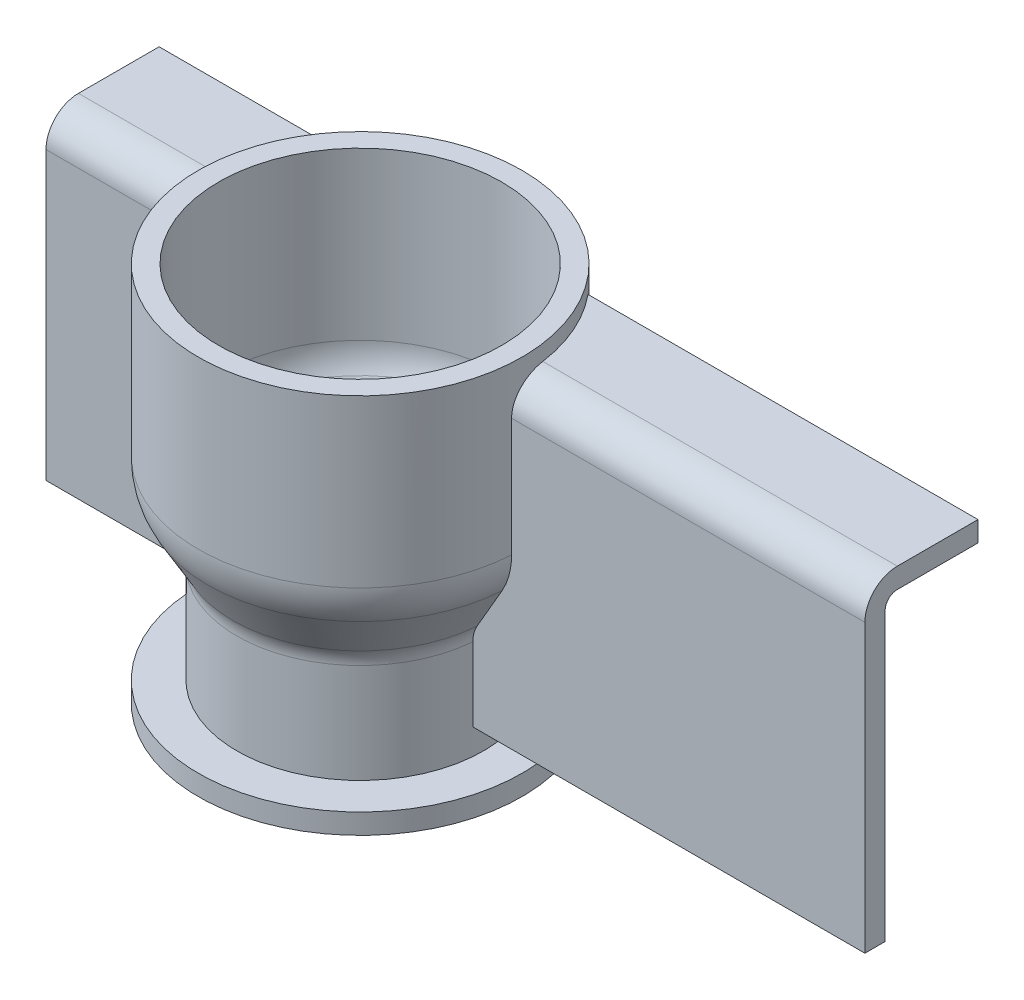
ISO-10303-21;
HEADER;
FILE_DESCRIPTION(('STEP AP214'),'2;1');
FILE_NAME('part.step','',(''),(''),'','','');
FILE_SCHEMA(('AUTOMOTIVE_DESIGN { 1 0 10303 214 1 1 1 1 }'));
ENDSEC;
DATA;
#1=APPLICATION_CONTEXT('core data for automotive mechanical design processes');
#2=APPLICATION_PROTOCOL_DEFINITION('international standard','automotive_design',2000,#1);
#3=PRODUCT_CONTEXT('',#1,'mechanical');
#4=PRODUCT('Part','Part','',(#3));
#5=PRODUCT_RELATED_PRODUCT_CATEGORY('part','',(#4));
#6=PRODUCT_DEFINITION_FORMATION('','',#4);
#7=PRODUCT_DEFINITION_CONTEXT('part definition',#1,'design');
#8=PRODUCT_DEFINITION('design','',#6,#7);
#9=PRODUCT_DEFINITION_SHAPE('','',#8);
#10=(LENGTH_UNIT() NAMED_UNIT(*) SI_UNIT(.MILLI.,.METRE.));
#11=(NAMED_UNIT(*) PLANE_ANGLE_UNIT() SI_UNIT($,.RADIAN.));
#12=(NAMED_UNIT(*) SI_UNIT($,.STERADIAN.) SOLID_ANGLE_UNIT());
#13=UNCERTAINTY_MEASURE_WITH_UNIT(LENGTH_MEASURE(1.E-05),#10,'distance_accuracy_value','');
#14=(GEOMETRIC_REPRESENTATION_CONTEXT(3) GLOBAL_UNCERTAINTY_ASSIGNED_CONTEXT((#13)) GLOBAL_UNIT_ASSIGNED_CONTEXT((#10,
#11,#12)) REPRESENTATION_CONTEXT('',''));
#15=CARTESIAN_POINT('',(0.,0.,0.));
#16=DIRECTION('',(0.,0.,1.));
#17=DIRECTION('',(1.,0.,0.));
#18=AXIS2_PLACEMENT_3D('',#15,#16,#17);
#19=CARTESIAN_POINT('',(0.,0.,0.));
#20=DIRECTION('',(0.,-1.,0.));
#21=DIRECTION('',(0.,0.,-1.));
#22=AXIS2_PLACEMENT_3D('',#19,#20,#21);
#23=CYLINDRICAL_SURFACE('',#22,30.4);
#24=CARTESIAN_POINT('',(0.,-88.9,0.));
#25=DIRECTION('',(0.,-1.,0.));
#26=DIRECTION('',(0.,0.,-1.));
#27=AXIS2_PLACEMENT_3D('',#24,#25,#26);
#28=CIRCLE('',#27,30.4);
#29=CARTESIAN_POINT('',(0.,-88.9,-30.4));
#30=VERTEX_POINT('',#29);
#31=EDGE_CURVE('E784',#30,#30,#28,.T.);
#32=ORIENTED_EDGE('',*,*,#31,.F.);
#33=EDGE_LOOP('',(#32));
#34=FACE_BOUND('',#33,.T.);
#35=DIRECTION('',(0.,-1.,0.));
#36=VECTOR('',#35,1.);
#37=CARTESIAN_POINT('',(-30.2970295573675,0.,2.5));
#38=LINE('',#37,#36);
#39=CARTESIAN_POINT('',(-30.2970295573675,-64.3507386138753,2.49999999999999));
#40=VERTEX_POINT('',#39);
#41=CARTESIAN_POINT('',(-30.2970295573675,-82.55,2.49999999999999));
#42=VERTEX_POINT('',#41);
#43=EDGE_CURVE('E53',#40,#42,#38,.T.);
#44=ORIENTED_EDGE('',*,*,#43,.T.);
#45=CARTESIAN_POINT('',(0.,-82.55,0.));
#46=DIRECTION('',(0.,1.,0.));
#47=DIRECTION('',(0.,0.,1.));
#48=AXIS2_PLACEMENT_3D('',#45,#46,#47);
#49=CIRCLE('',#48,30.4);
#50=CARTESIAN_POINT('',(-30.2970295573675,-82.55,-2.5));
#51=VERTEX_POINT('',#50);
#52=EDGE_CURVE('E59',#42,#51,#49,.F.);
#53=ORIENTED_EDGE('',*,*,#52,.T.);
#54=DIRECTION('',(0.,-1.,0.));
#55=VECTOR('',#54,1.);
#56=CARTESIAN_POINT('',(-30.2970295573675,0.,-2.5));
#57=LINE('',#56,#55);
#58=CARTESIAN_POINT('',(-30.2970295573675,-64.3507386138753,-2.50000000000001));
#59=VERTEX_POINT('',#58);
#60=EDGE_CURVE('E291',#51,#59,#57,.F.);
#61=ORIENTED_EDGE('',*,*,#60,.T.);
#62=CARTESIAN_POINT('',(0.,-64.3507386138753,0.));
#63=DIRECTION('',(0.,-1.,0.));
#64=DIRECTION('',(0.,0.,-1.));
#65=AXIS2_PLACEMENT_3D('',#62,#63,#64);
#66=CIRCLE('',#65,30.4);
#67=CARTESIAN_POINT('',(30.2970295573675,-64.3507386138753,-2.5));
#68=VERTEX_POINT('',#67);
#69=EDGE_CURVE('E48',#59,#68,#66,.T.);
#70=ORIENTED_EDGE('',*,*,#69,.T.);
#71=DIRECTION('',(0.,-1.,0.));
#72=VECTOR('',#71,1.);
#73=CARTESIAN_POINT('',(30.2970295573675,0.,-2.5));
#74=LINE('',#73,#72);
#75=CARTESIAN_POINT('',(30.2970295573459,-82.55,-2.50000000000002));
#76=VERTEX_POINT('',#75);
#77=EDGE_CURVE('E379',#76,#68,#74,.F.);
#78=ORIENTED_EDGE('',*,*,#77,.F.);
#79=CARTESIAN_POINT('',(0.,-82.55,0.));
#80=DIRECTION('',(0.,1.,0.));
#81=DIRECTION('',(0.,0.,1.));
#82=AXIS2_PLACEMENT_3D('',#79,#80,#81);
#83=CIRCLE('',#82,30.4);
#84=CARTESIAN_POINT('',(30.2970295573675,-82.55,2.49999999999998));
#85=VERTEX_POINT('',#84);
#86=EDGE_CURVE('E303',#76,#85,#83,.F.);
#87=ORIENTED_EDGE('',*,*,#86,.T.);
#88=DIRECTION('',(0.,-1.,0.));
#89=VECTOR('',#88,1.);
#90=CARTESIAN_POINT('',(30.2970295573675,0.,2.5));
#91=LINE('',#90,#89);
#92=CARTESIAN_POINT('',(30.2970295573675,-64.3507386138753,2.5));
#93=VERTEX_POINT('',#92);
#94=EDGE_CURVE('E370',#85,#93,#91,.F.);
#95=ORIENTED_EDGE('',*,*,#94,.T.);
#96=EDGE_CURVE('E11',#93,#40,#66,.T.);
#97=ORIENTED_EDGE('',*,*,#96,.T.);
#98=EDGE_LOOP('',(#44,#53,#61,#70,#78,#87,#95,#97));
#99=FACE_BOUND('',#98,.T.);
#100=ADVANCED_FACE('F41',(#34,#99),#23,.T.);
#101=CARTESIAN_POINT('',(0.,-64.3507386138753,0.));
#102=DIRECTION('',(0.,-1.,0.));
#103=DIRECTION('',(0.,0.,-1.));
#104=AXIS2_PLACEMENT_3D('',#101,#102,#103);
#105=TOROIDAL_SURFACE('',#104,38.1,7.7);
#106=CARTESIAN_POINT('',(-30.7196433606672,-61.8389467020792,2.49999999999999));
#107=CARTESIAN_POINT('',(-30.6490781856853,-62.0427552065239,2.49999999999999));
#108=CARTESIAN_POINT('',(-30.5871091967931,-62.2495120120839,2.49999999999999));
#109=CARTESIAN_POINT('',(-30.4807701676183,-62.6675742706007,2.49999999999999));
#110=CARTESIAN_POINT('',(-30.4364046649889,-62.8788808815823,2.49999999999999));
#111=CARTESIAN_POINT('',(-30.3655949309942,-63.3046608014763,2.49999999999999));
#112=CARTESIAN_POINT('',(-30.3391662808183,-63.5191366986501,2.49999999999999));
#113=CARTESIAN_POINT('',(-30.3044765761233,-63.9496326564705,2.49999999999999));
#114=CARTESIAN_POINT('',(-30.2962221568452,-64.165653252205,2.49999999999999));
#115=CARTESIAN_POINT('',(-30.2979608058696,-64.5974810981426,2.49999999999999));
#116=CARTESIAN_POINT('',(-30.3079420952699,-64.8132883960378,2.49999999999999));
#117=CARTESIAN_POINT('',(-30.3460564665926,-65.2432974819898,2.49999999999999));
#118=CARTESIAN_POINT('',(-30.3741898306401,-65.4574992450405,2.49999999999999));
#119=CARTESIAN_POINT('',(-30.4483938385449,-65.8827149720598,2.49999999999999));
#120=CARTESIAN_POINT('',(-30.4944597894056,-66.0937297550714,2.49999999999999));
#121=CARTESIAN_POINT('',(-30.6041955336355,-66.5111362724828,2.49999999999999));
#122=CARTESIAN_POINT('',(-30.667865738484,-66.7175278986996,2.49999999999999));
#123=CARTESIAN_POINT('',(-30.8123443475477,-67.1242118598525,2.49999999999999));
#124=CARTESIAN_POINT('',(-30.893151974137,-67.3245044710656,2.49999999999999));
#125=CARTESIAN_POINT('',(-31.0713537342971,-67.7176531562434,2.49999999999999));
#126=CARTESIAN_POINT('',(-31.1687535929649,-67.9105066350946,2.49999999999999));
#127=CARTESIAN_POINT('',(-31.3794039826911,-68.2873183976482,2.49999999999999));
#128=CARTESIAN_POINT('',(-31.4926523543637,-68.4712778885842,2.49999999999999));
#129=CARTESIAN_POINT('',(-31.7341990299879,-68.8290399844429,2.49999999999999));
#130=CARTESIAN_POINT('',(-31.8624976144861,-69.0028423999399,2.49999999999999));
#131=CARTESIAN_POINT('',(-32.1335331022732,-69.339449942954,2.49999999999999));
#132=CARTESIAN_POINT('',(-32.2763020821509,-69.502229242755,2.49999999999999));
#133=CARTESIAN_POINT('',(-32.5750174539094,-69.8152176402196,2.49999999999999));
#134=CARTESIAN_POINT('',(-32.7309641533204,-69.9654264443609,2.49999999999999));
#135=CARTESIAN_POINT('',(-33.0548927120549,-70.2521923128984,2.49999999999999));
#136=CARTESIAN_POINT('',(-33.2228724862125,-70.3887517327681,2.49999999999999));
#137=CARTESIAN_POINT('',(-33.5697583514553,-70.6473382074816,2.49999999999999));
#138=CARTESIAN_POINT('',(-33.7486682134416,-70.7693602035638,2.49999999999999));
#139=CARTESIAN_POINT('',(-34.1165801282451,-70.9982663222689,2.49999999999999));
#140=CARTESIAN_POINT('',(-34.3056076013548,-71.1051095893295,2.49999999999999));
#141=CARTESIAN_POINT('',(-34.6920479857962,-71.3025602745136,2.49999999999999));
#142=CARTESIAN_POINT('',(-34.8894639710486,-71.3931616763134,2.49999999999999));
#143=CARTESIAN_POINT('',(-35.2911781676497,-71.5574281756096,2.49999999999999));
#144=CARTESIAN_POINT('',(-35.4954751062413,-71.6310963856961,2.49999999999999));
#145=CARTESIAN_POINT('',(-35.9095415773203,-71.761000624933,2.49999999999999));
#146=CARTESIAN_POINT('',(-36.1193112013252,-71.8172363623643,2.49999999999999));
#147=CARTESIAN_POINT('',(-36.5432361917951,-71.9119669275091,2.49999999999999));
#148=CARTESIAN_POINT('',(-36.7573991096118,-71.9504279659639,2.49999999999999));
#149=CARTESIAN_POINT('',(-37.1882084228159,-72.0091787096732,2.49999999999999));
#150=CARTESIAN_POINT('',(-37.404854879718,-72.0294679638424,2.49999999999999));
#151=CARTESIAN_POINT('',(-37.8390476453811,-72.0517250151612,2.49999999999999));
#152=CARTESIAN_POINT('',(-38.0565937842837,-72.0536961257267,2.49999999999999));
#153=CARTESIAN_POINT('',(-38.4911544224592,-72.0393050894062,2.49999999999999));
#154=CARTESIAN_POINT('',(-38.7081687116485,-72.0229365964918,2.49999999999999));
#155=CARTESIAN_POINT('',(-39.1400449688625,-71.9719674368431,2.49999999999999));
#156=CARTESIAN_POINT('',(-39.3549069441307,-71.9373668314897,2.49999999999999));
#157=CARTESIAN_POINT('',(-39.7809519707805,-71.8501728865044,2.49999999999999));
#158=CARTESIAN_POINT('',(-39.9921349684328,-71.797579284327,2.49999999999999));
#159=CARTESIAN_POINT('',(-40.4093080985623,-71.6747685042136,2.49999999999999));
#160=CARTESIAN_POINT('',(-40.615298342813,-71.6045517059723,2.49999999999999));
#161=CARTESIAN_POINT('',(-41.0206239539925,-71.4469854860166,2.49999999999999));
#162=CARTESIAN_POINT('',(-41.2199591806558,-71.3596357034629,2.49999999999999));
#163=CARTESIAN_POINT('',(-41.6102809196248,-71.1685493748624,2.49999999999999));
#164=CARTESIAN_POINT('',(-41.8012783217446,-71.0648350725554,2.49999999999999));
#165=CARTESIAN_POINT('',(-42.173909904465,-70.8416279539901,2.49999999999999));
#166=CARTESIAN_POINT('',(-42.35554081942,-70.7221296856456,2.49999999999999));
#167=CARTESIAN_POINT('',(-42.7080348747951,-70.4682518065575,2.49999999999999));
#168=CARTESIAN_POINT('',(-42.8789000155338,-70.3338749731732,2.49999999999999));
#169=CARTESIAN_POINT('',(-43.2086769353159,-70.0511727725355,2.49999999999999));
#170=CARTESIAN_POINT('',(-43.367588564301,-69.9028472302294,2.49999999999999));
#171=CARTESIAN_POINT('',(-43.6720488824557,-69.5935739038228,2.49999999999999));
#172=CARTESIAN_POINT('',(-43.8176204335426,-69.432648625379,2.49999999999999));
#173=CARTESIAN_POINT('',(-44.0946732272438,-69.0990883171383,2.49999999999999));
#174=CARTESIAN_POINT('',(-44.2261541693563,-68.9264530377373,2.49999999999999));
#175=CARTESIAN_POINT('',(-44.474050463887,-68.5707441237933,2.49999999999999));
#176=CARTESIAN_POINT('',(-44.5904692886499,-68.387672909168,2.49999999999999));
#177=CARTESIAN_POINT('',(-44.80748774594,-68.0122784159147,2.49999999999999));
#178=CARTESIAN_POINT('',(-44.9080806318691,-67.8199512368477,2.49999999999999));
#179=CARTESIAN_POINT('',(-45.0925152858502,-67.4278052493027,2.49999999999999));
#180=CARTESIAN_POINT('',(-45.1763838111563,-67.2279990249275,2.49999999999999));
#181=CARTESIAN_POINT('',(-45.3269386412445,-66.8221117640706,2.49999999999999));
#182=CARTESIAN_POINT('',(-45.3936322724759,-66.6160334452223,2.49999999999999));
#183=CARTESIAN_POINT('',(-45.5094185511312,-66.1989413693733,2.49999999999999));
#184=CARTESIAN_POINT('',(-45.5585073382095,-65.9879265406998,2.49999999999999));
#185=CARTESIAN_POINT('',(-45.6387102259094,-65.5625130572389,2.49999999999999));
#186=CARTESIAN_POINT('',(-45.669824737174,-65.3481144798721,2.49999999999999));
#187=CARTESIAN_POINT('',(-45.7138345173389,-64.9176808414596,2.49999999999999));
#188=CARTESIAN_POINT('',(-45.7267486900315,-64.7016477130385,2.49999999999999));
#189=CARTESIAN_POINT('',(-45.7343259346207,-64.2692647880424,2.49999999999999));
#190=CARTESIAN_POINT('',(-45.7289892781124,-64.0529149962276,2.49999999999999));
#191=CARTESIAN_POINT('',(-45.7001011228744,-63.6213963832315,2.49999999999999));
#192=CARTESIAN_POINT('',(-45.676546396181,-63.4062277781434,2.49999999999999));
#193=CARTESIAN_POINT('',(-45.6113983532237,-62.9787152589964,2.49999999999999));
#194=CARTESIAN_POINT('',(-45.5698112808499,-62.7663703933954,2.49999999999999));
#195=CARTESIAN_POINT('',(-45.4689025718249,-62.3459594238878,2.49999999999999));
#196=CARTESIAN_POINT('',(-45.4095826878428,-62.1378928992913,2.49999999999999));
#197=CARTESIAN_POINT('',(-45.2736329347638,-61.727499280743,2.49999999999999));
#198=CARTESIAN_POINT('',(-45.1970034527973,-61.5251720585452,2.49999999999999));
#199=CARTESIAN_POINT('',(-45.0269801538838,-61.1276840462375,2.49999999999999));
#200=CARTESIAN_POINT('',(-44.9335860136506,-60.9325233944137,2.49999999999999));
#201=CARTESIAN_POINT('',(-44.7307033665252,-60.5507589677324,2.49999999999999));
#202=CARTESIAN_POINT('',(-44.6212150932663,-60.3641550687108,2.49999999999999));
#203=CARTESIAN_POINT('',(-44.3868400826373,-60.0006908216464,2.49999999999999));
#204=CARTESIAN_POINT('',(-44.2619422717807,-59.8238376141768,2.49999999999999));
#205=CARTESIAN_POINT('',(-43.9977485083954,-59.4813317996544,2.49999999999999));
#206=CARTESIAN_POINT('',(-43.8584575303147,-59.3156753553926,2.49999999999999));
#207=CARTESIAN_POINT('',(-43.5664076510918,-58.9966367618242,2.49999999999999));
#208=CARTESIAN_POINT('',(-43.4136462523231,-58.8432568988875,2.49999999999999));
#209=CARTESIAN_POINT('',(-43.0957692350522,-58.5498907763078,2.49999999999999));
#210=CARTESIAN_POINT('',(-42.9306538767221,-58.4099042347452,2.49999999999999));
#211=CARTESIAN_POINT('',(-42.5890210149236,-58.1441357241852,2.49999999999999));
#212=CARTESIAN_POINT('',(-42.4124891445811,-58.0183722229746,2.49999999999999));
#213=CARTESIAN_POINT('',(-42.0494734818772,-57.7821445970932,2.49999999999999));
#214=CARTESIAN_POINT('',(-41.8629898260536,-57.6716802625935,2.49999999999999));
#215=CARTESIAN_POINT('',(-41.481358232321,-57.4668053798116,2.49999999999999));
#216=CARTESIAN_POINT('',(-41.2862086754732,-57.3723978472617,2.49999999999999));
#217=CARTESIAN_POINT('',(-40.8887322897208,-57.2003528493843,2.49999999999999));
#218=CARTESIAN_POINT('',(-40.6864079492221,-57.1227096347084,2.49999999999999));
#219=CARTESIAN_POINT('',(-40.2755639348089,-56.9845633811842,2.49999999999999));
#220=CARTESIAN_POINT('',(-40.0670332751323,-56.9240930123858,2.49999999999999));
#221=CARTESIAN_POINT('',(-39.6456289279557,-56.820911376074,2.49999999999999));
#222=CARTESIAN_POINT('',(-39.4327553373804,-56.7781997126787,2.49999999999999));
#223=CARTESIAN_POINT('',(-39.0041642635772,-56.7108286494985,2.49999999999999));
#224=CARTESIAN_POINT('',(-38.7884466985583,-56.6861697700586,2.49999999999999));
#225=CARTESIAN_POINT('',(-38.3557054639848,-56.6550754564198,2.49999999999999));
#226=CARTESIAN_POINT('',(-38.1386818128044,-56.6486397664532,2.49999999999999));
#227=CARTESIAN_POINT('',(-37.7044607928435,-56.6540371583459,2.49999999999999));
#228=CARTESIAN_POINT('',(-37.4872638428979,-56.6659039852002,2.49999999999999));
#229=CARTESIAN_POINT('',(-37.0547198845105,-56.7078738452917,2.49999999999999));
#230=CARTESIAN_POINT('',(-36.8393722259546,-56.7379701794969,2.49999999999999));
#231=CARTESIAN_POINT('',(-36.4119039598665,-56.8161911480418,2.49999999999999));
#232=CARTESIAN_POINT('',(-36.1997844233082,-56.8643216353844,2.49999999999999));
#233=CARTESIAN_POINT('',(-35.7804227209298,-56.9782488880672,2.49999999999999));
#234=CARTESIAN_POINT('',(-35.5731788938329,-57.0440395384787,2.49999999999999));
#235=CARTESIAN_POINT('',(-35.1647785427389,-57.1928977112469,2.49999999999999));
#236=CARTESIAN_POINT('',(-34.9636277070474,-57.275980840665,2.49999999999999));
#237=CARTESIAN_POINT('',(-34.5690465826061,-57.4587990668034,2.49999999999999));
#238=CARTESIAN_POINT('',(-34.3756161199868,-57.5585337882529,2.49999999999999));
#239=CARTESIAN_POINT('',(-33.997799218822,-57.7739820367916,2.49999999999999));
#240=CARTESIAN_POINT('',(-33.8134152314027,-57.8896998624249,2.49999999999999));
#241=CARTESIAN_POINT('',(-33.455068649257,-58.1362747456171,2.49999999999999));
#242=CARTESIAN_POINT('',(-33.2811058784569,-58.267131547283,2.49999999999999));
#243=CARTESIAN_POINT('',(-32.9448522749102,-58.543056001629,2.49999999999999));
#244=CARTESIAN_POINT('',(-32.7825609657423,-58.6881230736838,2.49999999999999));
#245=CARTESIAN_POINT('',(-32.4708676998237,-58.9913888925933,2.49999999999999));
#246=CARTESIAN_POINT('',(-32.3214610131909,-59.1495827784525,2.49999999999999));
#247=CARTESIAN_POINT('',(-32.0366739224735,-59.4778838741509,2.49999999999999));
#248=CARTESIAN_POINT('',(-31.9012810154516,-59.6479802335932,2.49999999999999));
#249=CARTESIAN_POINT('',(-31.6453882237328,-59.9989437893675,2.49999999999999));
#250=CARTESIAN_POINT('',(-31.5248844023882,-60.1798081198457,2.49999999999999));
#251=CARTESIAN_POINT('',(-31.2712110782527,-60.5978653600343,2.49999999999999));
#252=CARTESIAN_POINT('',(-31.1424910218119,-60.8377756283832,2.49999999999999));
#253=CARTESIAN_POINT('',(-30.9111766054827,-61.3298783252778,2.49999999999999));
#254=CARTESIAN_POINT('',(-30.808582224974,-61.5820707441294,2.49999999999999));
#255=CARTESIAN_POINT('',(-30.7196433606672,-61.8389467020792,2.49999999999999));
#256=B_SPLINE_CURVE_WITH_KNOTS('',3,(#106,#107,#108,#109,#110,#111,#112,#113,#114,#115,#116,
#117,#118,#119,#120,#121,#122,#123,#124,#125,#126,#127,#128,#129,#130,#131,#132,#133,#134,#135,
#136,#137,#138,#139,#140,#141,#142,#143,#144,#145,#146,#147,#148,#149,#150,#151,#152,#153,#154,
#155,#156,#157,#158,#159,#160,#161,#162,#163,#164,#165,#166,#167,#168,#169,#170,#171,#172,#173,
#174,#175,#176,#177,#178,#179,#180,#181,#182,#183,#184,#185,#186,#187,#188,#189,#190,#191,#192,
#193,#194,#195,#196,#197,#198,#199,#200,#201,#202,#203,#204,#205,#206,#207,#208,#209,#210,#211,
#212,#213,#214,#215,#216,#217,#218,#219,#220,#221,#222,#223,#224,#225,#226,#227,#228,#229,#230,
#231,#232,#233,#234,#235,#236,#237,#238,#239,#240,#241,#242,#243,#244,#245,#246,#247,#248,#249,
#250,#251,#252,#253,#254,#255),.UNSPECIFIED.,.T.,.F.,(4,2,2,2,2,2,2,2,2,2,2,2,2,2,2,2,2,2,2,2,2,
2,2,2,2,2,2,2,2,2,2,2,2,2,2,2,2,2,2,2,2,2,2,2,2,2,2,2,2,2,2,2,2,2,2,2,2,2,2,2,2,2,2,2,2,2,2,2,2,
2,2,2,2,2,4),(0.,0.64679958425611,1.29376578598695,1.94129327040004,2.58905712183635,
3.2364027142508,3.8837583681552,4.53094472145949,5.17814620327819,5.82531832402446,
6.47271420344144,7.12002195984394,7.76734178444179,8.41612928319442,9.06493192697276,
9.71362241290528,10.3625379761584,11.013168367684,11.6640392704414,12.3147904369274,
12.965552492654,13.6175465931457,14.2695568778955,14.9214492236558,15.5735672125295,
16.2256830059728,16.8778083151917,17.5299195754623,18.1820445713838,18.8332906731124,
19.4847623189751,20.1361125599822,20.7874709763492,21.4376913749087,22.0879256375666,
22.7380097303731,23.3883702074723,24.0376816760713,24.686715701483,25.3358919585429,
25.9850533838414,26.6335400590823,27.2820170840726,27.930609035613,28.578976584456,
29.2272800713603,29.8755690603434,30.5238705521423,31.172162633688,31.8209233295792,
32.4694605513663,33.1181182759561,33.7667623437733,34.4162391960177,35.0657071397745,
35.71529692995,36.3646635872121,37.0152574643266,37.6658368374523,38.3164349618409,
38.9670239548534,39.6188138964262,40.27036446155,40.9221266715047,41.5736634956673,
42.2257909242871,42.8779036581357,43.5301921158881,44.1824695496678,44.8347203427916,
45.4867306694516,46.1381541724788,46.7894050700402,47.6046183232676,48.4198309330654),.UNSPECIFIED.);
#257=CARTESIAN_POINT('',(-31.332024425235,-60.5007386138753,2.49999999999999));
#258=VERTEX_POINT('',#257);
#259=EDGE_CURVE('E276',#258,#40,#256,.T.);
#260=ORIENTED_EDGE('',*,*,#259,.T.);
#261=ORIENTED_EDGE('',*,*,#96,.F.);
#262=CARTESIAN_POINT('',(30.4863395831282,-62.6566420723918,2.49999999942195));
#263=CARTESIAN_POINT('',(30.5340498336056,-62.4458040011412,2.49999999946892));
#264=CARTESIAN_POINT('',(30.5906647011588,-62.2370063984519,2.49999999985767));
#265=CARTESIAN_POINT('',(30.7213159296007,-61.8248596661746,2.50000000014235));
#266=CARTESIAN_POINT('',(30.7953569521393,-61.6215120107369,2.50000000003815));
#267=CARTESIAN_POINT('',(30.9603871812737,-61.2216021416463,2.49999999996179));
#268=CARTESIAN_POINT('',(31.0513917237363,-61.0250462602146,2.49999999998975));
#269=CARTESIAN_POINT('',(31.2496813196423,-60.640233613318,2.50000000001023));
#270=CARTESIAN_POINT('',(31.3569723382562,-60.4519799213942,2.50000000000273));
#271=CARTESIAN_POINT('',(31.5869423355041,-60.0853288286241,2.49999999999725));
#272=CARTESIAN_POINT('',(31.7096089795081,-59.9069236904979,2.49999999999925));
#273=CARTESIAN_POINT('',(31.9695173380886,-59.5610619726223,2.50000000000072));
#274=CARTESIAN_POINT('',(32.1067593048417,-59.3936055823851,2.50000000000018));
#275=CARTESIAN_POINT('',(32.3947947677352,-59.0708652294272,2.49999999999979));
#276=CARTESIAN_POINT('',(32.5455846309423,-58.9155780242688,2.49999999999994));
#277=CARTESIAN_POINT('',(32.8596754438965,-58.6182110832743,2.50000000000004));
#278=CARTESIAN_POINT('',(33.0229767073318,-58.4761316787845,2.5));
#279=CARTESIAN_POINT('',(33.3612821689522,-58.2058944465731,2.49999999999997));
#280=CARTESIAN_POINT('',(33.5363102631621,-58.0777665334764,2.49999999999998));
#281=CARTESIAN_POINT('',(33.8965782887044,-57.8366334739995,2.49999999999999));
#282=CARTESIAN_POINT('',(34.0818217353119,-57.7236335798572,2.49999999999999));
#283=CARTESIAN_POINT('',(34.4611248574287,-57.5136150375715,2.49999999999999));
#284=CARTESIAN_POINT('',(34.6551833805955,-57.4165943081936,2.49999999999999));
#285=CARTESIAN_POINT('',(35.0507674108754,-57.239195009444,2.49999999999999));
#286=CARTESIAN_POINT('',(35.2522930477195,-57.1588167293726,2.49999999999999));
#287=CARTESIAN_POINT('',(35.6618733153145,-57.0150963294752,2.49999999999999));
#288=CARTESIAN_POINT('',(35.869942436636,-56.9517955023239,2.49999999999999));
#289=CARTESIAN_POINT('',(36.2906753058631,-56.8429308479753,2.49999999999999));
#290=CARTESIAN_POINT('',(36.5033391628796,-56.797367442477,2.49999999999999));
#291=CARTESIAN_POINT('',(36.9317087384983,-56.7243095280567,2.49999999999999));
#292=CARTESIAN_POINT('',(37.1474139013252,-56.6968117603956,2.49999999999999));
#293=CARTESIAN_POINT('',(37.5804483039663,-56.6600624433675,2.49999999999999));
#294=CARTESIAN_POINT('',(37.7977780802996,-56.6508172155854,2.49999999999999));
#295=CARTESIAN_POINT('',(38.232574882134,-56.650660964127,2.49999999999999));
#296=CARTESIAN_POINT('',(38.450041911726,-56.6597609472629,2.49999999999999));
#297=CARTESIAN_POINT('',(38.8834386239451,-56.6962574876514,2.49999999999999));
#298=CARTESIAN_POINT('',(39.0993682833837,-56.7236543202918,2.49999999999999));
#299=CARTESIAN_POINT('',(39.5281445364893,-56.7965549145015,2.49999999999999));
#300=CARTESIAN_POINT('',(39.740991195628,-56.8420582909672,2.49999999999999));
#301=CARTESIAN_POINT('',(40.1620930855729,-56.9508557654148,2.49999999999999));
#302=CARTESIAN_POINT('',(40.3703482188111,-57.0141502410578,2.49999999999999));
#303=CARTESIAN_POINT('',(40.7805778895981,-57.1580161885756,2.49999999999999));
#304=CARTESIAN_POINT('',(40.9825582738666,-57.2385709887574,2.49999999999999));
#305=CARTESIAN_POINT('',(41.379075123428,-57.4164581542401,2.49999999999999));
#306=CARTESIAN_POINT('',(41.5736089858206,-57.5137963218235,2.49999999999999));
#307=CARTESIAN_POINT('',(41.9537322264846,-57.7245245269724,2.49999999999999));
#308=CARTESIAN_POINT('',(42.1393232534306,-57.8379115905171,2.49999999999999));
#309=CARTESIAN_POINT('',(42.5002731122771,-58.0799508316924,2.49999999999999));
#310=CARTESIAN_POINT('',(42.6756318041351,-58.208603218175,2.49999999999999));
#311=CARTESIAN_POINT('',(43.0145784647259,-58.4800365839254,2.49999999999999));
#312=CARTESIAN_POINT('',(43.1781852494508,-58.6227940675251,2.49999999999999));
#313=CARTESIAN_POINT('',(43.4927763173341,-58.9216052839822,2.49999999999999));
#314=CARTESIAN_POINT('',(43.6437603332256,-59.0776592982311,2.49999999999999));
#315=CARTESIAN_POINT('',(43.931991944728,-59.4019218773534,2.49999999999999));
#316=CARTESIAN_POINT('',(44.0692421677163,-59.5701281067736,2.49999999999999));
#317=CARTESIAN_POINT('',(44.3290994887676,-59.917586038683,2.49999999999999));
#318=CARTESIAN_POINT('',(44.4517015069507,-60.0968415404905,2.49999999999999));
#319=CARTESIAN_POINT('',(44.6811079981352,-60.4647184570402,2.49999999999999));
#320=CARTESIAN_POINT('',(44.7879419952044,-60.6533214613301,2.49999999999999));
#321=CARTESIAN_POINT('',(44.985325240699,-61.0388682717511,2.49999999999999));
#322=CARTESIAN_POINT('',(45.0758742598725,-61.2358121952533,2.49999999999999));
#323=CARTESIAN_POINT('',(45.2400339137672,-61.636631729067,2.49999999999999));
#324=CARTESIAN_POINT('',(45.3136449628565,-61.8405071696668,2.49999999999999));
#325=CARTESIAN_POINT('',(45.4434045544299,-62.2537462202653,2.49999999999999));
#326=CARTESIAN_POINT('',(45.4995527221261,-62.4631099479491,2.49999999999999));
#327=CARTESIAN_POINT('',(45.5939111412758,-62.8855186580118,2.49999999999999));
#328=CARTESIAN_POINT('',(45.6321476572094,-63.0985577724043,2.49999999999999));
#329=CARTESIAN_POINT('',(45.6905423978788,-63.5271711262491,2.49999999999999));
#330=CARTESIAN_POINT('',(45.710694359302,-63.7427462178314,2.49999999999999));
#331=CARTESIAN_POINT('',(45.7327434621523,-64.1747630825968,2.49999999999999));
#332=CARTESIAN_POINT('',(45.7346472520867,-64.3912045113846,2.49999999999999));
#333=CARTESIAN_POINT('',(45.7202206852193,-64.823506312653,2.49999999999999));
#334=CARTESIAN_POINT('',(45.7038835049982,-65.0393664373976,2.49999999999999));
#335=CARTESIAN_POINT('',(45.6276533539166,-65.6833160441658,2.49999999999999));
#336=CARTESIAN_POINT('',(45.540577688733,-66.108493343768,2.49999999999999));
#337=CARTESIAN_POINT('',(45.2961999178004,-66.9381607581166,2.49999999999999));
#338=CARTESIAN_POINT('',(45.1388978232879,-67.3426508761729,2.49999999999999));
#339=CARTESIAN_POINT('',(44.8539556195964,-67.9250617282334,2.49999999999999));
#340=CARTESIAN_POINT('',(44.7507249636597,-68.1152631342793,2.49999999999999));
#341=CARTESIAN_POINT('',(44.5286386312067,-68.4862812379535,2.49999999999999));
#342=CARTESIAN_POINT('',(44.4097887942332,-68.6671014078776,2.49999999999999));
#343=CARTESIAN_POINT('',(44.1572564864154,-69.0181506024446,2.49999999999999));
#344=CARTESIAN_POINT('',(44.0235686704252,-69.1883757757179,2.49999999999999));
#345=CARTESIAN_POINT('',(43.7423923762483,-69.5169215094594,2.49999999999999));
#346=CARTESIAN_POINT('',(43.5949086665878,-69.675246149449,2.49999999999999));
#347=CARTESIAN_POINT('',(43.2869651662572,-69.9791197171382,2.49999999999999));
#348=CARTESIAN_POINT('',(43.1264897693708,-70.1246528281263,2.49999999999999));
#349=CARTESIAN_POINT('',(42.7938668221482,-70.4016975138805,2.49999999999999));
#350=CARTESIAN_POINT('',(42.6217195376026,-70.5332094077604,2.49999999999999));
#351=CARTESIAN_POINT('',(42.2669703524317,-70.7812924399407,2.49999999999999));
#352=CARTESIAN_POINT('',(42.0843681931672,-70.8978632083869,2.49999999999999));
#353=CARTESIAN_POINT('',(41.7100135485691,-71.1152400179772,2.49999999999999));
#354=CARTESIAN_POINT('',(41.5182611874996,-71.2160462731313,2.49999999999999));
#355=CARTESIAN_POINT('',(41.1266137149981,-71.4013558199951,2.49999999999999));
#356=CARTESIAN_POINT('',(40.9267046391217,-71.4858295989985,2.49999999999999));
#357=CARTESIAN_POINT('',(40.5205625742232,-71.6376294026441,2.49999999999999));
#358=CARTESIAN_POINT('',(40.3143319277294,-71.7049616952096,2.49999999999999));
#359=CARTESIAN_POINT('',(39.8968642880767,-71.8220705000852,2.49999999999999));
#360=CARTESIAN_POINT('',(39.6856255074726,-71.8718406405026,2.49999999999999));
#361=CARTESIAN_POINT('',(39.2597851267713,-71.9534313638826,2.49999999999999));
#362=CARTESIAN_POINT('',(39.0451847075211,-71.9852581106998,2.49999999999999));
#363=CARTESIAN_POINT('',(38.6136547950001,-72.0308130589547,2.49999999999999));
#364=CARTESIAN_POINT('',(38.3967216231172,-72.0445064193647,2.49999999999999));
#365=CARTESIAN_POINT('',(37.9624775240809,-72.0535889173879,2.49999999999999));
#366=CARTESIAN_POINT('',(37.7451666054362,-72.0489784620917,2.49999999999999));
#367=CARTESIAN_POINT('',(37.3116969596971,-72.0214902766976,2.49999999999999));
#368=CARTESIAN_POINT('',(37.0955382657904,-71.998612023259,2.49999999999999));
#369=CARTESIAN_POINT('',(36.6659151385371,-71.9347524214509,2.49999999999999));
#370=CARTESIAN_POINT('',(36.4524506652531,-71.8937713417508,2.49999999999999));
#371=CARTESIAN_POINT('',(36.0294313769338,-71.7939274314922,2.49999999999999));
#372=CARTESIAN_POINT('',(35.819882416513,-71.7350397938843,2.49999999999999));
#373=CARTESIAN_POINT('',(35.4065669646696,-71.5998446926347,2.49999999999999));
#374=CARTESIAN_POINT('',(35.2027983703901,-71.5235436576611,2.49999999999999));
#375=CARTESIAN_POINT('',(34.8023394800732,-71.3540174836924,2.49999999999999));
#376=CARTESIAN_POINT('',(34.6056517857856,-71.2607861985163,2.49999999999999));
#377=CARTESIAN_POINT('',(34.2209018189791,-71.0581113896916,2.49999999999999));
#378=CARTESIAN_POINT('',(34.0328365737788,-70.9486735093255,2.49999999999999));
#379=CARTESIAN_POINT('',(33.6665842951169,-70.7143227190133,2.49999999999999));
#380=CARTESIAN_POINT('',(33.4883981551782,-70.5894084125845,2.49999999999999));
#381=CARTESIAN_POINT('',(33.143201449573,-70.3249971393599,2.49999999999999));
#382=CARTESIAN_POINT('',(32.9761906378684,-70.1855004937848,2.49999999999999));
#383=CARTESIAN_POINT('',(32.6545430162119,-69.8929117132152,2.49999999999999));
#384=CARTESIAN_POINT('',(32.4999059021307,-69.739819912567,2.49999999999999));
#385=CARTESIAN_POINT('',(32.2041175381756,-69.4211246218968,2.49999999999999));
#386=CARTESIAN_POINT('',(32.0629660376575,-69.2555213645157,2.49999999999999));
#387=CARTESIAN_POINT('',(31.7954047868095,-68.9132811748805,2.49999999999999));
#388=CARTESIAN_POINT('',(31.6689692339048,-68.7366644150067,2.49999999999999));
#389=CARTESIAN_POINT('',(31.4315056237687,-68.3734481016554,2.49999999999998));
#390=CARTESIAN_POINT('',(31.3204721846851,-68.1868520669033,2.49999999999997));
#391=CARTESIAN_POINT('',(31.1145229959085,-67.8048660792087,2.5));
#392=CARTESIAN_POINT('',(31.0196140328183,-67.6094724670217,2.50000000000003));
#393=CARTESIAN_POINT('',(30.846664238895,-67.2113611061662,2.49999999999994));
#394=CARTESIAN_POINT('',(30.7686231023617,-67.0086434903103,2.49999999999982));
#395=CARTESIAN_POINT('',(30.6301514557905,-66.5978448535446,2.50000000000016));
#396=CARTESIAN_POINT('',(30.5696773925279,-66.389778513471,2.50000000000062));
#397=CARTESIAN_POINT('',(30.4665214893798,-65.9692847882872,2.49999999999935));
#398=CARTESIAN_POINT('',(30.4238393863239,-65.7568574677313,2.49999999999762));
#399=CARTESIAN_POINT('',(30.3566158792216,-65.329385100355,2.50000000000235));
#400=CARTESIAN_POINT('',(30.3320547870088,-65.114343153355,2.50000000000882));
#401=CARTESIAN_POINT('',(30.3011791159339,-64.6830240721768,2.49999999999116));
#402=CARTESIAN_POINT('',(30.2948596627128,-64.4667472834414,2.49999999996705));
#403=CARTESIAN_POINT('',(30.3011833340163,-63.9826150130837,2.50000000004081));
#404=CARTESIAN_POINT('',(30.3187297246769,-63.7148103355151,2.50000000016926));
#405=CARTESIAN_POINT('',(30.3817360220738,-63.1825059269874,2.49999999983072));
#406=CARTESIAN_POINT('',(30.4271958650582,-62.9180061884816,2.49999999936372));
#407=CARTESIAN_POINT('',(30.4863395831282,-62.6566420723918,2.49999999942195));
#408=B_SPLINE_CURVE_WITH_KNOTS('',3,(#262,#263,#264,#265,#266,#267,#268,#269,#270,#271,#272,
#273,#274,#275,#276,#277,#278,#279,#280,#281,#282,#283,#284,#285,#286,#287,#288,#289,#290,#291,
#292,#293,#294,#295,#296,#297,#298,#299,#300,#301,#302,#303,#304,#305,#306,#307,#308,#309,#310,
#311,#312,#313,#314,#315,#316,#317,#318,#319,#320,#321,#322,#323,#324,#325,#326,#327,#328,#329,
#330,#331,#332,#333,#334,#335,#336,#337,#338,#339,#340,#341,#342,#343,#344,#345,#346,#347,#348,
#349,#350,#351,#352,#353,#354,#355,#356,#357,#358,#359,#360,#361,#362,#363,#364,#365,#366,#367,
#368,#369,#370,#371,#372,#373,#374,#375,#376,#377,#378,#379,#380,#381,#382,#383,#384,#385,#386,
#387,#388,#389,#390,#391,#392,#393,#394,#395,#396,#397,#398,#399,#400,#401,#402,#403,#404,#405,
#406,#407),.UNSPECIFIED.,.T.,.F.,(4,2,2,2,2,2,2,2,2,2,2,2,2,2,2,2,2,2,2,2,2,2,2,2,2,2,2,2,2,2,2,
2,2,2,2,2,2,2,2,2,2,2,2,2,2,2,2,2,2,2,2,2,2,2,2,2,2,2,2,2,2,2,2,2,2,2,2,2,2,2,2,2,4),(0.,
0.648271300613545,1.29671621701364,1.94575022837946,2.5950225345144,3.2437772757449,
3.89254324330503,4.54113575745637,5.18974453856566,5.83971775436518,6.48991604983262,
7.14002959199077,7.79015443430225,8.44183744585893,9.09353594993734,9.74511686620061,
10.3969234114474,11.0491211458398,11.701328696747,12.3535223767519,13.0057299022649,
13.6573102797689,14.3091163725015,14.9608018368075,15.6124962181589,16.2631227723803,
16.9137630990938,17.5642787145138,18.215019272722,18.8645254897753,19.5140408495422,
20.163540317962,20.8130537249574,21.4616117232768,22.1103942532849,22.7589403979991,
23.4077292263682,24.7031759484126,25.9986224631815,26.6472099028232,27.2955555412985,
27.9441354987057,28.5924920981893,29.2416394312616,29.890771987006,30.5399206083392,
31.1890604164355,31.8393624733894,32.4894263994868,33.1397259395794,33.7898019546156,
34.4411252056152,35.092433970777,35.7437613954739,36.3950791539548,37.0473033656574,
37.6992871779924,38.3515081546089,39.0035025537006,39.6555558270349,40.3075947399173,
40.9596176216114,41.611628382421,42.2624781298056,42.9130998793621,43.5639947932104,
44.214877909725,44.8641332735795,45.5133790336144,46.1619183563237,46.810284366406,
47.6139117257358,48.4175372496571),.UNSPECIFIED.);
#409=CARTESIAN_POINT('',(31.332024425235,-60.5007386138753,2.49999999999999));
#410=VERTEX_POINT('',#409);
#411=EDGE_CURVE('E363',#93,#410,#408,.T.);
#412=ORIENTED_EDGE('',*,*,#411,.T.);
#413=CARTESIAN_POINT('',(0.,-60.5007386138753,0.));
#414=DIRECTION('',(0.,-1.,0.));
#415=DIRECTION('',(0.,0.,-1.));
#416=AXIS2_PLACEMENT_3D('',#413,#414,#415);
#417=CIRCLE('',#416,31.4316043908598);
#418=EDGE_CURVE('E450',#410,#258,#417,.T.);
#419=ORIENTED_EDGE('',*,*,#418,.T.);
#420=EDGE_LOOP('',(#260,#261,#412,#419));
#421=FACE_BOUND('',#420,.T.);
#422=ADVANCED_FACE('F432',(#421),#105,.F.);
#423=CARTESIAN_POINT('',(-30.7196433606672,-61.8389467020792,-2.50000000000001));
#424=CARTESIAN_POINT('',(-30.7904332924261,-61.6344794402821,-2.50000000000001));
#425=CARTESIAN_POINT('',(-30.8698581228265,-61.4330277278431,-2.50000000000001));
#426=CARTESIAN_POINT('',(-31.0454377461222,-61.0374728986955,-2.50000000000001));
#427=CARTESIAN_POINT('',(-31.1415970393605,-60.8433717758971,-2.50000000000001));
#428=CARTESIAN_POINT('',(-31.3500255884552,-60.463793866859,-2.50000000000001));
#429=CARTESIAN_POINT('',(-31.4623095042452,-60.2783251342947,-2.50000000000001));
#430=CARTESIAN_POINT('',(-31.7021542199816,-59.9174446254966,-2.50000000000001));
#431=CARTESIAN_POINT('',(-31.8297206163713,-59.7420365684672,-2.50000000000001));
#432=CARTESIAN_POINT('',(-32.0990692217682,-59.4027283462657,-2.50000000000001));
#433=CARTESIAN_POINT('',(-32.2408399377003,-59.2388190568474,-2.50000000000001));
#434=CARTESIAN_POINT('',(-32.5376687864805,-58.9235041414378,-2.50000000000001));
#435=CARTESIAN_POINT('',(-32.692727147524,-58.7720987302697,-2.50000000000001));
#436=CARTESIAN_POINT('',(-33.0149782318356,-58.4828969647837,-2.50000000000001));
#437=CARTESIAN_POINT('',(-33.1821676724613,-58.3450969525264,-2.50000000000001));
#438=CARTESIAN_POINT('',(-33.527532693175,-58.0840216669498,-2.50000000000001));
#439=CARTESIAN_POINT('',(-33.7057085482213,-57.9607467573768,-2.50000000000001));
#440=CARTESIAN_POINT('',(-34.0721631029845,-57.7293455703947,-2.50000000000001));
#441=CARTESIAN_POINT('',(-34.260462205,-57.6212516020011,-2.50000000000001));
#442=CARTESIAN_POINT('',(-34.6455486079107,-57.4212439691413,-2.50000000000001));
#443=CARTESIAN_POINT('',(-34.8423388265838,-57.3293359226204,-2.50000000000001));
#444=CARTESIAN_POINT('',(-35.2429238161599,-57.1624028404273,-2.50000000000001));
#445=CARTESIAN_POINT('',(-35.4467176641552,-57.0873755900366,-2.50000000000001));
#446=CARTESIAN_POINT('',(-35.8598938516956,-56.9547153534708,-2.50000000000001));
#447=CARTESIAN_POINT('',(-36.0692762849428,-56.8970826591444,-2.50000000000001));
#448=CARTESIAN_POINT('',(-36.492548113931,-56.7995265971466,-2.50000000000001));
#449=CARTESIAN_POINT('',(-36.7064453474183,-56.7596372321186,-2.50000000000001));
#450=CARTESIAN_POINT('',(-37.1368441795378,-56.6980120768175,-2.50000000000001));
#451=CARTESIAN_POINT('',(-37.3533458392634,-56.6762767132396,-2.50000000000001));
#452=CARTESIAN_POINT('',(-37.7873708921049,-56.6511200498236,-2.50000000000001));
#453=CARTESIAN_POINT('',(-38.0048940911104,-56.6476954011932,-2.50000000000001));
#454=CARTESIAN_POINT('',(-38.4395314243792,-56.6591813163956,-2.50000000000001));
#455=CARTESIAN_POINT('',(-38.6566453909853,-56.6740982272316,-2.50000000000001));
#456=CARTESIAN_POINT('',(-39.0888507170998,-56.7221777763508,-2.50000000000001));
#457=CARTESIAN_POINT('',(-39.3039420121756,-56.7553409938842,-2.50000000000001));
#458=CARTESIAN_POINT('',(-39.7305661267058,-56.839684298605,-2.50000000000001));
#459=CARTESIAN_POINT('',(-39.9420988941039,-56.890864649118,-2.50000000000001));
#460=CARTESIAN_POINT('',(-40.3600893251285,-57.0108830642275,-2.50000000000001));
#461=CARTESIAN_POINT('',(-40.5665471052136,-57.0797207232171,-2.50000000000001));
#462=CARTESIAN_POINT('',(-40.9729226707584,-57.2345726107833,-2.50000000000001));
#463=CARTESIAN_POINT('',(-41.1728403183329,-57.3205872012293,-2.50000000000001));
#464=CARTESIAN_POINT('',(-41.5644407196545,-57.50906029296,-2.50000000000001));
#465=CARTESIAN_POINT('',(-41.7561340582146,-57.611496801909,-2.50000000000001));
#466=CARTESIAN_POINT('',(-42.1302631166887,-57.8322110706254,-2.50000000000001));
#467=CARTESIAN_POINT('',(-42.3126956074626,-57.9504943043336,-2.50000000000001));
#468=CARTESIAN_POINT('',(-42.6668924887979,-58.2020143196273,-2.50000000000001));
#469=CARTESIAN_POINT('',(-42.8386588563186,-58.3352483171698,-2.50000000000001));
#470=CARTESIAN_POINT('',(-43.1703317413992,-58.6157451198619,-2.50000000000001));
#471=CARTESIAN_POINT('',(-43.3302380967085,-58.763008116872,-2.50000000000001));
#472=CARTESIAN_POINT('',(-43.6367727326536,-59.070246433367,-2.50000000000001));
#473=CARTESIAN_POINT('',(-43.7834236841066,-59.2301991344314,-2.50000000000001));
#474=CARTESIAN_POINT('',(-44.0627133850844,-59.561908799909,-2.50000000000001));
#475=CARTESIAN_POINT('',(-44.1953518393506,-59.7336660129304,-2.50000000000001));
#476=CARTESIAN_POINT('',(-44.4456376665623,-60.0877268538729,-2.50000000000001));
#477=CARTESIAN_POINT('',(-44.563287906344,-60.2700284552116,-2.50000000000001));
#478=CARTESIAN_POINT('',(-44.7828207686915,-60.6439756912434,-2.50000000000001));
#479=CARTESIAN_POINT('',(-44.8846979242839,-60.8356245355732,-2.50000000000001));
#480=CARTESIAN_POINT('',(-45.0717345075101,-61.2264887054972,-2.50000000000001));
#481=CARTESIAN_POINT('',(-45.1569237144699,-61.4256897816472,-2.50000000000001));
#482=CARTESIAN_POINT('',(-45.3102032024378,-61.830568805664,-2.50000000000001));
#483=CARTESIAN_POINT('',(-45.3782932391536,-62.0362468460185,-2.50000000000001));
#484=CARTESIAN_POINT('',(-45.4968827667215,-62.452607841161,-2.50000000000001));
#485=CARTESIAN_POINT('',(-45.547382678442,-62.6632906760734,-2.50000000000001));
#486=CARTESIAN_POINT('',(-45.6304327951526,-63.0881696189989,-2.50000000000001));
#487=CARTESIAN_POINT('',(-45.6629826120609,-63.3023658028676,-2.50000000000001));
#488=CARTESIAN_POINT('',(-45.7098671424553,-63.7324709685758,-2.50000000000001));
#489=CARTESIAN_POINT('',(-45.724224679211,-63.9483774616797,-2.50000000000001));
#490=CARTESIAN_POINT('',(-45.7347006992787,-64.3807038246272,-2.50000000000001));
#491=CARTESIAN_POINT('',(-45.7308128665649,-64.5971238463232,-2.50000000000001));
#492=CARTESIAN_POINT('',(-45.7048090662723,-65.0288010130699,-2.50000000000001));
#493=CARTESIAN_POINT('',(-45.6826997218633,-65.2440585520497,-2.50000000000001));
#494=CARTESIAN_POINT('',(-45.6204350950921,-65.6719755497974,-2.50000000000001));
#495=CARTESIAN_POINT('',(-45.5802730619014,-65.8846340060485,-2.50000000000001));
#496=CARTESIAN_POINT('',(-45.4331309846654,-66.5161003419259,-2.50000000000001));
#497=CARTESIAN_POINT('',(-45.2994581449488,-66.9289999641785,-2.50000000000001));
#498=CARTESIAN_POINT('',(-44.9646314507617,-67.7264639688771,-2.50000000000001));
#499=CARTESIAN_POINT('',(-44.7634775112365,-68.1110283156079,-2.50000000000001));
#500=CARTESIAN_POINT('',(-44.4157412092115,-68.6583345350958,-2.50000000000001));
#501=CARTESIAN_POINT('',(-44.2920442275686,-68.8359767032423,-2.50000000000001));
#502=CARTESIAN_POINT('',(-44.0301597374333,-69.180202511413,-2.50000000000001));
#503=CARTESIAN_POINT('',(-43.8919776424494,-69.3467902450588,-2.50000000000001));
#504=CARTESIAN_POINT('',(-43.6020444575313,-69.6677967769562,-2.50000000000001));
#505=CARTESIAN_POINT('',(-43.4502884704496,-69.8222111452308,-2.50000000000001));
#506=CARTESIAN_POINT('',(-43.1343789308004,-70.1176804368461,-2.50000000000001));
#507=CARTESIAN_POINT('',(-42.9702296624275,-70.2587399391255,-2.50000000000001));
#508=CARTESIAN_POINT('',(-42.6304123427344,-70.5267550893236,-2.50000000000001));
#509=CARTESIAN_POINT('',(-42.4547280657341,-70.6536901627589,-2.50000000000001));
#510=CARTESIAN_POINT('',(-42.09330739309,-70.8923270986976,-2.50000000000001));
#511=CARTESIAN_POINT('',(-41.9075712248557,-71.0040293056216,-2.50000000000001));
#512=CARTESIAN_POINT('',(-41.527358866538,-71.2114217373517,-2.50000000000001));
#513=CARTESIAN_POINT('',(-41.3328824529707,-71.3071115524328,-2.50000000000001));
#514=CARTESIAN_POINT('',(-40.9365775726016,-71.4818043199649,-2.50000000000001));
#515=CARTESIAN_POINT('',(-40.7347492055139,-71.5608074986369,-2.50000000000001));
#516=CARTESIAN_POINT('',(-40.3247801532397,-71.701710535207,-2.50000000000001));
#517=CARTESIAN_POINT('',(-40.1166282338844,-71.7635777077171,-2.50000000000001));
#518=CARTESIAN_POINT('',(-39.6959343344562,-71.8695585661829,-2.50000000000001));
#519=CARTESIAN_POINT('',(-39.4833939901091,-71.9136787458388,-2.50000000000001));
#520=CARTESIAN_POINT('',(-39.0552785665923,-71.9839048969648,-2.50000000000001));
#521=CARTESIAN_POINT('',(-38.8397024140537,-72.0100043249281,-2.50000000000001));
#522=CARTESIAN_POINT('',(-38.4071937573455,-72.0439781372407,-2.50000000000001));
#523=CARTESIAN_POINT('',(-38.1902617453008,-72.0518587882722,-2.50000000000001));
#524=CARTESIAN_POINT('',(-37.7561061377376,-72.0493599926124,-2.50000000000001));
#525=CARTESIAN_POINT('',(-37.538882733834,-72.0389471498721,-2.50000000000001));
#526=CARTESIAN_POINT('',(-37.1060883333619,-71.9998743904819,-2.50000000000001));
#527=CARTESIAN_POINT('',(-36.8905173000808,-71.9712148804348,-2.50000000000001));
#528=CARTESIAN_POINT('',(-36.4625461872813,-71.8958530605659,-2.50000000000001));
#529=CARTESIAN_POINT('',(-36.2501461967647,-71.8491502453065,-2.50000000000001));
#530=CARTESIAN_POINT('',(-35.8300340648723,-71.7380339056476,-2.50000000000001));
#531=CARTESIAN_POINT('',(-35.6223218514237,-71.6736206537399,-2.50000000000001));
#532=CARTESIAN_POINT('',(-35.2128432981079,-71.5274618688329,-2.50000000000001));
#533=CARTESIAN_POINT('',(-35.0110833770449,-71.4456983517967,-2.50000000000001));
#534=CARTESIAN_POINT('',(-34.6152460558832,-71.2654901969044,-2.50000000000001));
#535=CARTESIAN_POINT('',(-34.4211658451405,-71.1670517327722,-2.50000000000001));
#536=CARTESIAN_POINT('',(-34.0419238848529,-70.9541284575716,-2.50000000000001));
#537=CARTESIAN_POINT('',(-33.8567653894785,-70.8396378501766,-2.50000000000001));
#538=CARTESIAN_POINT('',(-33.4968286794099,-70.595488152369,-2.50000000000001));
#539=CARTESIAN_POINT('',(-33.322046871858,-70.4658343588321,-2.50000000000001));
#540=CARTESIAN_POINT('',(-32.9841257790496,-70.1923067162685,-2.50000000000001));
#541=CARTESIAN_POINT('',(-32.8209810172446,-70.0484396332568,-2.50000000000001));
#542=CARTESIAN_POINT('',(-32.5074177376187,-69.7474538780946,-2.50000000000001));
#543=CARTESIAN_POINT('',(-32.3569989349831,-69.5903355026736,-2.50000000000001));
#544=CARTESIAN_POINT('',(-32.0699712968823,-69.263961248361,-2.50000000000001));
#545=CARTESIAN_POINT('',(-31.933362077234,-69.0947057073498,-2.50000000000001));
#546=CARTESIAN_POINT('',(-31.6749392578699,-68.7452574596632,-2.50000000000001));
#547=CARTESIAN_POINT('',(-31.5531253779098,-68.5650649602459,-2.50000000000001));
#548=CARTESIAN_POINT('',(-31.3254359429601,-68.1954460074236,-2.50000000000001));
#549=CARTESIAN_POINT('',(-31.2195245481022,-68.0060416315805,-2.50000000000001));
#550=CARTESIAN_POINT('',(-31.0241101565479,-67.6190323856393,-2.50000000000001));
#551=CARTESIAN_POINT('',(-30.9346014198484,-67.4214304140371,-2.50000000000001));
#552=CARTESIAN_POINT('',(-30.772564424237,-67.0192862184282,-2.50000000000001));
#553=CARTESIAN_POINT('',(-30.7000432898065,-66.8147411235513,-2.50000000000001));
#554=CARTESIAN_POINT('',(-30.5725611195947,-66.4002537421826,-2.50000000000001));
#555=CARTESIAN_POINT('',(-30.5175997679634,-66.1903115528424,-2.50000000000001));
#556=CARTESIAN_POINT('',(-30.4257545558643,-65.7670639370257,-2.50000000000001));
#557=CARTESIAN_POINT('',(-30.3888254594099,-65.5537683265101,-2.50000000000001));
#558=CARTESIAN_POINT('',(-30.3331083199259,-65.124824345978,-2.50000000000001));
#559=CARTESIAN_POINT('',(-30.3143200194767,-64.909176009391,-2.50000000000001));
#560=CARTESIAN_POINT('',(-30.2950326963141,-64.4772943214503,-2.50000000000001));
#561=CARTESIAN_POINT('',(-30.2945138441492,-64.2610618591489,-2.50000000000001));
#562=CARTESIAN_POINT('',(-30.3117129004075,-63.8293942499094,-2.50000000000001));
#563=CARTESIAN_POINT('',(-30.3294259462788,-63.613958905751,-2.50000000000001));
#564=CARTESIAN_POINT('',(-30.3893543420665,-63.1341565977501,-2.50000000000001));
#565=CARTESIAN_POINT('',(-30.4364079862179,-62.870380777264,-2.50000000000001));
#566=CARTESIAN_POINT('',(-30.5577885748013,-62.3491821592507,-2.50000000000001));
#567=CARTESIAN_POINT('',(-30.6321154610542,-62.0917593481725,-2.50000000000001));
#568=CARTESIAN_POINT('',(-30.7196433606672,-61.8389467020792,-2.50000000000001));
#569=B_SPLINE_CURVE_WITH_KNOTS('',3,(#423,#424,#425,#426,#427,#428,#429,#430,#431,#432,#433,
#434,#435,#436,#437,#438,#439,#440,#441,#442,#443,#444,#445,#446,#447,#448,#449,#450,#451,#452,
#453,#454,#455,#456,#457,#458,#459,#460,#461,#462,#463,#464,#465,#466,#467,#468,#469,#470,#471,
#472,#473,#474,#475,#476,#477,#478,#479,#480,#481,#482,#483,#484,#485,#486,#487,#488,#489,#490,
#491,#492,#493,#494,#495,#496,#497,#498,#499,#500,#501,#502,#503,#504,#505,#506,#507,#508,#509,
#510,#511,#512,#513,#514,#515,#516,#517,#518,#519,#520,#521,#522,#523,#524,#525,#526,#527,#528,
#529,#530,#531,#532,#533,#534,#535,#536,#537,#538,#539,#540,#541,#542,#543,#544,#545,#546,#547,
#548,#549,#550,#551,#552,#553,#554,#555,#556,#557,#558,#559,#560,#561,#562,#563,#564,#565,#566,
#567,#568),.UNSPECIFIED.,.T.,.F.,(4,2,2,2,2,2,2,2,2,2,2,2,2,2,2,2,2,2,2,2,2,2,2,2,2,2,2,2,2,2,2,
2,2,2,2,2,2,2,2,2,2,2,2,2,2,2,2,2,2,2,2,2,2,2,2,2,2,2,2,2,2,2,2,2,2,2,2,2,2,2,2,2,4),(0.,
0.648889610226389,1.29795399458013,1.94761226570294,2.59750917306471,3.24688441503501,
3.89627081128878,4.5454821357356,5.19470971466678,5.8452987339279,6.4961131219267,
7.1468420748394,7.79758194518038,8.44956355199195,9.1015604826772,9.75343816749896,
10.4055414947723,11.0576655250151,11.7097990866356,12.3619176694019,13.0140499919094,
13.6653161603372,14.3168078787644,14.9681784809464,15.6195579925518,16.2698014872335,
16.9200586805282,17.5701913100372,18.2205487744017,18.8697348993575,19.5189302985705,
20.1681101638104,20.8173040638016,21.4656827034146,22.1142858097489,22.7626532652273,
23.4112633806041,24.7067009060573,26.0021400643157,26.6508975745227,27.2994134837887,
27.9481643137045,28.5966918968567,29.2461521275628,29.8955976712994,30.5450598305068,
31.1945131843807,31.8451969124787,32.4956423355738,33.1463238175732,33.7967814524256,
34.448427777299,35.1000595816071,35.7517096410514,36.4033496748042,37.0556684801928,
37.7077462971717,38.3600601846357,39.0121468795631,39.6639246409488,40.3156878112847,
40.9674328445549,41.6191655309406,42.2694066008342,42.9194196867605,43.5697048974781,
44.2199784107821,44.8686121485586,45.5172366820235,46.1651571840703,46.8129049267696,
47.6152233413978,48.4175400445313),.UNSPECIFIED.);
#570=CARTESIAN_POINT('',(-31.332024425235,-60.5007386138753,-2.50000000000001));
#571=VERTEX_POINT('',#570);
#572=EDGE_CURVE('E288',#59,#571,#569,.T.);
#573=ORIENTED_EDGE('',*,*,#572,.T.);
#574=CARTESIAN_POINT('',(31.332024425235,-60.5007386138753,-2.50000000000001));
#575=VERTEX_POINT('',#574);
#576=EDGE_CURVE('E503',#571,#575,#417,.T.);
#577=ORIENTED_EDGE('',*,*,#576,.T.);
#578=CARTESIAN_POINT('',(30.4863395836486,-62.6566420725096,-2.50000000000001));
#579=CARTESIAN_POINT('',(30.5340498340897,-62.4458040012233,-2.50000000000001));
#580=CARTESIAN_POINT('',(30.5906647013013,-62.2370063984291,-2.50000000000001));
#581=CARTESIAN_POINT('',(30.7213159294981,-61.8248596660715,-2.50000000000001));
#582=CARTESIAN_POINT('',(30.7953569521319,-61.621512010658,-2.50000000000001));
#583=CARTESIAN_POINT('',(30.9603871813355,-61.2216021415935,-2.50000000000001));
#584=CARTESIAN_POINT('',(31.0513917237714,-61.0250462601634,-2.50000000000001));
#585=CARTESIAN_POINT('',(31.2496813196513,-60.6402336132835,-2.50000000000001));
#586=CARTESIAN_POINT('',(31.3569723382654,-60.4519799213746,-2.50000000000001));
#587=CARTESIAN_POINT('',(31.5869423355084,-60.0853288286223,-2.50000000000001));
#588=CARTESIAN_POINT('',(31.709608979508,-59.9069236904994,-2.50000000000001));
#589=CARTESIAN_POINT('',(31.969517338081,-59.5610619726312,-2.50000000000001));
#590=CARTESIAN_POINT('',(32.1067593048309,-59.393605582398,-2.50000000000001));
#591=CARTESIAN_POINT('',(32.3947947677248,-59.0708652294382,-2.50000000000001));
#592=CARTESIAN_POINT('',(32.5455846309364,-58.9155780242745,-2.50000000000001));
#593=CARTESIAN_POINT('',(32.8596754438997,-58.6182110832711,-2.50000000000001));
#594=CARTESIAN_POINT('',(33.0229767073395,-58.4761316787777,-2.50000000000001));
#595=CARTESIAN_POINT('',(33.361282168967,-58.2058944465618,-2.50000000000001));
#596=CARTESIAN_POINT('',(33.5363102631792,-58.0777665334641,-2.50000000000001));
#597=CARTESIAN_POINT('',(33.8965782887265,-57.8366334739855,-2.50000000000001));
#598=CARTESIAN_POINT('',(34.0818217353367,-57.7236335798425,-2.50000000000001));
#599=CARTESIAN_POINT('',(34.4611248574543,-57.5136150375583,-2.50000000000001));
#600=CARTESIAN_POINT('',(34.6551833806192,-57.4165943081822,-2.50000000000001));
#601=CARTESIAN_POINT('',(35.050767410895,-57.239195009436,-2.50000000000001));
#602=CARTESIAN_POINT('',(35.252293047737,-57.158816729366,-2.50000000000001));
#603=CARTESIAN_POINT('',(35.661873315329,-57.0150963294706,-2.50000000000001));
#604=CARTESIAN_POINT('',(35.8699424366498,-56.95179550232,-2.50000000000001));
#605=CARTESIAN_POINT('',(36.2906753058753,-56.8429308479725,-2.50000000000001));
#606=CARTESIAN_POINT('',(36.503339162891,-56.7973674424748,-2.50000000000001));
#607=CARTESIAN_POINT('',(36.9317087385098,-56.724309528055,-2.50000000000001));
#608=CARTESIAN_POINT('',(37.1474139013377,-56.6968117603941,-2.50000000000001));
#609=CARTESIAN_POINT('',(37.5804483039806,-56.6600624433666,-2.50000000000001));
#610=CARTESIAN_POINT('',(37.7977780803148,-56.6508172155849,-2.50000000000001));
#611=CARTESIAN_POINT('',(38.2325748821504,-56.6506609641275,-2.50000000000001));
#612=CARTESIAN_POINT('',(38.4500419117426,-56.6597609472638,-2.50000000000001));
#613=CARTESIAN_POINT('',(38.8834386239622,-56.6962574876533,-2.50000000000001));
#614=CARTESIAN_POINT('',(39.099368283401,-56.7236543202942,-2.50000000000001));
#615=CARTESIAN_POINT('',(39.5281445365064,-56.7965549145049,-2.50000000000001));
#616=CARTESIAN_POINT('',(39.7409911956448,-56.842058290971,-2.50000000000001));
#617=CARTESIAN_POINT('',(40.1620930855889,-56.9508557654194,-2.50000000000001));
#618=CARTESIAN_POINT('',(40.3703482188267,-57.0141502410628,-2.50000000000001));
#619=CARTESIAN_POINT('',(40.7805778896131,-57.1580161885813,-2.50000000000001));
#620=CARTESIAN_POINT('',(40.9825582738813,-57.2385709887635,-2.50000000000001));
#621=CARTESIAN_POINT('',(41.3790751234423,-57.416458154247,-2.50000000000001));
#622=CARTESIAN_POINT('',(41.5736089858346,-57.5137963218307,-2.50000000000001));
#623=CARTESIAN_POINT('',(41.9537322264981,-57.7245245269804,-2.50000000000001));
#624=CARTESIAN_POINT('',(42.139323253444,-57.8379115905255,-2.50000000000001));
#625=CARTESIAN_POINT('',(42.5002731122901,-58.0799508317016,-2.50000000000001));
#626=CARTESIAN_POINT('',(42.6756318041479,-58.2086032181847,-2.50000000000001));
#627=CARTESIAN_POINT('',(43.0145784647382,-58.4800365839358,-2.50000000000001));
#628=CARTESIAN_POINT('',(43.1781852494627,-58.6227940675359,-2.50000000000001));
#629=CARTESIAN_POINT('',(43.4927763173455,-58.9216052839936,-2.50000000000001));
#630=CARTESIAN_POINT('',(43.6437603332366,-59.0776592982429,-2.50000000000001));
#631=CARTESIAN_POINT('',(43.9319919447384,-59.4019218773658,-2.50000000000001));
#632=CARTESIAN_POINT('',(44.0692421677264,-59.5701281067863,-2.50000000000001));
#633=CARTESIAN_POINT('',(44.3290994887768,-59.9175860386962,-2.50000000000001));
#634=CARTESIAN_POINT('',(44.4517015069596,-60.0968415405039,-2.50000000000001));
#635=CARTESIAN_POINT('',(44.6811079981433,-60.4647184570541,-2.50000000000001));
#636=CARTESIAN_POINT('',(44.7879419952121,-60.6533214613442,-2.50000000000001));
#637=CARTESIAN_POINT('',(44.9853252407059,-61.0388682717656,-2.50000000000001));
#638=CARTESIAN_POINT('',(45.075874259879,-61.235812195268,-2.50000000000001));
#639=CARTESIAN_POINT('',(45.2400339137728,-61.636631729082,-2.50000000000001));
#640=CARTESIAN_POINT('',(45.3136449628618,-61.8405071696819,-2.50000000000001));
#641=CARTESIAN_POINT('',(45.4434045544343,-62.2537462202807,-2.50000000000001));
#642=CARTESIAN_POINT('',(45.49955272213,-62.4631099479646,-2.50000000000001));
#643=CARTESIAN_POINT('',(45.5939111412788,-62.8855186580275,-2.50000000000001));
#644=CARTESIAN_POINT('',(45.632147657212,-63.0985577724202,-2.50000000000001));
#645=CARTESIAN_POINT('',(45.6905423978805,-63.5271711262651,-2.50000000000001));
#646=CARTESIAN_POINT('',(45.7106943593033,-63.7427462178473,-2.50000000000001));
#647=CARTESIAN_POINT('',(45.7327434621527,-64.1747630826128,-2.50000000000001));
#648=CARTESIAN_POINT('',(45.7346472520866,-64.3912045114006,-2.50000000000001));
#649=CARTESIAN_POINT('',(45.7202206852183,-64.8235063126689,-2.50000000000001));
#650=CARTESIAN_POINT('',(45.7038835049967,-65.0393664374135,-2.50000000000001));
#651=CARTESIAN_POINT('',(45.6276533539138,-65.6833160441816,-2.50000000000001));
#652=CARTESIAN_POINT('',(45.5405776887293,-66.1084933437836,-2.50000000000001));
#653=CARTESIAN_POINT('',(45.296199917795,-66.9381607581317,-2.50000000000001));
#654=CARTESIAN_POINT('',(45.1388978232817,-67.3426508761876,-2.50000000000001));
#655=CARTESIAN_POINT('',(44.853955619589,-67.9250617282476,-2.50000000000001));
#656=CARTESIAN_POINT('',(44.7507249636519,-68.1152631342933,-2.50000000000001));
#657=CARTESIAN_POINT('',(44.5286386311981,-68.486281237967,-2.50000000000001));
#658=CARTESIAN_POINT('',(44.4097887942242,-68.6671014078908,-2.50000000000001));
#659=CARTESIAN_POINT('',(44.1572564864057,-69.0181506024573,-2.50000000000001));
#660=CARTESIAN_POINT('',(44.0235686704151,-69.1883757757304,-2.50000000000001));
#661=CARTESIAN_POINT('',(43.7423923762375,-69.5169215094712,-2.50000000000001));
#662=CARTESIAN_POINT('',(43.5949086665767,-69.6752461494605,-2.50000000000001));
#663=CARTESIAN_POINT('',(43.2869651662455,-69.9791197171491,-2.50000000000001));
#664=CARTESIAN_POINT('',(43.1264897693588,-70.1246528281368,-2.50000000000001));
#665=CARTESIAN_POINT('',(42.7938668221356,-70.4016975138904,-2.50000000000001));
#666=CARTESIAN_POINT('',(42.6217195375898,-70.53320940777,-2.50000000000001));
#667=CARTESIAN_POINT('',(42.2669703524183,-70.7812924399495,-2.50000000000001));
#668=CARTESIAN_POINT('',(42.0843681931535,-70.8978632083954,-2.50000000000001));
#669=CARTESIAN_POINT('',(41.710013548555,-71.1152400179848,-2.50000000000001));
#670=CARTESIAN_POINT('',(41.5182611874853,-71.2160462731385,-2.50000000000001));
#671=CARTESIAN_POINT('',(41.1266137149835,-71.4013558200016,-2.50000000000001));
#672=CARTESIAN_POINT('',(40.9267046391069,-71.4858295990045,-2.50000000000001));
#673=CARTESIAN_POINT('',(40.5205625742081,-71.6376294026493,-2.50000000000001));
#674=CARTESIAN_POINT('',(40.3143319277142,-71.7049616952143,-2.50000000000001));
#675=CARTESIAN_POINT('',(39.8968642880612,-71.822070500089,-2.50000000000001));
#676=CARTESIAN_POINT('',(39.685625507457,-71.8718406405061,-2.50000000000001));
#677=CARTESIAN_POINT('',(39.2597851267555,-71.9534313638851,-2.50000000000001));
#678=CARTESIAN_POINT('',(39.0451847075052,-71.9852581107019,-2.50000000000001));
#679=CARTESIAN_POINT('',(38.6136547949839,-72.0308130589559,-2.50000000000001));
#680=CARTESIAN_POINT('',(38.396721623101,-72.0445064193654,-2.50000000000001));
#681=CARTESIAN_POINT('',(37.9624775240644,-72.0535889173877,-2.50000000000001));
#682=CARTESIAN_POINT('',(37.7451666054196,-72.0489784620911,-2.50000000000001));
#683=CARTESIAN_POINT('',(37.3116969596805,-72.0214902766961,-2.50000000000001));
#684=CARTESIAN_POINT('',(37.0955382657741,-71.998612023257,-2.50000000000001));
#685=CARTESIAN_POINT('',(36.6659151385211,-71.9347524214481,-2.50000000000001));
#686=CARTESIAN_POINT('',(36.4524506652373,-71.8937713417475,-2.50000000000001));
#687=CARTESIAN_POINT('',(36.0294313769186,-71.7939274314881,-2.50000000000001));
#688=CARTESIAN_POINT('',(35.8198824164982,-71.7350397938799,-2.50000000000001));
#689=CARTESIAN_POINT('',(35.4065669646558,-71.5998446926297,-2.50000000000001));
#690=CARTESIAN_POINT('',(35.2027983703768,-71.5235436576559,-2.50000000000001));
#691=CARTESIAN_POINT('',(34.8023394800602,-71.3540174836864,-2.50000000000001));
#692=CARTESIAN_POINT('',(34.6056517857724,-71.2607861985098,-2.50000000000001));
#693=CARTESIAN_POINT('',(34.2209018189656,-71.0581113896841,-2.50000000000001));
#694=CARTESIAN_POINT('',(34.0328365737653,-70.9486735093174,-2.50000000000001));
#695=CARTESIAN_POINT('',(33.6665842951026,-70.7143227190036,-2.50000000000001));
#696=CARTESIAN_POINT('',(33.4883981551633,-70.5894084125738,-2.50000000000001));
#697=CARTESIAN_POINT('',(33.143201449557,-70.3249971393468,-2.50000000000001));
#698=CARTESIAN_POINT('',(32.9761906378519,-70.1855004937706,-2.50000000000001));
#699=CARTESIAN_POINT('',(32.6545430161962,-69.8929117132,-2.50000000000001));
#700=CARTESIAN_POINT('',(32.4999059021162,-69.7398199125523,-2.50000000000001));
#701=CARTESIAN_POINT('',(32.2041175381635,-69.421124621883,-2.50000000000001));
#702=CARTESIAN_POINT('',(32.0629660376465,-69.2555213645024,-2.50000000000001));
#703=CARTESIAN_POINT('',(31.7954047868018,-68.91328117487,-2.50000000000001));
#704=CARTESIAN_POINT('',(31.6689692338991,-68.7366644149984,-2.50000000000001));
#705=CARTESIAN_POINT('',(31.4315056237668,-68.373448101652,-2.50000000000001));
#706=CARTESIAN_POINT('',(31.3204721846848,-68.1868520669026,-2.50000000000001));
#707=CARTESIAN_POINT('',(31.1145229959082,-67.8048660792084,-2.50000000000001));
#708=CARTESIAN_POINT('',(31.0196140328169,-67.609472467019,-2.50000000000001));
#709=CARTESIAN_POINT('',(30.8466642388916,-67.2113611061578,-2.50000000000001));
#710=CARTESIAN_POINT('',(30.7686231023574,-67.0086434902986,-2.50000000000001));
#711=CARTESIAN_POINT('',(30.6301514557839,-66.5978448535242,-2.50000000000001));
#712=CARTESIAN_POINT('',(30.5696773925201,-66.3897785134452,-2.50000000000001));
#713=CARTESIAN_POINT('',(30.4665214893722,-65.9692847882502,-2.50000000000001));
#714=CARTESIAN_POINT('',(30.4238393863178,-65.7568574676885,-2.50000000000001));
#715=CARTESIAN_POINT('',(30.3566158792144,-65.329385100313,-2.50000000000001));
#716=CARTESIAN_POINT('',(30.3320547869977,-65.11434315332,-2.50000000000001));
#717=CARTESIAN_POINT('',(30.3011791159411,-64.6830240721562,-2.50000000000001));
#718=CARTESIAN_POINT('',(30.2948596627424,-64.4667472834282,-2.50000000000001));
#719=CARTESIAN_POINT('',(30.30118333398,-63.9826150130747,-2.50000000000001));
#720=CARTESIAN_POINT('',(30.3187297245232,-63.7148103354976,-2.50000000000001));
#721=CARTESIAN_POINT('',(30.3817360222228,-63.1825059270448,-2.50000000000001));
#722=CARTESIAN_POINT('',(30.4271958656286,-62.9180061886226,-2.50000000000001));
#723=CARTESIAN_POINT('',(30.4863395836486,-62.6566420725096,-2.50000000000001));
#724=B_SPLINE_CURVE_WITH_KNOTS('',3,(#578,#579,#580,#581,#582,#583,#584,#585,#586,#587,#588,
#589,#590,#591,#592,#593,#594,#595,#596,#597,#598,#599,#600,#601,#602,#603,#604,#605,#606,#607,
#608,#609,#610,#611,#612,#613,#614,#615,#616,#617,#618,#619,#620,#621,#622,#623,#624,#625,#626,
#627,#628,#629,#630,#631,#632,#633,#634,#635,#636,#637,#638,#639,#640,#641,#642,#643,#644,#645,
#646,#647,#648,#649,#650,#651,#652,#653,#654,#655,#656,#657,#658,#659,#660,#661,#662,#663,#664,
#665,#666,#667,#668,#669,#670,#671,#672,#673,#674,#675,#676,#677,#678,#679,#680,#681,#682,#683,
#684,#685,#686,#687,#688,#689,#690,#691,#692,#693,#694,#695,#696,#697,#698,#699,#700,#701,#702,
#703,#704,#705,#706,#707,#708,#709,#710,#711,#712,#713,#714,#715,#716,#717,#718,#719,#720,#721,
#722,#723),.UNSPECIFIED.,.T.,.F.,(4,2,2,2,2,2,2,2,2,2,2,2,2,2,2,2,2,2,2,2,2,2,2,2,2,2,2,2,2,2,2,
2,2,2,2,2,2,2,2,2,2,2,2,2,2,2,2,2,2,2,2,2,2,2,2,2,2,2,2,2,2,2,2,2,2,2,2,2,2,2,2,2,4),(0.,
0.64827130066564,1.29671621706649,1.9457502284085,2.59502253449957,3.24377727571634,
3.89254324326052,4.54113575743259,5.18974453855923,5.83971775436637,6.4899160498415,
7.14002959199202,7.79015443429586,8.44183744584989,9.09353594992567,9.7451168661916,
10.3969234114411,11.0491211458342,11.7013286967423,12.3535223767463,13.0057299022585,
13.6573102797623,14.3091163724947,14.9608018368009,15.6124962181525,16.263122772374,
16.9137630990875,17.5642787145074,18.2150192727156,18.8645254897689,19.5140408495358,
20.1635403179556,20.8130537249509,21.4616117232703,22.1103942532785,22.7589403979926,
23.4077292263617,24.7031759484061,25.998622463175,26.6472099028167,27.295555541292,
27.9441354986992,28.5924920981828,29.2416394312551,29.8907719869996,30.5399206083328,
31.189060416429,31.8393624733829,32.4894263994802,33.1397259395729,33.7898019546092,
34.4411252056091,35.0924339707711,35.7437613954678,36.3950791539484,37.0473033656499,
37.6992871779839,38.3515081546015,39.0035025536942,39.6555558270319,40.3075947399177,
40.9596176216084,41.6116283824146,42.2624781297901,42.9130998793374,43.5639947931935,
44.2148779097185,44.864133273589,45.5133790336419,46.1619183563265,46.8102843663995,
47.6139117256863,48.4175372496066),.UNSPECIFIED.);
#725=EDGE_CURVE('E372',#68,#575,#724,.T.);
#726=ORIENTED_EDGE('',*,*,#725,.F.);
#727=ORIENTED_EDGE('',*,*,#69,.F.);
#728=EDGE_LOOP('',(#573,#577,#726,#727));
#729=FACE_BOUND('',#728,.T.);
#730=ADVANCED_FACE('F435',(#729),#105,.F.);
#731=CARTESIAN_POINT('',(0.,-49.8970451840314,0.));
#732=DIRECTION('',(0.,1.,0.));
#733=DIRECTION('',(0.,0.,1.));
#734=AXIS2_PLACEMENT_3D('',#731,#732,#733);
#735=CONICAL_SURFACE('',#734,37.5536496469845,0.523598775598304);
#736=CARTESIAN_POINT('',(-54.8211552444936,-19.8901664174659,2.5));
#737=CARTESIAN_POINT('',(-52.9901279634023,-23.0582815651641,2.5));
#738=CARTESIAN_POINT('',(-51.158977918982,-26.2263257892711,2.5));
#739=CARTESIAN_POINT('',(-47.4962821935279,-32.5621832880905,2.5));
#740=CARTESIAN_POINT('',(-45.6647365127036,-35.7299965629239,2.5));
#741=CARTESIAN_POINT('',(-42.0011017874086,-42.0652989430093,2.5));
#742=CARTESIAN_POINT('',(-40.1690127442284,-45.2327880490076,2.5));
#743=CARTESIAN_POINT('',(-36.5040194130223,-51.567296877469,2.49999999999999));
#744=CARTESIAN_POINT('',(-34.6711151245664,-54.7343165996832,2.49999999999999));
#745=CARTESIAN_POINT('',(-31.9207781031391,-59.484287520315,2.49999999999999));
#746=CARTESIAN_POINT('',(-31.0038336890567,-61.0675214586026,2.49999999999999));
#747=CARTESIAN_POINT('',(-29.1695169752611,-64.2337412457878,2.49999999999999));
#748=CARTESIAN_POINT('',(-28.2521446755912,-65.8167270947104,2.49999999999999));
#749=CARTESIAN_POINT('',(-26.4168333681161,-68.982367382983,2.49999999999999));
#750=CARTESIAN_POINT('',(-25.4988943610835,-70.5650218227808,2.49999999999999));
#751=CARTESIAN_POINT('',(-23.6622378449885,-73.729879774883,2.49999999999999));
#752=CARTESIAN_POINT('',(-22.7435203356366,-75.3120832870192,2.49999999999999));
#753=CARTESIAN_POINT('',(-20.9049718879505,-78.4758533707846,2.49999999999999));
#754=CARTESIAN_POINT('',(-19.9851409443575,-80.0574199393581,2.49999999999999));
#755=CARTESIAN_POINT('',(-18.1438372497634,-83.2195954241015,2.49999999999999));
#756=CARTESIAN_POINT('',(-17.2223645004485,-84.8002043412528,2.49999999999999));
#757=CARTESIAN_POINT('',(-15.8381744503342,-87.1699663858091,2.49999999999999));
#758=CARTESIAN_POINT('',(-15.3764463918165,-87.9596972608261,2.49999999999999));
#759=CARTESIAN_POINT('',(-14.4521210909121,-89.5386497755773,2.49999999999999));
#760=CARTESIAN_POINT('',(-13.9895238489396,-90.327871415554,2.49999999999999));
#761=CARTESIAN_POINT('',(-13.0631725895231,-91.9056396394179,2.49999999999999));
#762=CARTESIAN_POINT('',(-12.5994185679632,-92.6941862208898,2.49999999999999));
#763=CARTESIAN_POINT('',(-11.9025899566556,-93.8763010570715,2.49999999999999));
#764=CARTESIAN_POINT('',(-11.6701139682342,-94.270222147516,2.49999999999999));
#765=CARTESIAN_POINT('',(-11.2046800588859,-95.0577797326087,2.49999999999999));
#766=CARTESIAN_POINT('',(-10.97172213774,-95.4514162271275,2.49999999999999));
#767=CARTESIAN_POINT('',(-10.7384819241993,-95.8448855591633,2.49999999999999));
#768=B_SPLINE_CURVE_WITH_KNOTS('',3,(#736,#737,#738,#739,#740,#741,#742,#743,#744,#745,#746,
#747,#748,#749,#750,#751,#752,#753,#754,#755,#756,#757,#758,#759,#760,#761,#762,#763,#764,#765,
#766,#767),.UNSPECIFIED.,.F.,.F.,(4,2,2,2,2,2,2,2,2,2,2,2,2,2,2,4),(0.,10.9775466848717,
21.9550875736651,32.9326025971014,43.9101234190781,49.3989074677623,54.887690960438,
60.3764669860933,65.8652450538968,71.3540491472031,76.8428476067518,79.5872613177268,
82.3316737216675,85.0760959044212,86.4483092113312,87.820523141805),.UNSPECIFIED.);
#769=CARTESIAN_POINT('',(-37.470342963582,-49.8970451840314,2.49999999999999));
#770=VERTEX_POINT('',#769);
#771=EDGE_CURVE('E259',#770,#258,#768,.T.);
#772=ORIENTED_EDGE('',*,*,#771,.T.);
#773=ORIENTED_EDGE('',*,*,#418,.F.);
#774=CARTESIAN_POINT('',(10.7375918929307,-95.8463869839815,2.49999999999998));
#775=CARTESIAN_POINT('',(11.0499121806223,-95.3194987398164,2.49999999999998));
#776=CARTESIAN_POINT('',(11.3617365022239,-94.7923169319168,2.49999999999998));
#777=CARTESIAN_POINT('',(11.9845692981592,-93.7374721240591,2.49999999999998));
#778=CARTESIAN_POINT('',(12.2955777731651,-93.2098091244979,2.49999999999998));
#779=CARTESIAN_POINT('',(12.9169546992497,-92.1541083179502,2.49999999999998));
#780=CARTESIAN_POINT('',(13.2273231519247,-91.6260705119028,2.49999999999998));
#781=CARTESIAN_POINT('',(13.8475383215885,-90.5696884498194,2.49999999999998));
#782=CARTESIAN_POINT('',(14.1573850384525,-90.0413441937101,2.49999999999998));
#783=CARTESIAN_POINT('',(15.0862859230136,-88.4559438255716,2.49999999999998));
#784=CARTESIAN_POINT('',(15.7047038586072,-87.3985149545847,2.49999999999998));
#785=CARTESIAN_POINT('',(16.9403550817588,-85.2829644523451,2.49999999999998));
#786=CARTESIAN_POINT('',(17.5575883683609,-84.2248428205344,2.49999999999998));
#787=CARTESIAN_POINT('',(19.3999242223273,-81.0636155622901,2.49999999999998));
#788=CARTESIAN_POINT('',(20.6237743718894,-78.9597801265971,2.49999999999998));
#789=CARTESIAN_POINT('',(23.0695574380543,-74.7509961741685,2.49999999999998));
#790=CARTESIAN_POINT('',(24.291490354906,-72.6460476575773,2.49999999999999));
#791=CARTESIAN_POINT('',(26.7341353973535,-68.4354294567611,2.49999999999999));
#792=CARTESIAN_POINT('',(27.9548475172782,-66.3297597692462,2.49999999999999));
#793=CARTESIAN_POINT('',(30.3954489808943,-62.1179436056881,2.49999999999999));
#794=CARTESIAN_POINT('',(31.6153383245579,-60.0117971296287,2.49999999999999));
#795=CARTESIAN_POINT('',(34.6683600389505,-54.7390752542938,2.49999999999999));
#796=CARTESIAN_POINT('',(36.501129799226,-51.5722899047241,2.49999999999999));
#797=CARTESIAN_POINT('',(40.1658546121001,-45.238247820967,2.49999999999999));
#798=CARTESIAN_POINT('',(41.9978096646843,-42.0709910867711,2.49999999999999));
#799=CARTESIAN_POINT('',(45.6611554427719,-35.7361898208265,2.49999999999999));
#800=CARTESIAN_POINT('',(47.4925461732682,-32.5686452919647,2.49999999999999));
#801=CARTESIAN_POINT('',(51.1549309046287,-26.2333271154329,2.49999999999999));
#802=CARTESIAN_POINT('',(52.9859249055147,-23.0655534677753,2.49999999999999));
#803=CARTESIAN_POINT('',(54.8167960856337,-19.8977088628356,2.49999999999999));
#804=B_SPLINE_CURVE_WITH_KNOTS('',3,(#774,#775,#776,#777,#778,#779,#780,#781,#782,#783,#784,
#785,#786,#787,#788,#789,#790,#791,#792,#793,#794,#795,#796,#797,#798,#799,#800,#801,#802,#803),
.UNSPECIFIED.,.F.,.F.,(4,2,2,2,2,2,2,2,2,2,2,2,2,2,4),(0.,1.83749658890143,3.6749916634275,
5.51248214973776,7.34997307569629,11.0249369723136,14.6999038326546,22.0016407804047,
29.3033767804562,36.6051465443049,43.90691655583,54.8836266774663,65.8603369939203,
76.8369472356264,87.8135568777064),.UNSPECIFIED.);
#805=CARTESIAN_POINT('',(37.470342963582,-49.8970451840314,2.49999999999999));
#806=VERTEX_POINT('',#805);
#807=EDGE_CURVE('E343',#410,#806,#804,.T.);
#808=ORIENTED_EDGE('',*,*,#807,.T.);
#809=CARTESIAN_POINT('',(0.,-49.8970451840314,0.));
#810=DIRECTION('',(0.,-1.,0.));
#811=DIRECTION('',(0.,0.,-1.));
#812=AXIS2_PLACEMENT_3D('',#809,#810,#811);
#813=CIRCLE('',#812,37.5536496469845);
#814=EDGE_CURVE('E498',#806,#770,#813,.T.);
#815=ORIENTED_EDGE('',*,*,#814,.T.);
#816=EDGE_LOOP('',(#772,#773,#808,#815));
#817=FACE_BOUND('',#816,.T.);
#818=ADVANCED_FACE('F429',(#817),#735,.T.);
#819=CARTESIAN_POINT('',(-10.7384819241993,-95.8448855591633,-2.50000000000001));
#820=CARTESIAN_POINT('',(-11.0508257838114,-95.3179553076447,-2.50000000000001));
#821=CARTESIAN_POINT('',(-11.3626737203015,-94.7907315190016,-2.50000000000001));
#822=CARTESIAN_POINT('',(-11.9855538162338,-93.7358027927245,-2.50000000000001));
#823=CARTESIAN_POINT('',(-12.296585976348,-93.2080978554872,-2.50000000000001));
#824=CARTESIAN_POINT('',(-12.9180103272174,-92.1523132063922,-2.50000000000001));
#825=CARTESIAN_POINT('',(-13.2284025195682,-91.6242334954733,-2.50000000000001));
#826=CARTESIAN_POINT('',(-13.8486652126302,-90.5677676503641,-2.50000000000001));
#827=CARTESIAN_POINT('',(-14.1585357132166,-90.0393815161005,-2.50000000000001));
#828=CARTESIAN_POINT('',(-15.087508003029,-88.4538555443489,-2.50000000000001));
#829=CARTESIAN_POINT('',(-15.7059736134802,-87.3963429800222,-2.50000000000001));
#830=CARTESIAN_POINT('',(-16.9417202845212,-85.2806251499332,-2.50000000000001));
#831=CARTESIAN_POINT('',(-17.5590013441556,-84.2224198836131,-2.50000000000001));
#832=CARTESIAN_POINT('',(-19.4014812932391,-81.0609406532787,-2.50000000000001));
#833=CARTESIAN_POINT('',(-20.6254278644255,-78.9569369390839,-2.50000000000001));
#834=CARTESIAN_POINT('',(-23.0714039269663,-74.7478165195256,-2.50000000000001));
#835=CARTESIAN_POINT('',(-24.2934334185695,-72.6426998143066,-2.50000000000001));
#836=CARTESIAN_POINT('',(-26.7362717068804,-68.4317452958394,-2.50000000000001));
#837=CARTESIAN_POINT('',(-27.9570804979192,-66.3259074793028,-2.50000000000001));
#838=CARTESIAN_POINT('',(-30.3978753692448,-62.1137550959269,-2.50000000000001));
#839=CARTESIAN_POINT('',(-31.6178614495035,-60.0074405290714,-2.50000000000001));
#840=CARTESIAN_POINT('',(-34.6711247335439,-54.7342990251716,-2.50000000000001));
#841=CARTESIAN_POINT('',(-36.5040393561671,-51.5672621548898,-2.50000000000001));
#842=CARTESIAN_POINT('',(-40.1690539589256,-45.2327170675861,-2.5));
#843=CARTESIAN_POINT('',(-42.0011539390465,-42.0652088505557,-2.5));
#844=CARTESIAN_POINT('',(-45.6647896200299,-35.7299046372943,-2.5));
#845=CARTESIAN_POINT('',(-47.4963253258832,-32.5621086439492,-2.5));
#846=CARTESIAN_POINT('',(-51.1590000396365,-26.2262875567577,-2.5));
#847=CARTESIAN_POINT('',(-52.9901390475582,-23.0582624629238,-2.5));
#848=CARTESIAN_POINT('',(-54.8211552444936,-19.8901664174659,-2.5));
#849=B_SPLINE_CURVE_WITH_KNOTS('',3,(#819,#820,#821,#822,#823,#824,#825,#826,#827,#828,#829,
#830,#831,#832,#833,#834,#835,#836,#837,#838,#839,#840,#841,#842,#843,#844,#845,#846,#847,#848),
.UNSPECIFIED.,.F.,.F.,(4,2,2,2,2,2,2,2,2,2,2,2,2,2,4),(0.,1.83764105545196,3.67528059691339,
5.51291555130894,7.35055094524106,11.0258037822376,14.7010595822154,22.0033783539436,
29.3056961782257,36.6080477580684,43.9103995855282,54.8879804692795,65.865561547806,
76.8430425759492,87.8205230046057),.UNSPECIFIED.);
#850=CARTESIAN_POINT('',(-37.470342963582,-49.8970451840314,-2.50000000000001));
#851=VERTEX_POINT('',#850);
#852=EDGE_CURVE('E219',#571,#851,#849,.T.);
#853=ORIENTED_EDGE('',*,*,#852,.T.);
#854=CARTESIAN_POINT('',(37.470342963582,-49.8970451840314,-2.50000000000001));
#855=VERTEX_POINT('',#854);
#856=EDGE_CURVE('E220',#851,#855,#813,.T.);
#857=ORIENTED_EDGE('',*,*,#856,.T.);
#858=CARTESIAN_POINT('',(10.7375918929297,-95.8463869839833,-2.50000000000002));
#859=CARTESIAN_POINT('',(11.0499121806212,-95.3194987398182,-2.50000000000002));
#860=CARTESIAN_POINT('',(11.3617365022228,-94.7923169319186,-2.50000000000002));
#861=CARTESIAN_POINT('',(11.984569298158,-93.737472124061,-2.50000000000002));
#862=CARTESIAN_POINT('',(12.2955777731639,-93.2098091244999,-2.50000000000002));
#863=CARTESIAN_POINT('',(12.9169546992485,-92.1541083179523,-2.50000000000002));
#864=CARTESIAN_POINT('',(13.2273231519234,-91.626070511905,-2.50000000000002));
#865=CARTESIAN_POINT('',(13.8475383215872,-90.5696884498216,-2.50000000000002));
#866=CARTESIAN_POINT('',(14.1573850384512,-90.0413441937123,-2.50000000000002));
#867=CARTESIAN_POINT('',(15.0862859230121,-88.4559438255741,-2.50000000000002));
#868=CARTESIAN_POINT('',(15.7047038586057,-87.3985149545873,-2.50000000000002));
#869=CARTESIAN_POINT('',(16.9403550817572,-85.2829644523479,-2.50000000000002));
#870=CARTESIAN_POINT('',(17.5575883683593,-84.2248428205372,-2.50000000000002));
#871=CARTESIAN_POINT('',(19.3999242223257,-81.0636155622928,-2.50000000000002));
#872=CARTESIAN_POINT('',(20.6237743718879,-78.9597801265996,-2.50000000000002));
#873=CARTESIAN_POINT('',(23.0695574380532,-74.7509961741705,-2.50000000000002));
#874=CARTESIAN_POINT('',(24.291490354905,-72.6460476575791,-2.50000000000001));
#875=CARTESIAN_POINT('',(26.7341353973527,-68.4354294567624,-2.50000000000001));
#876=CARTESIAN_POINT('',(27.9548475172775,-66.3297597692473,-2.50000000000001));
#877=CARTESIAN_POINT('',(30.3954489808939,-62.1179436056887,-2.50000000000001));
#878=CARTESIAN_POINT('',(31.6153383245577,-60.0117971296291,-2.50000000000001));
#879=CARTESIAN_POINT('',(34.6683600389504,-54.7390752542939,-2.50000000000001));
#880=CARTESIAN_POINT('',(36.501129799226,-51.572289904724,-2.50000000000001));
#881=CARTESIAN_POINT('',(40.1658546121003,-45.2382478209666,-2.50000000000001));
#882=CARTESIAN_POINT('',(41.9978096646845,-42.0709910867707,-2.50000000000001));
#883=CARTESIAN_POINT('',(45.6611554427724,-35.7361898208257,-2.50000000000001));
#884=CARTESIAN_POINT('',(47.4925461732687,-32.5686452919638,-2.50000000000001));
#885=CARTESIAN_POINT('',(51.1549309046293,-26.2333271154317,-2.50000000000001));
#886=CARTESIAN_POINT('',(52.9859249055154,-23.065553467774,-2.50000000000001));
#887=CARTESIAN_POINT('',(54.8167960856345,-19.8977088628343,-2.50000000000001));
#888=B_SPLINE_CURVE_WITH_KNOTS('',3,(#858,#859,#860,#861,#862,#863,#864,#865,#866,#867,#868,
#869,#870,#871,#872,#873,#874,#875,#876,#877,#878,#879,#880,#881,#882,#883,#884,#885,#886,#887),
.UNSPECIFIED.,.F.,.F.,(4,2,2,2,2,2,2,2,2,2,2,2,2,2,4),(0.,1.83749658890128,3.67499166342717,
5.51248214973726,7.34997307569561,11.0249369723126,14.6999038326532,22.0016407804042,
29.3033767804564,36.6051465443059,43.9069165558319,54.8836266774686,65.8603369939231,
76.8369472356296,87.8135568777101),.UNSPECIFIED.);
#889=EDGE_CURVE('E312',#575,#855,#888,.T.);
#890=ORIENTED_EDGE('',*,*,#889,.F.);
#891=ORIENTED_EDGE('',*,*,#576,.F.);
#892=EDGE_LOOP('',(#853,#857,#890,#891));
#893=FACE_BOUND('',#892,.T.);
#894=ADVANCED_FACE('F428',(#893),#735,.T.);
#895=CARTESIAN_POINT('',(0.,-41.0470451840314,0.));
#896=DIRECTION('',(0.,-1.,0.));
#897=DIRECTION('',(0.,0.,-1.));
#898=AXIS2_PLACEMENT_3D('',#895,#896,#897);
#899=TOROIDAL_SURFACE('',#898,22.225,17.7);
#900=CARTESIAN_POINT('',(-39.2245337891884,-45.6939336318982,2.5));
#901=CARTESIAN_POINT('',(-39.0938545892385,-46.173258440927,2.5));
#902=CARTESIAN_POINT('',(-38.9429462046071,-46.647053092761,2.5));
#903=CARTESIAN_POINT('',(-38.6870902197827,-47.3468942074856,2.5));
#904=CARTESIAN_POINT('',(-38.5968693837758,-47.5784090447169,2.49999999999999));
#905=CARTESIAN_POINT('',(-38.4067266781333,-48.0374914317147,2.49999999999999));
#906=CARTESIAN_POINT('',(-38.3068022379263,-48.2650579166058,2.49999999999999));
#907=CARTESIAN_POINT('',(-37.9925550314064,-48.9415779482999,2.49999999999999));
#908=CARTESIAN_POINT('',(-37.7638995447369,-49.3839660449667,2.49999999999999));
#909=CARTESIAN_POINT('',(-37.2700940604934,-50.2478803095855,2.49999999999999));
#910=CARTESIAN_POINT('',(-37.0049441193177,-50.6694065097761,2.49999999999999));
#911=CARTESIAN_POINT('',(-36.5814208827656,-51.2836340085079,2.49999999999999));
#912=CARTESIAN_POINT('',(-36.4359655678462,-51.4853433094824,2.49999999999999));
#913=CARTESIAN_POINT('',(-36.136724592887,-51.8824022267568,2.49999999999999));
#914=CARTESIAN_POINT('',(-35.9829410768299,-52.0777534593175,2.49999999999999));
#915=CARTESIAN_POINT('',(-35.5094085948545,-52.6538628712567,2.49999999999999));
#916=CARTESIAN_POINT('',(-35.1774559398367,-53.0247083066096,2.49999999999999));
#917=CARTESIAN_POINT('',(-34.4836620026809,-53.7369978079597,2.49999999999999));
#918=CARTESIAN_POINT('',(-34.1218292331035,-54.0784501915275,2.49999999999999));
#919=CARTESIAN_POINT('',(-33.3707266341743,-54.7297351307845,2.49999999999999));
#920=CARTESIAN_POINT('',(-32.9814568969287,-55.0395677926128,2.49999999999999));
#921=CARTESIAN_POINT('',(-32.1777515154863,-55.6258025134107,2.49999999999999));
#922=CARTESIAN_POINT('',(-31.7632843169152,-55.902161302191,2.49999999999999));
#923=CARTESIAN_POINT('',(-30.9125866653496,-56.4190628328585,2.49999999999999));
#924=CARTESIAN_POINT('',(-30.4763561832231,-56.6596055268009,2.49999999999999));
#925=CARTESIAN_POINT('',(-29.585214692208,-57.1032195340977,2.49999999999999));
#926=CARTESIAN_POINT('',(-29.1303027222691,-57.3062889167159,2.49999999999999));
#927=CARTESIAN_POINT('',(-28.2050486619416,-57.6735520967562,2.49999999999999));
#928=CARTESIAN_POINT('',(-27.7347065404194,-57.8377458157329,2.49999999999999));
#929=CARTESIAN_POINT('',(-26.7804665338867,-58.1265945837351,2.49999999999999));
#930=CARTESIAN_POINT('',(-26.2965316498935,-58.2511274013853,2.49999999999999));
#931=CARTESIAN_POINT('',(-25.319922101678,-58.4591536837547,2.49999999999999));
#932=CARTESIAN_POINT('',(-24.8272474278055,-58.5426471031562,2.49999999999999));
#933=CARTESIAN_POINT('',(-23.8366485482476,-58.6680822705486,2.49999999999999));
#934=CARTESIAN_POINT('',(-23.3387244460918,-58.7100248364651,2.49999999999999));
#935=CARTESIAN_POINT('',(-22.341114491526,-58.7521583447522,2.49999999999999));
#936=CARTESIAN_POINT('',(-21.84142863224,-58.7523491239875,2.49999999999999));
#937=CARTESIAN_POINT('',(-20.8408923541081,-58.7109648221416,2.49999999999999));
#938=CARTESIAN_POINT('',(-20.3400519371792,-58.669147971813,2.49999999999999));
#939=CARTESIAN_POINT('',(-19.3436214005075,-58.5438058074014,2.49999999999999));
#940=CARTESIAN_POINT('',(-18.8480312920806,-58.4602804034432,2.49999999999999));
#941=CARTESIAN_POINT('',(-17.8654774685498,-58.2522413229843,2.49999999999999));
#942=CARTESIAN_POINT('',(-17.3785147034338,-58.1277231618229,2.49999999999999));
#943=CARTESIAN_POINT('',(-16.4165950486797,-57.838734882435,2.49999999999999));
#944=CARTESIAN_POINT('',(-15.9416382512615,-57.6742644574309,2.49999999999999));
#945=CARTESIAN_POINT('',(-15.0015731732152,-57.3045920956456,2.49999999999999));
#946=CARTESIAN_POINT('',(-14.5366395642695,-57.0989459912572,2.49999999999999));
#947=CARTESIAN_POINT('',(-13.625443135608,-56.6497915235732,2.49999999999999));
#948=CARTESIAN_POINT('',(-13.1791804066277,-56.4062829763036,2.49999999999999));
#949=CARTESIAN_POINT('',(-12.3083964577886,-55.8834128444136,2.49999999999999));
#950=CARTESIAN_POINT('',(-11.8838677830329,-55.6040636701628,2.49999999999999));
#951=CARTESIAN_POINT('',(-11.0590732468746,-55.0115966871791,2.49999999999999));
#952=CARTESIAN_POINT('',(-10.6588077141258,-54.6984784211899,2.49999999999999));
#953=CARTESIAN_POINT('',(-9.8767657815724,-54.0338299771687,2.49999999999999));
#954=CARTESIAN_POINT('',(-9.49556275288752,-53.6816251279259,2.49999999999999));
#955=CARTESIAN_POINT('',(-8.7633688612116,-52.9471037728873,2.49999999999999));
#956=CARTESIAN_POINT('',(-8.41237854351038,-52.5647867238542,2.49999999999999));
#957=CARTESIAN_POINT('',(-7.74221348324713,-51.7721775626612,2.49999999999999));
#958=CARTESIAN_POINT('',(-7.42309020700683,-51.3618419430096,2.49999999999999));
#959=CARTESIAN_POINT('',(-6.81930998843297,-50.516549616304,2.49999999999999));
#960=CARTESIAN_POINT('',(-6.53465345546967,-50.0815926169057,2.49999999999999));
#961=CARTESIAN_POINT('',(-5.99353123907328,-49.1758882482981,2.49999999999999));
#962=CARTESIAN_POINT('',(-5.73822519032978,-48.7044470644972,2.49999999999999));
#963=CARTESIAN_POINT('',(-5.2690541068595,-47.7412720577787,2.49999999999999));
#964=CARTESIAN_POINT('',(-5.05519320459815,-47.2495362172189,2.5));
#965=CARTESIAN_POINT('',(-4.67271020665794,-46.2499101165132,2.5));
#966=CARTESIAN_POINT('',(-4.50399437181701,-45.7420558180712,2.5));
#967=CARTESIAN_POINT('',(-4.21557394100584,-44.712483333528,2.5));
#968=CARTESIAN_POINT('',(-4.09585963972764,-44.1907679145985,2.5));
#969=CARTESIAN_POINT('',(-3.95963616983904,-43.4180750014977,2.5));
#970=CARTESIAN_POINT('',(-3.92209967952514,-43.1706733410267,2.5));
#971=CARTESIAN_POINT('',(-3.85923686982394,-42.6743342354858,2.5));
#972=CARTESIAN_POINT('',(-3.83390876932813,-42.4253970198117,2.5));
#973=CARTESIAN_POINT('',(-3.79579248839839,-41.9265816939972,2.5));
#974=CARTESIAN_POINT('',(-3.78300352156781,-41.6767036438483,2.5));
#975=CARTESIAN_POINT('',(-3.77013810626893,-41.1766192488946,2.5));
#976=CARTESIAN_POINT('',(-3.77006165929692,-40.9264129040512,2.5));
#977=CARTESIAN_POINT('',(-3.78262396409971,-40.426381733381,2.5));
#978=CARTESIAN_POINT('',(-3.7952593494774,-40.1765568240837,2.5));
#979=CARTESIAN_POINT('',(-3.8330565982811,-39.6778474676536,2.5));
#980=CARTESIAN_POINT('',(-3.85822018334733,-39.4289631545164,2.5));
#981=CARTESIAN_POINT('',(-3.95204994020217,-38.6846493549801,2.5));
#982=CARTESIAN_POINT('',(-4.03905904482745,-38.1914140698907,2.5));
#983=CARTESIAN_POINT('',(-4.24167017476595,-37.289184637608,2.5));
#984=CARTESIAN_POINT('',(-4.35095783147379,-36.8787316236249,2.5));
#985=CARTESIAN_POINT('',(-4.59965473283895,-36.0671336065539,2.5));
#986=CARTESIAN_POINT('',(-4.73905878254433,-35.6659870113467,2.5));
#987=CARTESIAN_POINT('',(-5.04603043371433,-34.8742913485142,2.5));
#988=CARTESIAN_POINT('',(-5.21362026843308,-34.4837509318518,2.5));
#989=CARTESIAN_POINT('',(-5.57519396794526,-33.7150623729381,2.5));
#990=CARTESIAN_POINT('',(-5.76918079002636,-33.3369156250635,2.5));
#991=CARTESIAN_POINT('',(-6.21774622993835,-32.5305582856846,2.5));
#992=CARTESIAN_POINT('',(-6.47700618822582,-32.1049437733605,2.5));
#993=CARTESIAN_POINT('',(-7.02809727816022,-31.2750996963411,2.5));
#994=CARTESIAN_POINT('',(-7.31994316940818,-30.8708799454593,2.5));
#995=CARTESIAN_POINT('',(-7.93430170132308,-30.08655216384,2.5));
#996=CARTESIAN_POINT('',(-8.25680928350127,-29.7064401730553,2.5));
#997=CARTESIAN_POINT('',(-8.9305589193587,-28.972889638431,2.5));
#998=CARTESIAN_POINT('',(-9.28178916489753,-28.6194402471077,2.5));
#999=CARTESIAN_POINT('',(-10.0384273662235,-27.9160776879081,2.5));
#1000=CARTESIAN_POINT('',(-10.4459226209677,-27.5684049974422,2.5));
#1001=CARTESIAN_POINT('',(-11.2892715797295,-26.9092901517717,2.5));
#1002=CARTESIAN_POINT('',(-11.7251269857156,-26.597850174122,2.5));
#1003=CARTESIAN_POINT('',(-12.6222557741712,-26.0137892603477,2.5));
#1004=CARTESIAN_POINT('',(-13.0835343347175,-25.7411762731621,2.5));
#1005=CARTESIAN_POINT('',(-14.0281029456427,-25.2372203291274,2.5));
#1006=CARTESIAN_POINT('',(-14.5113921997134,-25.0058758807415,2.5));
#1007=CARTESIAN_POINT('',(-15.4840523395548,-24.5917615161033,2.5));
#1008=CARTESIAN_POINT('',(-15.9729666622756,-24.4079188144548,2.5));
#1009=CARTESIAN_POINT('',(-16.9648055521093,-24.0829824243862,2.5));
#1010=CARTESIAN_POINT('',(-17.4677299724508,-23.9418882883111,2.5));
#1011=CARTESIAN_POINT('',(-18.4838113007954,-23.7037213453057,2.5));
#1012=CARTESIAN_POINT('',(-18.9969664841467,-23.606641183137,2.5));
#1013=CARTESIAN_POINT('',(-20.0297652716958,-23.4573715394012,2.5));
#1014=CARTESIAN_POINT('',(-20.5494087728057,-23.4051813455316,2.5));
#1015=CARTESIAN_POINT('',(-21.5786283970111,-23.3469463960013,2.5));
#1016=CARTESIAN_POINT('',(-22.0881432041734,-23.3398136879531,2.5));
#1017=CARTESIAN_POINT('',(-23.1059272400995,-23.3689692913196,2.5));
#1018=CARTESIAN_POINT('',(-23.614196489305,-23.4052568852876,2.5));
#1019=CARTESIAN_POINT('',(-24.6257609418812,-23.5210845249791,2.5));
#1020=CARTESIAN_POINT('',(-25.1290563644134,-23.6006226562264,2.5));
#1021=CARTESIAN_POINT('',(-26.1270024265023,-23.8024516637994,2.5));
#1022=CARTESIAN_POINT('',(-26.6216531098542,-23.92474232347,2.5));
#1023=CARTESIAN_POINT('',(-27.5925221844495,-24.2094463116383,2.5));
#1024=CARTESIAN_POINT('',(-28.0688940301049,-24.371336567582,2.5));
#1025=CARTESIAN_POINT('',(-29.0062117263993,-24.734885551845,2.5));
#1026=CARTESIAN_POINT('',(-29.4671577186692,-24.9365439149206,2.5));
#1027=CARTESIAN_POINT('',(-30.3702755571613,-25.3782175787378,2.5));
#1028=CARTESIAN_POINT('',(-30.8124479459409,-25.6182317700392,2.5));
#1029=CARTESIAN_POINT('',(-31.6748240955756,-26.1349280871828,2.5));
#1030=CARTESIAN_POINT('',(-32.0950279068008,-26.4116101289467,2.5));
#1031=CARTESIAN_POINT('',(-32.9078443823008,-26.9978216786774,2.5));
#1032=CARTESIAN_POINT('',(-33.3006139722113,-27.3071336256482,2.5));
#1033=CARTESIAN_POINT('',(-34.0586169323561,-27.9578336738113,2.5));
#1034=CARTESIAN_POINT('',(-34.4238504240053,-28.2992216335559,2.5));
#1035=CARTESIAN_POINT('',(-35.1241310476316,-29.0116302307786,2.5));
#1036=CARTESIAN_POINT('',(-35.4591799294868,-29.3826491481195,2.5));
#1037=CARTESIAN_POINT('',(-36.0966986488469,-30.1516926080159,2.5));
#1038=CARTESIAN_POINT('',(-36.3991685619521,-30.5497170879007,2.5));
#1039=CARTESIAN_POINT('',(-36.968380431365,-31.368542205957,2.5));
#1040=CARTESIAN_POINT('',(-37.2352401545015,-31.7892609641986,2.5));
#1041=CARTESIAN_POINT('',(-37.7325154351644,-32.6516941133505,2.5));
#1042=CARTESIAN_POINT('',(-37.9629309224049,-33.0934085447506,2.5));
#1043=CARTESIAN_POINT('',(-38.3857460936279,-33.9948907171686,2.5));
#1044=CARTESIAN_POINT('',(-38.5781353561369,-34.454663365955,2.5));
#1045=CARTESIAN_POINT('',(-38.8370470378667,-35.1551146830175,2.5));
#1046=CARTESIAN_POINT('',(-38.9184081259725,-35.3904064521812,2.5));
#1047=CARTESIAN_POINT('',(-39.0711413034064,-35.8642781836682,2.5));
#1048=CARTESIAN_POINT('',(-39.142510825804,-36.102858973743,2.5));
#1049=CARTESIAN_POINT('',(-39.3412168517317,-36.8221762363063,2.5));
#1050=CARTESIAN_POINT('',(-39.4534075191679,-37.3071824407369,2.5));
#1051=CARTESIAN_POINT('',(-39.6364652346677,-38.2849331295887,2.5));
#1052=CARTESIAN_POINT('',(-39.7073322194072,-38.7776776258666,2.5));
#1053=CARTESIAN_POINT('',(-39.7822451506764,-39.5195890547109,2.5));
#1054=CARTESIAN_POINT('',(-39.8019831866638,-39.7672556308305,2.5));
#1055=CARTESIAN_POINT('',(-39.8309965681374,-40.2631354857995,2.5));
#1056=CARTESIAN_POINT('',(-39.8402746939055,-40.5113486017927,2.5));
#1057=CARTESIAN_POINT('',(-39.8523888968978,-41.2561345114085,2.5));
#1058=CARTESIAN_POINT('',(-39.8395237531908,-41.7530418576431,2.5));
#1059=CARTESIAN_POINT('',(-39.7660728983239,-42.830472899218,2.5));
#1060=CARTESIAN_POINT('',(-39.6975538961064,-43.4104612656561,2.5));
#1061=CARTESIAN_POINT('',(-39.5034956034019,-44.560818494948,2.5));
#1062=CARTESIAN_POINT('',(-39.3779563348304,-45.131187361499,2.5));
#1063=CARTESIAN_POINT('',(-39.2245337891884,-45.6939336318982,2.5));
#1064=B_SPLINE_CURVE_WITH_KNOTS('',3,(#900,#901,#902,#903,#904,#905,#906,#907,#908,#909,#910,
#911,#912,#913,#914,#915,#916,#917,#918,#919,#920,#921,#922,#923,#924,#925,#926,#927,#928,#929,
#930,#931,#932,#933,#934,#935,#936,#937,#938,#939,#940,#941,#942,#943,#944,#945,#946,#947,#948,
#949,#950,#951,#952,#953,#954,#955,#956,#957,#958,#959,#960,#961,#962,#963,#964,#965,#966,#967,
#968,#969,#970,#971,#972,#973,#974,#975,#976,#977,#978,#979,#980,#981,#982,#983,#984,#985,#986,
#987,#988,#989,#990,#991,#992,#993,#994,#995,#996,#997,#998,#999,#1000,#1001,#1002,#1003,#1004,
#1005,#1006,#1007,#1008,#1009,#1010,#1011,#1012,#1013,#1014,#1015,#1016,#1017,#1018,#1019,#1020,
#1021,#1022,#1023,#1024,#1025,#1026,#1027,#1028,#1029,#1030,#1031,#1032,#1033,#1034,#1035,#1036,
#1037,#1038,#1039,#1040,#1041,#1042,#1043,#1044,#1045,#1046,#1047,#1048,#1049,#1050,#1051,#1052,
#1053,#1054,#1055,#1056,#1057,#1058,#1059,#1060,#1061,#1062,#1063),.UNSPECIFIED.,.T.,.F.,(4,2,2,
2,2,2,2,2,2,2,2,2,2,2,2,2,2,2,2,2,2,2,2,2,2,2,2,2,2,2,2,2,2,2,2,2,2,2,2,2,2,2,2,2,2,2,2,2,2,2,2,
2,2,2,2,2,2,2,2,2,2,2,2,2,2,2,2,2,2,2,2,2,2,2,2,2,2,2,2,2,2,4),(0.,1.4898830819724,
2.23510777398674,2.98053042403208,4.47260480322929,5.96467687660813,6.71053565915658,
7.45620333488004,8.94742410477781,10.4382214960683,11.9290138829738,13.4217132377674,
14.9144145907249,16.4071928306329,17.8999740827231,19.3973124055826,20.8946523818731,
22.3919628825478,23.8892792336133,25.3952628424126,26.9012496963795,28.4074013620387,
29.9135645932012,31.4369470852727,32.9603369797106,34.4832007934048,36.0060852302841,
37.5613194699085,39.1165817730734,40.6743165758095,42.2320698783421,43.8385262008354,
45.4451426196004,47.0483967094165,48.6513331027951,49.4017868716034,50.1521311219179,
50.9024283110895,51.6527255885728,52.402824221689,53.1530259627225,54.6529963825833,
55.9261175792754,57.199019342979,58.4729299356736,59.7469833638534,61.2404915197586,
62.7346789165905,64.2286202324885,65.7219504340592,67.3269394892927,68.9320249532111,
70.5374385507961,72.1427941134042,73.7078850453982,75.2729595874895,76.8377724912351,
78.4025605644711,79.9294162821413,81.4562467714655,82.9830096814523,84.5097648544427,
86.0173496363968,87.5249205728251,89.0324479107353,90.5399717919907,92.0380131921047,
93.536047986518,95.0339958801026,96.5319402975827,98.0248011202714,99.5176648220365,
101.010937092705,101.757630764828,102.504515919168,103.99607125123,105.487628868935,
106.232791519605,106.977756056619,108.467120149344,110.216302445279,111.965484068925),.UNSPECIFIED.);
#1065=CARTESIAN_POINT('',(-39.8466513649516,-41.0470451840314,2.5));
#1066=VERTEX_POINT('',#1065);
#1067=EDGE_CURVE('E253',#1066,#770,#1064,.T.);
#1068=ORIENTED_EDGE('',*,*,#1067,.T.);
#1069=ORIENTED_EDGE('',*,*,#814,.F.);
#1070=CARTESIAN_POINT('',(4.79604868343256,-46.5693636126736,2.49999909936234));
#1071=CARTESIAN_POINT('',(4.97749711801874,-47.0593454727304,2.49999892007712));
#1072=CARTESIAN_POINT('',(5.18052782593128,-47.5413703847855,2.49999971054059));
#1073=CARTESIAN_POINT('',(5.62656375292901,-48.486795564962,2.5000002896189));
#1074=CARTESIAN_POINT('',(5.86959093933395,-48.9501854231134,2.50000007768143));
#1075=CARTESIAN_POINT('',(6.39360704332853,-49.8563046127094,2.4999999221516));
#1076=CARTESIAN_POINT('',(6.67467642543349,-50.2989874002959,2.49999997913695));
#1077=CARTESIAN_POINT('',(7.272172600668,-51.1596976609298,2.50000002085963));
#1078=CARTESIAN_POINT('',(7.58859363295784,-51.5777291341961,2.50000000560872));
#1079=CARTESIAN_POINT('',(8.25727742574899,-52.3893753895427,2.49999999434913));
#1080=CARTESIAN_POINT('',(8.60979154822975,-52.7827831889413,2.49999999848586));
#1081=CARTESIAN_POINT('',(9.34645272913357,-53.5388163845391,2.50000000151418));
#1082=CARTESIAN_POINT('',(9.73060098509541,-53.9014406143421,2.50000000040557));
#1083=CARTESIAN_POINT('',(10.5277697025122,-54.5928028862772,2.49999999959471));
#1084=CARTESIAN_POINT('',(10.9407680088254,-54.9215664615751,2.49999999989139));
#1085=CARTESIAN_POINT('',(11.7931747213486,-55.5428654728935,2.50000000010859));
#1086=CARTESIAN_POINT('',(12.2325827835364,-55.8354013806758,2.50000000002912));
#1087=CARTESIAN_POINT('',(13.1358342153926,-56.3824389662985,2.49999999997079));
#1088=CARTESIAN_POINT('',(13.5997303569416,-56.6368535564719,2.49999999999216));
#1089=CARTESIAN_POINT('',(14.5477671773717,-57.1046904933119,2.50000000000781));
#1090=CARTESIAN_POINT('',(15.0319080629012,-57.3181124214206,2.50000000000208));
#1091=CARTESIAN_POINT('',(16.0169642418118,-57.7021233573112,2.49999999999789));
#1092=CARTESIAN_POINT('',(16.5178815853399,-57.8727071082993,2.49999999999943));
#1093=CARTESIAN_POINT('',(17.5326968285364,-58.1694797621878,2.50000000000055));
#1094=CARTESIAN_POINT('',(18.0465944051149,-58.2956697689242,2.50000000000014));
#1095=CARTESIAN_POINT('',(19.0684950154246,-58.4995061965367,2.49999999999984));
#1096=CARTESIAN_POINT('',(19.5762397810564,-58.5784491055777,2.49999999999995));
#1097=CARTESIAN_POINT('',(20.5966182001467,-58.6926431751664,2.50000000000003));
#1098=CARTESIAN_POINT('',(21.1092517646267,-58.7278951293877,2.5));
#1099=CARTESIAN_POINT('',(22.1355930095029,-58.7543146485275,2.49999999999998));
#1100=CARTESIAN_POINT('',(22.6493005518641,-58.7454875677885,2.49999999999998));
#1101=CARTESIAN_POINT('',(23.6740577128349,-58.6837133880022,2.49999999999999));
#1102=CARTESIAN_POINT('',(24.1851073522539,-58.6307666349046,2.49999999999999));
#1103=CARTESIAN_POINT('',(25.1922878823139,-58.4822998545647,2.49999999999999));
#1104=CARTESIAN_POINT('',(25.688525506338,-58.3875031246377,2.49999999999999));
#1105=CARTESIAN_POINT('',(26.6711657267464,-58.1561446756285,2.49999999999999));
#1106=CARTESIAN_POINT('',(27.1575684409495,-58.0195834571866,2.49999999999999));
#1107=CARTESIAN_POINT('',(28.1169935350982,-57.7056247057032,2.49999999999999));
#1108=CARTESIAN_POINT('',(28.5900163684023,-57.5282285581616,2.49999999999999));
#1109=CARTESIAN_POINT('',(29.5192531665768,-57.1338298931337,2.49999999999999));
#1110=CARTESIAN_POINT('',(29.9754671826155,-56.9168274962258,2.49999999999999));
#1111=CARTESIAN_POINT('',(30.8640386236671,-56.4467152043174,2.49999999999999));
#1112=CARTESIAN_POINT('',(31.2965629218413,-56.1939206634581,2.49999999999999));
#1113=CARTESIAN_POINT('',(32.1386871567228,-55.652665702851,2.49999999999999));
#1114=CARTESIAN_POINT('',(32.5482872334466,-55.3642055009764,2.49999999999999));
#1115=CARTESIAN_POINT('',(33.3416014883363,-54.7536644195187,2.49999999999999));
#1116=CARTESIAN_POINT('',(33.7253161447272,-54.4315841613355,2.49999999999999));
#1117=CARTESIAN_POINT('',(34.4640951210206,-53.7560882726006,2.49999999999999));
#1118=CARTESIAN_POINT('',(34.8191594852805,-53.402672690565,2.49999999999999));
#1119=CARTESIAN_POINT('',(35.4966175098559,-52.6686019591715,2.49999999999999));
#1120=CARTESIAN_POINT('',(35.8191442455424,-52.288069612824,2.49999999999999));
#1121=CARTESIAN_POINT('',(36.4309279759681,-51.5011404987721,2.49999999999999));
#1122=CARTESIAN_POINT('',(36.7201850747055,-51.0947438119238,2.49999999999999));
#1123=CARTESIAN_POINT('',(37.2633479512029,-50.258981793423,2.49999999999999));
#1124=CARTESIAN_POINT('',(37.5172541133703,-49.8296167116,2.49999999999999));
#1125=CARTESIAN_POINT('',(37.9878925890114,-48.950974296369,2.49999999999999));
#1126=CARTESIAN_POINT('',(38.2046249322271,-48.5016969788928,2.49999999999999));
#1127=CARTESIAN_POINT('',(38.5989188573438,-47.5874511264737,2.49999999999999));
#1128=CARTESIAN_POINT('',(38.7765660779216,-47.1225195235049,2.49999999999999));
#1129=CARTESIAN_POINT('',(39.0920248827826,-46.1793331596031,2.49999999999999));
#1130=CARTESIAN_POINT('',(39.2298365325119,-45.7010784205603,2.49999999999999));
#1131=CARTESIAN_POINT('',(39.4646355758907,-44.7346529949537,2.49999999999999));
#1132=CARTESIAN_POINT('',(39.5616231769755,-44.246482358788,2.49999999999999));
#1133=CARTESIAN_POINT('',(39.7140795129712,-43.2637002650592,2.49999999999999));
#1134=CARTESIAN_POINT('',(39.769548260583,-42.7690888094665,2.49999999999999));
#1135=CARTESIAN_POINT('',(39.8385336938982,-41.7774583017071,2.49999999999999));
#1136=CARTESIAN_POINT('',(39.8520932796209,-41.2804422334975,2.49999999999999));
#1137=CARTESIAN_POINT('',(39.8372845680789,-40.2870353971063,2.49999999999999));
#1138=CARTESIAN_POINT('',(39.8089163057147,-39.7906446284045,2.49999999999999));
#1139=CARTESIAN_POINT('',(39.7104551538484,-38.8020199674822,2.49999999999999));
#1140=CARTESIAN_POINT('',(39.6403623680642,-38.3097860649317,2.49999999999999));
#1141=CARTESIAN_POINT('',(39.458954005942,-37.3329739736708,2.49999999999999));
#1142=CARTESIAN_POINT('',(39.3476384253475,-36.8483957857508,2.49999999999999));
#1143=CARTESIAN_POINT('',(39.0846057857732,-35.8904290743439,2.49999999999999));
#1144=CARTESIAN_POINT('',(38.9328962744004,-35.4170384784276,2.49999999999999));
#1145=CARTESIAN_POINT('',(38.5901514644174,-34.4847148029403,2.49999999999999));
#1146=CARTESIAN_POINT('',(38.3991161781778,-34.0257817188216,2.49999999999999));
#1147=CARTESIAN_POINT('',(37.9790857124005,-33.1256289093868,2.49999999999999));
#1148=CARTESIAN_POINT('',(37.7500905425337,-32.6844091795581,2.49999999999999));
#1149=CARTESIAN_POINT('',(37.2557767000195,-31.8228093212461,2.49999999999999));
#1150=CARTESIAN_POINT('',(36.9904580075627,-31.4024292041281,2.49999999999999));
#1151=CARTESIAN_POINT('',(36.4252254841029,-30.5852422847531,2.49999999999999));
#1152=CARTESIAN_POINT('',(36.1252913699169,-30.1884495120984,2.49999999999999));
#1153=CARTESIAN_POINT('',(35.4930970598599,-29.4215114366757,2.49999999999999));
#1154=CARTESIAN_POINT('',(35.1608368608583,-29.0513661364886,2.49999999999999));
#1155=CARTESIAN_POINT('',(34.466361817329,-28.3403327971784,2.49999999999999));
#1156=CARTESIAN_POINT('',(34.1041469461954,-27.9994447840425,2.49999999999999));
#1157=CARTESIAN_POINT('',(33.3523453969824,-27.3493221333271,2.49999999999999));
#1158=CARTESIAN_POINT('',(32.9627586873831,-27.0400875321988,2.49999999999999));
#1159=CARTESIAN_POINT('',(32.1583632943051,-26.4549819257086,2.49999999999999));
#1160=CARTESIAN_POINT('',(31.7435163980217,-26.1791634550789,2.49999999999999));
#1161=CARTESIAN_POINT('',(30.8921069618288,-25.6633743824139,2.49999999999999));
#1162=CARTESIAN_POINT('',(30.455544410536,-25.4234037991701,2.49999999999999));
#1163=CARTESIAN_POINT('',(29.563806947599,-24.9809698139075,2.49999999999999));
#1164=CARTESIAN_POINT('',(29.108631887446,-24.7785067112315,2.49999999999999));
#1165=CARTESIAN_POINT('',(28.1829038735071,-24.4124747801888,2.49999999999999));
#1166=CARTESIAN_POINT('',(27.7123508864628,-24.2489060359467,2.49999999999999));
#1167=CARTESIAN_POINT('',(26.757729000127,-23.9613192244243,2.49999999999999));
#1168=CARTESIAN_POINT('',(26.2736229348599,-23.8374245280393,2.49999999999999));
#1169=CARTESIAN_POINT('',(25.2967252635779,-23.6306860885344,2.49999999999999));
#1170=CARTESIAN_POINT('',(24.8039336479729,-23.547842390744,2.49999999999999));
#1171=CARTESIAN_POINT('',(23.8131538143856,-23.4237131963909,2.49999999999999));
#1172=CARTESIAN_POINT('',(23.3151656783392,-23.3824270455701,2.49999999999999));
#1173=CARTESIAN_POINT('',(22.3174827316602,-23.3416086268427,2.49999999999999));
#1174=CARTESIAN_POINT('',(21.8177879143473,-23.3420765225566,2.49999999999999));
#1175=CARTESIAN_POINT('',(20.8172807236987,-23.3847797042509,2.49999999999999));
#1176=CARTESIAN_POINT('',(20.3164786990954,-23.4272574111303,2.49999999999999));
#1177=CARTESIAN_POINT('',(19.3201799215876,-23.553915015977,2.49999999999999));
#1178=CARTESIAN_POINT('',(18.8246831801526,-23.6380950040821,2.49999999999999));
#1179=CARTESIAN_POINT('',(17.8423729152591,-23.8474315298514,2.49999999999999));
#1180=CARTESIAN_POINT('',(17.3555602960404,-23.9725923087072,2.49999999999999));
#1181=CARTESIAN_POINT('',(16.3939931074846,-24.2628493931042,2.49999999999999));
#1182=CARTESIAN_POINT('',(15.9192386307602,-24.4279460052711,2.49999999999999));
#1183=CARTESIAN_POINT('',(14.9796235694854,-24.7988596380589,2.49999999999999));
#1184=CARTESIAN_POINT('',(14.5149384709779,-25.0051211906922,2.49999999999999));
#1185=CARTESIAN_POINT('',(13.6042881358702,-25.4554817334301,2.49999999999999));
#1186=CARTESIAN_POINT('',(13.158322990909,-25.6995809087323,2.49999999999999));
#1187=CARTESIAN_POINT('',(12.2881650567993,-26.2236121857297,2.49999999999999));
#1188=CARTESIAN_POINT('',(11.8639655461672,-26.503533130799,2.49999999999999));
#1189=CARTESIAN_POINT('',(11.039873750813,-27.0971132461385,2.49999999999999));
#1190=CARTESIAN_POINT('',(10.6399817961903,-27.4107728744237,2.49999999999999));
#1191=CARTESIAN_POINT('',(9.85869536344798,-28.0765165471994,2.49999999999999));
#1192=CARTESIAN_POINT('',(9.47787804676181,-28.4292779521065,2.49999999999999));
#1193=CARTESIAN_POINT('',(8.74650157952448,-29.1648806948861,2.49999999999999));
#1194=CARTESIAN_POINT('',(8.39594298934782,-29.5477225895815,2.49999999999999));
#1195=CARTESIAN_POINT('',(7.72673345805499,-30.3412921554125,2.49999999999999));
#1196=CARTESIAN_POINT('',(7.40812950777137,-30.7520594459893,2.49999999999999));
#1197=CARTESIAN_POINT('',(6.80542293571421,-31.5981723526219,2.49999999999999));
#1198=CARTESIAN_POINT('',(6.52132070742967,-32.0335182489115,2.49999999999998));
#1199=CARTESIAN_POINT('',(5.98142512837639,-32.939865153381,2.5));
#1200=CARTESIAN_POINT('',(5.72678378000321,-33.4115533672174,2.50000000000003));
#1201=CARTESIAN_POINT('',(5.25896997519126,-34.37517322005,2.49999999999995));
#1202=CARTESIAN_POINT('',(5.04580197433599,-34.8671070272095,2.49999999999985));
#1203=CARTESIAN_POINT('',(4.66464397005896,-35.8673428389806,2.50000000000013));
#1204=CARTESIAN_POINT('',(4.49658402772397,-36.3756181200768,2.5000000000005));
#1205=CARTESIAN_POINT('',(4.20958938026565,-37.4059699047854,2.49999999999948));
#1206=CARTESIAN_POINT('',(4.09064343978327,-37.9280432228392,2.49999999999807));
#1207=CARTESIAN_POINT('',(3.9556423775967,-38.7011235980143,2.50000000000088));
#1208=CARTESIAN_POINT('',(3.91851358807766,-38.9485823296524,2.50000000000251));
#1209=CARTESIAN_POINT('',(3.85647871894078,-39.4450163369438,2.49999999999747));
#1210=CARTESIAN_POINT('',(3.83157085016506,-39.6939913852,2.49999999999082));
#1211=CARTESIAN_POINT('',(3.79430118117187,-40.1928897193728,2.50000000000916));
#1212=CARTESIAN_POINT('',(3.78194000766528,-40.4428130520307,2.50000000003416));
#1213=CARTESIAN_POINT('',(3.7699355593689,-40.9429638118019,2.49999999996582));
#1214=CARTESIAN_POINT('',(3.77029219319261,-41.1931912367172,2.49999999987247));
#1215=CARTESIAN_POINT('',(3.78370968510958,-41.6928645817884,2.50000000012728));
#1216=CARTESIAN_POINT('',(3.79674788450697,-41.9423110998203,2.50000000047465));
#1217=CARTESIAN_POINT('',(3.83530567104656,-42.4402448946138,2.49999999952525));
#1218=CARTESIAN_POINT('',(3.86082726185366,-42.68873201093,2.49999999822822));
#1219=CARTESIAN_POINT('',(3.9556416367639,-43.431670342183,2.50000000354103));
#1220=CARTESIAN_POINT('',(4.04319419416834,-43.9239508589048,2.50000001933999));
#1221=CARTESIAN_POINT('',(4.19459821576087,-44.5941303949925,2.49999999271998));
#1222=CARTESIAN_POINT('',(4.23918441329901,-44.7766478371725,2.49999998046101));
#1223=CARTESIAN_POINT('',(4.33449801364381,-45.1400215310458,2.50000001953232));
#1224=CARTESIAN_POINT('',(4.38522332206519,-45.3208783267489,2.50000007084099));
#1225=CARTESIAN_POINT('',(4.54631228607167,-45.8607436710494,2.49999985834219));
#1226=CARTESIAN_POINT('',(4.66560325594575,-46.2171098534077,2.49999922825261));
#1227=CARTESIAN_POINT('',(4.79604868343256,-46.5693636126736,2.49999909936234));
#1228=B_SPLINE_CURVE_WITH_KNOTS('',3,(#1070,#1071,#1072,#1073,#1074,#1075,#1076,#1077,#1078,
#1079,#1080,#1081,#1082,#1083,#1084,#1085,#1086,#1087,#1088,#1089,#1090,#1091,#1092,#1093,#1094,
#1095,#1096,#1097,#1098,#1099,#1100,#1101,#1102,#1103,#1104,#1105,#1106,#1107,#1108,#1109,#1110,
#1111,#1112,#1113,#1114,#1115,#1116,#1117,#1118,#1119,#1120,#1121,#1122,#1123,#1124,#1125,#1126,
#1127,#1128,#1129,#1130,#1131,#1132,#1133,#1134,#1135,#1136,#1137,#1138,#1139,#1140,#1141,#1142,
#1143,#1144,#1145,#1146,#1147,#1148,#1149,#1150,#1151,#1152,#1153,#1154,#1155,#1156,#1157,#1158,
#1159,#1160,#1161,#1162,#1163,#1164,#1165,#1166,#1167,#1168,#1169,#1170,#1171,#1172,#1173,#1174,
#1175,#1176,#1177,#1178,#1179,#1180,#1181,#1182,#1183,#1184,#1185,#1186,#1187,#1188,#1189,#1190,
#1191,#1192,#1193,#1194,#1195,#1196,#1197,#1198,#1199,#1200,#1201,#1202,#1203,#1204,#1205,#1206,
#1207,#1208,#1209,#1210,#1211,#1212,#1213,#1214,#1215,#1216,#1217,#1218,#1219,#1220,#1221,#1222,
#1223,#1224,#1225,#1226,#1227),.UNSPECIFIED.,.T.,.F.,(4,2,2,2,2,2,2,2,2,2,2,2,2,2,2,2,2,2,2,2,2,
2,2,2,2,2,2,2,2,2,2,2,2,2,2,2,2,2,2,2,2,2,2,2,2,2,2,2,2,2,2,2,2,2,2,2,2,2,2,2,2,2,2,2,2,2,2,2,2,
2,2,2,2,2,2,2,2,2,4),(0.,1.56710430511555,3.13507220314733,4.70640996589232,6.27749203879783,
7.86037479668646,9.44331750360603,11.0250576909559,12.6067772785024,14.192056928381,
15.7773527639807,17.3628430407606,18.9482938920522,20.4879646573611,22.0276074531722,
23.5670632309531,25.1065069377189,26.6203267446,28.1341284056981,29.6478787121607,
31.1616244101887,32.6627788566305,34.1639241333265,35.6650416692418,37.1661568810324,
38.6608600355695,40.1555585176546,41.6502407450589,43.1449217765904,44.6362944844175,
46.127664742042,47.6190274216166,49.1103896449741,50.6002247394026,52.0900585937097,
53.5798887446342,55.0697190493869,56.5592711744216,58.0488228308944,59.5383741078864,
61.027926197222,62.5183555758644,64.0087850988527,65.4992159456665,66.9896485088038,
68.4823946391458,69.9751415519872,71.4679003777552,72.9606624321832,74.4580223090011,
75.9553838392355,77.4527217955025,78.9500656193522,80.4561006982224,81.9621390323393,
83.46833327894,84.9745390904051,86.4979880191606,88.021444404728,89.5444274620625,
91.0674311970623,92.6229493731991,94.1784963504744,95.7362982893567,97.2941179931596,
98.900277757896,100.506609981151,102.110437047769,103.713897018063,104.464337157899,
105.214667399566,105.965035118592,106.715397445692,107.464421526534,108.213565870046,
109.71080158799,110.274394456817,110.837795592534,111.964405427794),.UNSPECIFIED.);
#1229=CARTESIAN_POINT('',(39.8466513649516,-41.0470451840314,2.49999999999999));
#1230=VERTEX_POINT('',#1229);
#1231=EDGE_CURVE('E331',#806,#1230,#1228,.T.);
#1232=ORIENTED_EDGE('',*,*,#1231,.T.);
#1233=CARTESIAN_POINT('',(0.,-41.0470451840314,0.));
#1234=DIRECTION('',(0.,-1.,0.));
#1235=DIRECTION('',(0.,0.,-1.));
#1236=AXIS2_PLACEMENT_3D('',#1233,#1234,#1235);
#1237=CIRCLE('',#1236,39.925);
#1238=EDGE_CURVE('E209',#1230,#1066,#1237,.T.);
#1239=ORIENTED_EDGE('',*,*,#1238,.T.);
#1240=EDGE_LOOP('',(#1068,#1069,#1232,#1239));
#1241=FACE_BOUND('',#1240,.T.);
#1242=ADVANCED_FACE('F422',(#1241),#899,.T.);
#1243=CARTESIAN_POINT('',(-39.2245337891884,-45.6939336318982,-2.50000000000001));
#1244=CARTESIAN_POINT('',(-39.3550855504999,-45.2150780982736,-2.50000000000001));
#1245=CARTESIAN_POINT('',(-39.4654389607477,-44.7307345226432,-2.5));
#1246=CARTESIAN_POINT('',(-39.6001017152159,-43.99860615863,-2.5));
#1247=CARTESIAN_POINT('',(-39.6398492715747,-43.7535816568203,-2.5));
#1248=CARTESIAN_POINT('',(-39.7089981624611,-43.262011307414,-2.5));
#1249=CARTESIAN_POINT('',(-39.7383967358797,-43.0154650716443,-2.5));
#1250=CARTESIAN_POINT('',(-39.8110055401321,-42.2738161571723,-2.5));
#1251=CARTESIAN_POINT('',(-39.8385565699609,-41.7770964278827,-2.5));
#1252=CARTESIAN_POINT('',(-39.8516713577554,-40.7831048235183,-2.5));
#1253=CARTESIAN_POINT('',(-39.8372352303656,-40.2858329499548,-2.5));
#1254=CARTESIAN_POINT('',(-39.7842073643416,-39.5423720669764,-2.5));
#1255=CARTESIAN_POINT('',(-39.7613058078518,-39.2949809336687,-2.5));
#1256=CARTESIAN_POINT('',(-39.7051016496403,-38.8014485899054,-2.5));
#1257=CARTESIAN_POINT('',(-39.6718017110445,-38.555307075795,-2.5));
#1258=CARTESIAN_POINT('',(-39.5563621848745,-37.8192661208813,-2.5));
#1259=CARTESIAN_POINT('',(-39.4586801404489,-37.3317118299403,-2.5));
#1260=CARTESIAN_POINT('',(-39.2226337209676,-36.3667635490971,-2.5));
#1261=CARTESIAN_POINT('',(-39.0842805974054,-35.8893667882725,-2.5));
#1262=CARTESIAN_POINT('',(-38.7678627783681,-34.9479042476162,-2.5));
#1263=CARTESIAN_POINT('',(-38.5897982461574,-34.4838384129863,-2.5));
#1264=CARTESIAN_POINT('',(-38.1951867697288,-33.5722440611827,-2.5));
#1265=CARTESIAN_POINT('',(-37.9786308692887,-33.1247194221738,-2.5));
#1266=CARTESIAN_POINT('',(-37.5086121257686,-32.2494885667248,-2.5));
#1267=CARTESIAN_POINT('',(-37.2551492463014,-31.8217823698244,-2.5));
#1268=CARTESIAN_POINT('',(-36.7131165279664,-30.9892014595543,-2.5));
#1269=CARTESIAN_POINT('',(-36.4245452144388,-30.584327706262,-2.5));
#1270=CARTESIAN_POINT('',(-35.8143646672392,-29.8002925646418,-2.5));
#1271=CARTESIAN_POINT('',(-35.4927554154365,-29.4211311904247,-2.5));
#1272=CARTESIAN_POINT('',(-34.8184798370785,-28.6908552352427,-2.5));
#1273=CARTESIAN_POINT('',(-34.465784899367,-28.3397670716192,-2.5));
#1274=CARTESIAN_POINT('',(-33.7321129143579,-27.6685033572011,-2.5));
#1275=CARTESIAN_POINT('',(-33.3511358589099,-27.3483278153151,-2.5));
#1276=CARTESIAN_POINT('',(-32.5636152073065,-26.7411347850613,-2.5));
#1277=CARTESIAN_POINT('',(-32.1570715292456,-26.4541174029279,-2.5));
#1278=CARTESIAN_POINT('',(-31.3213132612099,-25.9152448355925,-2.5));
#1279=CARTESIAN_POINT('',(-30.8920986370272,-25.6633897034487,-2.5));
#1280=CARTESIAN_POINT('',(-30.0131279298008,-25.1960973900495,-2.5));
#1281=CARTESIAN_POINT('',(-29.5633306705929,-24.9807376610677,-2.5));
#1282=CARTESIAN_POINT('',(-28.6472364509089,-24.5885639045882,-2.5));
#1283=CARTESIAN_POINT('',(-28.1809394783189,-24.411749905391,-2.5));
#1284=CARTESIAN_POINT('',(-27.235160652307,-24.0978672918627,-2.5));
#1285=CARTESIAN_POINT('',(-26.7556789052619,-23.9607983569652,-2.5));
#1286=CARTESIAN_POINT('',(-25.786919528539,-23.7273086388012,-2.5));
#1287=CARTESIAN_POINT('',(-25.2976418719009,-23.6308879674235,-2.5));
#1288=CARTESIAN_POINT('',(-24.3107659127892,-23.4789964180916,-2.5));
#1289=CARTESIAN_POINT('',(-23.8131421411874,-23.423691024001,-2.5));
#1290=CARTESIAN_POINT('',(-22.8150130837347,-23.3549680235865,-2.5));
#1291=CARTESIAN_POINT('',(-22.314507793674,-23.3415504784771,-2.5));
#1292=CARTESIAN_POINT('',(-21.3141103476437,-23.3565950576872,-2.5));
#1293=CARTESIAN_POINT('',(-20.8142182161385,-23.3850588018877,-2.5));
#1294=CARTESIAN_POINT('',(-19.8185474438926,-23.4835494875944,-2.5));
#1295=CARTESIAN_POINT('',(-19.3227688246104,-23.5535766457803,-2.5));
#1296=CARTESIAN_POINT('',(-18.3349595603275,-23.7352647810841,-2.5));
#1297=CARTESIAN_POINT('',(-17.8429870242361,-23.847241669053,-2.5));
#1298=CARTESIAN_POINT('',(-16.8700934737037,-24.111815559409,-2.5));
#1299=CARTESIAN_POINT('',(-16.3891724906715,-24.2644126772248,-2.5));
#1300=CARTESIAN_POINT('',(-15.4416755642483,-24.6089707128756,-2.5));
#1301=CARTESIAN_POINT('',(-14.9750989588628,-24.8009298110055,-2.5));
#1302=CARTESIAN_POINT('',(-14.0593763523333,-25.2226844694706,-2.5));
#1303=CARTESIAN_POINT('',(-13.6102305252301,-25.4524804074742,-2.5));
#1304=CARTESIAN_POINT('',(-12.725708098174,-25.951831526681,-2.5));
#1305=CARTESIAN_POINT('',(-12.2906388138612,-26.2219310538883,-2.5));
#1306=CARTESIAN_POINT('',(-11.4442989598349,-26.7971331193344,-2.5));
#1307=CARTESIAN_POINT('',(-11.0330285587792,-27.1022359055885,-2.5));
#1308=CARTESIAN_POINT('',(-10.2368289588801,-27.7451335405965,-2.5));
#1309=CARTESIAN_POINT('',(-9.85190243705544,-28.0829317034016,-2.5));
#1310=CARTESIAN_POINT('',(-9.11076653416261,-28.788682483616,-2.5));
#1311=CARTESIAN_POINT('',(-8.75455777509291,-29.1566357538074,-2.5));
#1312=CARTESIAN_POINT('',(-8.06380789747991,-29.9303304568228,-2.5));
#1313=CARTESIAN_POINT('',(-7.73010640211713,-30.3368216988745,-2.5));
#1314=CARTESIAN_POINT('',(-7.0973309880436,-31.1759202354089,-2.5));
#1315=CARTESIAN_POINT('',(-6.79825764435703,-31.6085279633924,-2.5));
#1316=CARTESIAN_POINT('',(-6.23645972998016,-32.4975522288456,-2.5));
#1317=CARTESIAN_POINT('',(-5.97378416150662,-32.9539997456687,-2.5));
#1318=CARTESIAN_POINT('',(-5.48757906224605,-33.8873576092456,-2.5));
#1319=CARTESIAN_POINT('',(-5.26405189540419,-34.3642691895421,-2.5));
#1320=CARTESIAN_POINT('',(-4.85548765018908,-35.3443010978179,-2.5));
#1321=CARTESIAN_POINT('',(-4.67120418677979,-35.8477363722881,-2.5));
#1322=CARTESIAN_POINT('',(-4.3502529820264,-36.8697719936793,-2.5));
#1323=CARTESIAN_POINT('',(-4.21358443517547,-37.3883720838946,-2.5));
#1324=CARTESIAN_POINT('',(-4.04812053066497,-38.1736001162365,-2.5));
#1325=CARTESIAN_POINT('',(-3.99959703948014,-38.4361829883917,-2.5));
#1326=CARTESIAN_POINT('',(-3.91615509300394,-38.9634896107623,-2.5));
#1327=CARTESIAN_POINT('',(-3.88123455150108,-39.2282130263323,-2.5));
#1328=CARTESIAN_POINT('',(-3.82548373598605,-39.759080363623,-2.5));
#1329=CARTESIAN_POINT('',(-3.80465038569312,-40.0252239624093,-2.5));
#1330=CARTESIAN_POINT('',(-3.77738060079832,-40.5582431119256,-2.5));
#1331=CARTESIAN_POINT('',(-3.77094349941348,-40.8251186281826,-2.5));
#1332=CARTESIAN_POINT('',(-3.77244699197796,-41.3191040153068,-2.5));
#1333=CARTESIAN_POINT('',(-3.77839058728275,-41.5462216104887,-2.5));
#1334=CARTESIAN_POINT('',(-3.80070319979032,-41.9999504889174,-2.5));
#1335=CARTESIAN_POINT('',(-3.81707316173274,-42.2265617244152,-2.5));
#1336=CARTESIAN_POINT('',(-3.88157776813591,-42.9048823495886,-2.50000000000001));
#1337=CARTESIAN_POINT('',(-3.94510770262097,-43.3552131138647,-2.5));
#1338=CARTESIAN_POINT('',(-4.11090165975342,-44.2493807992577,-2.5));
#1339=CARTESIAN_POINT('',(-4.21323498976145,-44.6932046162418,-2.5));
#1340=CARTESIAN_POINT('',(-4.45362461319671,-45.5710542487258,-2.5));
#1341=CARTESIAN_POINT('',(-4.59168283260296,-46.0050795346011,-2.50000000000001));
#1342=CARTESIAN_POINT('',(-4.89699592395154,-46.8507040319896,-2.50000000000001));
#1343=CARTESIAN_POINT('',(-5.06345480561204,-47.2625920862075,-2.50000000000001));
#1344=CARTESIAN_POINT('',(-5.42566507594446,-48.0732236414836,-2.50000000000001));
#1345=CARTESIAN_POINT('',(-5.62141448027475,-48.4719680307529,-2.50000000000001));
#1346=CARTESIAN_POINT('',(-6.04047942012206,-49.2545075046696,-2.50000000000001));
#1347=CARTESIAN_POINT('',(-6.26378526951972,-49.638307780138,-2.50000000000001));
#1348=CARTESIAN_POINT('',(-6.73663608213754,-50.3894164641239,-2.50000000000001));
#1349=CARTESIAN_POINT('',(-6.98618351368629,-50.7567233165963,-2.50000000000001));
#1350=CARTESIAN_POINT('',(-7.55801179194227,-51.5383704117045,-2.50000000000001));
#1351=CARTESIAN_POINT('',(-7.88526117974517,-51.9490900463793,-2.50000000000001));
#1352=CARTESIAN_POINT('',(-8.57258447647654,-52.7421299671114,-2.50000000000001));
#1353=CARTESIAN_POINT('',(-8.93266158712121,-53.1244474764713,-2.50000000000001));
#1354=CARTESIAN_POINT('',(-9.68349028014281,-53.8579076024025,-2.50000000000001));
#1355=CARTESIAN_POINT('',(-10.0742501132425,-54.2090417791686,-2.50000000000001));
#1356=CARTESIAN_POINT('',(-10.8838615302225,-54.8772676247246,-2.50000000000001));
#1357=CARTESIAN_POINT('',(-11.3027124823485,-55.1943600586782,-2.50000000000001));
#1358=CARTESIAN_POINT('',(-12.171154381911,-55.7956928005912,-2.50000000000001));
#1359=CARTESIAN_POINT('',(-12.6210638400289,-56.0794735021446,-2.50000000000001));
#1360=CARTESIAN_POINT('',(-13.5437287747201,-56.607125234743,-2.50000000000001));
#1361=CARTESIAN_POINT('',(-14.0164847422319,-56.8509954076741,-2.50000000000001));
#1362=CARTESIAN_POINT('',(-14.9813944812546,-57.2966915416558,-2.50000000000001));
#1363=CARTESIAN_POINT('',(-15.473547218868,-57.4985197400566,-2.50000000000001));
#1364=CARTESIAN_POINT('',(-16.4736171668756,-57.8583525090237,-2.50000000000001));
#1365=CARTESIAN_POINT('',(-16.9815339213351,-58.0163583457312,-2.50000000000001));
#1366=CARTESIAN_POINT('',(-17.9939981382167,-58.283085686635,-2.50000000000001));
#1367=CARTESIAN_POINT('',(-18.4981966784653,-58.393132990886,-2.50000000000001));
#1368=CARTESIAN_POINT('',(-19.5141658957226,-58.5696448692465,-2.50000000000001));
#1369=CARTESIAN_POINT('',(-20.0259364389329,-58.6361102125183,-2.50000000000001));
#1370=CARTESIAN_POINT('',(-21.0532434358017,-58.7248134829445,-2.50000000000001));
#1371=CARTESIAN_POINT('',(-21.5687794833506,-58.7470561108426,-2.50000000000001));
#1372=CARTESIAN_POINT('',(-22.5998521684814,-58.74703424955,-2.50000000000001));
#1373=CARTESIAN_POINT('',(-23.1153888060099,-58.724770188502,-2.50000000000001));
#1374=CARTESIAN_POINT('',(-24.1329808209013,-58.6366289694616,-2.50000000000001));
#1375=CARTESIAN_POINT('',(-24.6351078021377,-58.5715768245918,-2.50000000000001));
#1376=CARTESIAN_POINT('',(-25.6320205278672,-58.3990600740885,-2.50000000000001));
#1377=CARTESIAN_POINT('',(-26.1268063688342,-58.2915960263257,-2.50000000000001));
#1378=CARTESIAN_POINT('',(-27.1054028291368,-58.0349713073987,-2.50000000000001));
#1379=CARTESIAN_POINT('',(-27.5892143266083,-57.8858139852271,-2.50000000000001));
#1380=CARTESIAN_POINT('',(-28.5423703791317,-57.5468230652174,-2.50000000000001));
#1381=CARTESIAN_POINT('',(-29.0117150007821,-57.3569896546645,-2.50000000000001));
#1382=CARTESIAN_POINT('',(-29.928127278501,-56.9399680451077,-2.50000000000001));
#1383=CARTESIAN_POINT('',(-30.3753642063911,-56.7131518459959,-2.50000000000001));
#1384=CARTESIAN_POINT('',(-31.2490391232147,-56.2225162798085,-2.50000000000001));
#1385=CARTESIAN_POINT('',(-31.6754771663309,-55.9586970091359,-2.50000000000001));
#1386=CARTESIAN_POINT('',(-32.5046442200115,-55.395787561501,-2.50000000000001));
#1387=CARTESIAN_POINT('',(-32.9073671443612,-55.0966883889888,-2.50000000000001));
#1388=CARTESIAN_POINT('',(-33.4912336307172,-54.6233646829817,-2.50000000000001));
#1389=CARTESIAN_POINT('',(-33.6824931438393,-54.4614708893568,-2.50000000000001));
#1390=CARTESIAN_POINT('',(-34.0580252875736,-54.1296755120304,-2.50000000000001));
#1391=CARTESIAN_POINT('',(-34.242296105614,-53.9597718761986,-2.50000000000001));
#1392=CARTESIAN_POINT('',(-34.7824289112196,-53.4401003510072,-2.50000000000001));
#1393=CARTESIAN_POINT('',(-35.1274149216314,-53.0789088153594,-2.50000000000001));
#1394=CARTESIAN_POINT('',(-35.785630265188,-52.3286628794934,-2.50000000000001));
#1395=CARTESIAN_POINT('',(-36.0988596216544,-51.9396084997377,-2.50000000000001));
#1396=CARTESIAN_POINT('',(-36.5429917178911,-51.3375241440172,-2.50000000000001));
#1397=CARTESIAN_POINT('',(-36.6866966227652,-51.1338331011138,-2.50000000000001));
#1398=CARTESIAN_POINT('',(-36.9653360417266,-50.7206161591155,-2.50000000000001));
#1399=CARTESIAN_POINT('',(-37.1002728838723,-50.5110918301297,-2.50000000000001));
#1400=CARTESIAN_POINT('',(-37.4915574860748,-49.8743349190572,-2.50000000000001));
#1401=CARTESIAN_POINT('',(-37.7344913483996,-49.4387665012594,-2.50000000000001));
#1402=CARTESIAN_POINT('',(-38.2239517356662,-48.46672208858,-2.50000000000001));
#1403=CARTESIAN_POINT('',(-38.4629111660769,-47.9264280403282,-2.50000000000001));
#1404=CARTESIAN_POINT('',(-38.8856058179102,-46.8246522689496,-2.50000000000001));
#1405=CARTESIAN_POINT('',(-39.0693410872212,-46.2631705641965,-2.50000000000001));
#1406=CARTESIAN_POINT('',(-39.2245337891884,-45.6939336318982,-2.50000000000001));
#1407=B_SPLINE_CURVE_WITH_KNOTS('',3,(#1243,#1244,#1245,#1246,#1247,#1248,#1249,#1250,#1251,
#1252,#1253,#1254,#1255,#1256,#1257,#1258,#1259,#1260,#1261,#1262,#1263,#1264,#1265,#1266,#1267,
#1268,#1269,#1270,#1271,#1272,#1273,#1274,#1275,#1276,#1277,#1278,#1279,#1280,#1281,#1282,#1283,
#1284,#1285,#1286,#1287,#1288,#1289,#1290,#1291,#1292,#1293,#1294,#1295,#1296,#1297,#1298,#1299,
#1300,#1301,#1302,#1303,#1304,#1305,#1306,#1307,#1308,#1309,#1310,#1311,#1312,#1313,#1314,#1315,
#1316,#1317,#1318,#1319,#1320,#1321,#1322,#1323,#1324,#1325,#1326,#1327,#1328,#1329,#1330,#1331,
#1332,#1333,#1334,#1335,#1336,#1337,#1338,#1339,#1340,#1341,#1342,#1343,#1344,#1345,#1346,#1347,
#1348,#1349,#1350,#1351,#1352,#1353,#1354,#1355,#1356,#1357,#1358,#1359,#1360,#1361,#1362,#1363,
#1364,#1365,#1366,#1367,#1368,#1369,#1370,#1371,#1372,#1373,#1374,#1375,#1376,#1377,#1378,#1379,
#1380,#1381,#1382,#1383,#1384,#1385,#1386,#1387,#1388,#1389,#1390,#1391,#1392,#1393,#1394,#1395,
#1396,#1397,#1398,#1399,#1400,#1401,#1402,#1403,#1404,#1405,#1406),.UNSPECIFIED.,.T.,.F.,(4,2,2,
2,2,2,2,2,2,2,2,2,2,2,2,2,2,2,2,2,2,2,2,2,2,2,2,2,2,2,2,2,2,2,2,2,2,2,2,2,2,2,2,2,2,2,2,2,2,2,2,
2,2,2,2,2,2,2,2,2,2,2,2,2,2,2,2,2,2,2,2,2,2,2,2,2,2,2,2,2,2,4),(0.,1.48841968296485,
2.23290722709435,2.97759325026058,4.4681606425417,5.95872396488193,6.70387644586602,
7.44883824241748,8.9386466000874,10.4280431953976,11.9174336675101,13.4071711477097,
14.8969100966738,16.3867116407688,17.8765140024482,19.3677021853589,20.8588907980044,
22.3500841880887,23.8412798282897,25.3356015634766,26.8299243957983,28.3242351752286,
29.8185500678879,31.3188473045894,32.8191467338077,34.3195041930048,35.8198694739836,
37.3317684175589,38.8436716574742,40.3555050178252,41.8673534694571,43.4018640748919,
44.9363855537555,46.4710627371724,48.0057731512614,49.5817299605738,51.1577129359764,
52.7357974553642,54.3139772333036,55.9201693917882,57.5263343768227,58.3271273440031,
59.1277974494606,59.9282926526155,60.7287507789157,61.4100927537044,62.0914964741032,
63.4539020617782,64.8187526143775,66.1836767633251,67.5152436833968,68.8467204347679,
70.1777304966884,71.5088658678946,73.0824829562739,74.6562536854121,76.2304490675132,
77.8046090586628,79.3984232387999,80.9922716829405,82.5860352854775,84.1797528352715,
85.7260798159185,87.2723795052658,88.8185148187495,90.3646352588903,91.8817854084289,
93.3989156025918,94.9159239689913,96.4329253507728,97.9355153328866,99.4381014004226,
100.941071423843,101.69261452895,102.444351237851,103.94088023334,105.437408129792,
106.185057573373,106.932507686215,108.426843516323,110.196195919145,111.965546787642),.UNSPECIFIED.);
#1408=CARTESIAN_POINT('',(-39.8466513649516,-41.0470451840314,-2.5));
#1409=VERTEX_POINT('',#1408);
#1410=EDGE_CURVE('E214',#851,#1409,#1407,.T.);
#1411=ORIENTED_EDGE('',*,*,#1410,.T.);
#1412=CARTESIAN_POINT('',(39.8466513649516,-41.0470451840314,-2.50000000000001));
#1413=VERTEX_POINT('',#1412);
#1414=EDGE_CURVE('E196',#1409,#1413,#1237,.T.);
#1415=ORIENTED_EDGE('',*,*,#1414,.T.);
#1416=CARTESIAN_POINT('',(4.79604921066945,-46.569363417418,-2.50000000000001));
#1417=CARTESIAN_POINT('',(4.97749778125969,-47.0593453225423,-2.50000000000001));
#1418=CARTESIAN_POINT('',(5.18052806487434,-47.541370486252,-2.50000000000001));
#1419=CARTESIAN_POINT('',(5.62656372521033,-48.4867959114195,-2.50000000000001));
#1420=CARTESIAN_POINT('',(5.86959106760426,-48.9501857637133,-2.50000000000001));
#1421=CARTESIAN_POINT('',(6.39360732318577,-49.8563049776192,-2.50000000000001));
#1422=CARTESIAN_POINT('',(6.67467669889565,-50.2989877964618,-2.50000000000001));
#1423=CARTESIAN_POINT('',(7.27217291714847,-51.1596981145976,-2.50000000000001));
#1424=CARTESIAN_POINT('',(7.58859400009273,-51.5777296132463,-2.50000000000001));
#1425=CARTESIAN_POINT('',(8.25727788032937,-52.3893759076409,-2.50000000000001));
#1426=CARTESIAN_POINT('',(8.60979203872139,-52.7827837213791,-2.50000000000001));
#1427=CARTESIAN_POINT('',(9.34645329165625,-53.5388169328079,-2.50000000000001));
#1428=CARTESIAN_POINT('',(9.73060158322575,-53.9014411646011,-2.50000000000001));
#1429=CARTESIAN_POINT('',(10.5277703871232,-54.5928034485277,-2.50000000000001));
#1430=CARTESIAN_POINT('',(10.9407687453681,-54.9215670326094,-2.50000000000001));
#1431=CARTESIAN_POINT('',(11.7931755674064,-55.5428660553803,-2.50000000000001));
#1432=CARTESIAN_POINT('',(12.2325836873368,-55.8354019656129,-2.50000000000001));
#1433=CARTESIAN_POINT('',(13.1358351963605,-56.3824395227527,-2.50000000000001));
#1434=CARTESIAN_POINT('',(13.599731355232,-56.6368540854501,-2.50000000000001));
#1435=CARTESIAN_POINT('',(14.5477682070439,-57.104690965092,-2.50000000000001));
#1436=CARTESIAN_POINT('',(15.0319091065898,-57.318112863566,-2.50000000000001));
#1437=CARTESIAN_POINT('',(16.0169653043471,-57.7021237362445,-2.50000000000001));
#1438=CARTESIAN_POINT('',(16.5178826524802,-57.8727074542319,-2.50000000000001));
#1439=CARTESIAN_POINT('',(17.5326979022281,-58.1694800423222,-2.50000000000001));
#1440=CARTESIAN_POINT('',(18.0465954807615,-58.2956700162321,-2.50000000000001));
#1441=CARTESIAN_POINT('',(19.0684960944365,-58.4995063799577,-2.50000000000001));
#1442=CARTESIAN_POINT('',(19.5762408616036,-58.5784492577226,-2.50000000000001));
#1443=CARTESIAN_POINT('',(20.5966192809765,-58.6926432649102,-2.50000000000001));
#1444=CARTESIAN_POINT('',(21.1092528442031,-58.7278951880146,-2.50000000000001));
#1445=CARTESIAN_POINT('',(22.1355940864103,-58.7543146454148,-2.50000000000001));
#1446=CARTESIAN_POINT('',(22.649301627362,-58.7454875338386,-2.50000000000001));
#1447=CARTESIAN_POINT('',(23.6740587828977,-58.6837132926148,-2.50000000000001));
#1448=CARTESIAN_POINT('',(24.185108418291,-58.6307665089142,-2.50000000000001));
#1449=CARTESIAN_POINT('',(25.1922889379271,-58.4822996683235,-2.50000000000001));
#1450=CARTESIAN_POINT('',(25.6885265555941,-58.3875029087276,-2.50000000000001));
#1451=CARTESIAN_POINT('',(26.6711667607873,-58.1561444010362,-2.50000000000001));
#1452=CARTESIAN_POINT('',(27.1575694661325,-58.0195831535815,-2.50000000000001));
#1453=CARTESIAN_POINT('',(28.1169945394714,-57.7056243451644,-2.50000000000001));
#1454=CARTESIAN_POINT('',(28.5900173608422,-57.5282281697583,-2.50000000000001));
#1455=CARTESIAN_POINT('',(29.5192541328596,-57.133829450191,-2.50000000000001));
#1456=CARTESIAN_POINT('',(29.9754681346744,-56.9168270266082,-2.50000000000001));
#1457=CARTESIAN_POINT('',(30.8640395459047,-56.4467146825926,-2.50000000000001));
#1458=CARTESIAN_POINT('',(31.2965638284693,-56.1939201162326,-2.50000000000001));
#1459=CARTESIAN_POINT('',(32.1386880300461,-55.6526651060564,-2.50000000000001));
#1460=CARTESIAN_POINT('',(32.5482880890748,-55.3642048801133,-2.50000000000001));
#1461=CARTESIAN_POINT('',(33.3416023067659,-54.7536637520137,-2.50000000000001));
#1462=CARTESIAN_POINT('',(33.7253169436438,-54.4315834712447,-2.50000000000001));
#1463=CARTESIAN_POINT('',(34.4640958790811,-53.7560875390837,-2.50000000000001));
#1464=CARTESIAN_POINT('',(34.8191602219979,-53.4026719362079,-2.50000000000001));
#1465=CARTESIAN_POINT('',(35.4966182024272,-52.6686011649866,-2.50000000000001));
#1466=CARTESIAN_POINT('',(35.819144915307,-52.2880687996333,-2.50000000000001));
#1467=CARTESIAN_POINT('',(36.430928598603,-51.5011396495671,-2.50000000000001));
#1468=CARTESIAN_POINT('',(36.7201856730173,-51.0947429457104,-2.50000000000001));
#1469=CARTESIAN_POINT('',(37.2633484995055,-50.2589808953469,-2.50000000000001));
#1470=CARTESIAN_POINT('',(37.5172546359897,-49.8296157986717,-2.50000000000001));
#1471=CARTESIAN_POINT('',(37.9878930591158,-48.9509733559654,-2.50000000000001));
#1472=CARTESIAN_POINT('',(38.2046253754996,-48.5016960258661,-2.50000000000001));
#1473=CARTESIAN_POINT('',(38.5989192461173,-47.5874501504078,-2.50000000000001));
#1474=CARTESIAN_POINT('',(38.7765664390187,-47.1225185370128,-2.50000000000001));
#1475=CARTESIAN_POINT('',(39.0920251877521,-46.1793321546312,-2.50000000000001));
#1476=CARTESIAN_POINT('',(39.2298368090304,-45.7010774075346,-2.50000000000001));
#1477=CARTESIAN_POINT('',(39.464635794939,-44.7346519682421,-2.50000000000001));
#1478=CARTESIAN_POINT('',(39.561623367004,-44.2464813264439,-2.50000000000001));
#1479=CARTESIAN_POINT('',(39.7140796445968,-43.2636992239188,-2.50000000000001));
#1480=CARTESIAN_POINT('',(39.7695483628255,-42.7690877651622,-2.50000000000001));
#1481=CARTESIAN_POINT('',(39.838533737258,-41.7774572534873,-2.50000000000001));
#1482=CARTESIAN_POINT('',(39.8520932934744,-41.2804411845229,-2.50000000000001));
#1483=CARTESIAN_POINT('',(39.8372845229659,-40.2870343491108,-2.50000000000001));
#1484=CARTESIAN_POINT('',(39.8089162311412,-39.7906435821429,-2.50000000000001));
#1485=CARTESIAN_POINT('',(39.7104550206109,-38.8020189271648,-2.50000000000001));
#1486=CARTESIAN_POINT('',(39.6403622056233,-38.3097850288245,-2.50000000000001));
#1487=CARTESIAN_POINT('',(39.4589537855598,-37.3329729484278,-2.50000000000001));
#1488=CARTESIAN_POINT('',(39.3476381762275,-36.8483947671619,-2.50000000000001));
#1489=CARTESIAN_POINT('',(39.0846054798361,-35.8904280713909,-2.50000000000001));
#1490=CARTESIAN_POINT('',(38.9328959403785,-35.4170374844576,-2.50000000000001));
#1491=CARTESIAN_POINT('',(38.5901510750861,-34.4847138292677,-2.50000000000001));
#1492=CARTESIAN_POINT('',(38.3991157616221,-34.0257807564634,-2.50000000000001));
#1493=CARTESIAN_POINT('',(37.979085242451,-33.1256279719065,-2.50000000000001));
#1494=CARTESIAN_POINT('',(37.7500900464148,-32.6844082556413,-2.50000000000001));
#1495=CARTESIAN_POINT('',(37.2557761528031,-31.8228084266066,-2.50000000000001));
#1496=CARTESIAN_POINT('',(36.9904574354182,-31.4024283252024,-2.50000000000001));
#1497=CARTESIAN_POINT('',(36.4252248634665,-30.5852414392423,-2.50000000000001));
#1498=CARTESIAN_POINT('',(36.1252907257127,-30.1884486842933,-2.50000000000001));
#1499=CARTESIAN_POINT('',(35.4930963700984,-29.4215106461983,-2.50000000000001));
#1500=CARTESIAN_POINT('',(35.1608361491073,-29.051365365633,-2.50000000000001));
#1501=CARTESIAN_POINT('',(34.466361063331,-28.3403320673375,-2.50000000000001));
#1502=CARTESIAN_POINT('',(34.1041461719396,-27.9994440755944,-2.50000000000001));
#1503=CARTESIAN_POINT('',(33.3523445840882,-27.3493214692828,-2.50000000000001));
#1504=CARTESIAN_POINT('',(32.9627578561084,-27.0400868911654,-2.50000000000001));
#1505=CARTESIAN_POINT('',(32.1583624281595,-26.4549813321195,-2.50000000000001));
#1506=CARTESIAN_POINT('',(31.7435155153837,-26.1791628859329,-2.50000000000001));
#1507=CARTESIAN_POINT('',(30.8921060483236,-25.6633738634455,-2.50000000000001));
#1508=CARTESIAN_POINT('',(30.4555434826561,-25.4234033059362,-2.50000000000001));
#1509=CARTESIAN_POINT('',(29.5638059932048,-24.9809693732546,-2.50000000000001));
#1510=CARTESIAN_POINT('',(29.1086309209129,-24.7785062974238,-2.50000000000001));
#1511=CARTESIAN_POINT('',(28.1829028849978,-24.4124744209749,-2.50000000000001));
#1512=CARTESIAN_POINT('',(27.7123498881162,-24.2489057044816,-2.50000000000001));
#1513=CARTESIAN_POINT('',(26.7577279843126,-23.9613189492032,-2.50000000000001));
#1514=CARTESIAN_POINT('',(26.2736219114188,-23.8374242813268,-2.50000000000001));
#1515=CARTESIAN_POINT('',(25.2967242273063,-23.6306858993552,-2.50000000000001));
#1516=CARTESIAN_POINT('',(24.8039326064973,-23.5478422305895,-2.50000000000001));
#1517=CARTESIAN_POINT('',(23.813152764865,-23.4237130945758,-2.50000000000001));
#1518=CARTESIAN_POINT('',(23.3151646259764,-23.3824269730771,-2.50000000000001));
#1519=CARTESIAN_POINT('',(22.3174816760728,-23.3416086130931,-2.50000000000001));
#1520=CARTESIAN_POINT('',(21.8177868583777,-23.3420765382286,-2.50000000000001));
#1521=CARTESIAN_POINT('',(20.8172796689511,-23.384779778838,-2.50000000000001));
#1522=CARTESIAN_POINT('',(20.316477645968,-23.4272575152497,-2.50000000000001));
#1523=CARTESIAN_POINT('',(19.3201788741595,-23.5539151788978,-2.50000000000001));
#1524=CARTESIAN_POINT('',(18.8246821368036,-23.638095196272,-2.50000000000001));
#1525=CARTESIAN_POINT('',(17.8423718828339,-23.8474317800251,-2.50000000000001));
#1526=CARTESIAN_POINT('',(17.3555592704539,-23.972592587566,-2.50000000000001));
#1527=CARTESIAN_POINT('',(16.3939920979,-24.2628497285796,-2.50000000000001));
#1528=CARTESIAN_POINT('',(15.9192376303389,-24.4279463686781,-2.50000000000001));
#1529=CARTESIAN_POINT('',(14.9796225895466,-24.7988600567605,-2.50000000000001));
#1530=CARTESIAN_POINT('',(14.5149375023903,-25.0051216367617,-2.50000000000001));
#1531=CARTESIAN_POINT('',(13.604287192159,-25.4554822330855,-2.50000000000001));
#1532=CARTESIAN_POINT('',(13.1583220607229,-25.6995814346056,-2.50000000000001));
#1533=CARTESIAN_POINT('',(12.2881641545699,-26.2236127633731,-2.50000000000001));
#1534=CARTESIAN_POINT('',(11.8639646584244,-26.5035337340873,-2.50000000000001));
#1535=CARTESIAN_POINT('',(11.0398728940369,-27.0971138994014,-2.50000000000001));
#1536=CARTESIAN_POINT('',(10.6399809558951,-27.4107735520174,-2.50000000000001));
#1537=CARTESIAN_POINT('',(9.85869455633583,-28.0765172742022,-2.50000000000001));
#1538=CARTESIAN_POINT('',(9.47787725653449,-28.4292787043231,-2.50000000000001));
#1539=CARTESIAN_POINT('',(8.7465008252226,-29.1648814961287,-2.50000000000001));
#1540=CARTESIAN_POINT('',(8.39594225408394,-29.5477234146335,-2.50000000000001));
#1541=CARTESIAN_POINT('',(7.72673276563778,-30.3412930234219,-2.50000000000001));
#1542=CARTESIAN_POINT('',(7.40812883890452,-30.7520603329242,-2.50000000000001));
#1543=CARTESIAN_POINT('',(6.8054223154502,-31.5981732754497,-2.50000000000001));
#1544=CARTESIAN_POINT('',(6.52132011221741,-32.0335191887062,-2.50000000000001));
#1545=CARTESIAN_POINT('',(5.98142458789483,-32.9398661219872,-2.50000000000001));
#1546=CARTESIAN_POINT('',(5.72678326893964,-33.4115543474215,-2.50000000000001));
#1547=CARTESIAN_POINT('',(5.25896952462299,-34.375174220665,-2.50000000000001));
#1548=CARTESIAN_POINT('',(5.04580155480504,-34.8671080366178,-2.50000000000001));
#1549=CARTESIAN_POINT('',(4.66464361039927,-35.8673438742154,-2.50000000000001));
#1550=CARTESIAN_POINT('',(4.49658369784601,-36.3756191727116,-2.50000000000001));
#1551=CARTESIAN_POINT('',(4.20958911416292,-37.4059709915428,-2.50000000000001));
#1552=CARTESIAN_POINT('',(4.09064320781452,-37.9280443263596,-2.50000000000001));
#1553=CARTESIAN_POINT('',(3.95564220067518,-38.701124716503,-2.50000000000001));
#1554=CARTESIAN_POINT('',(3.91851342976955,-38.9485834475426,-2.50000000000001));
#1555=CARTESIAN_POINT('',(3.85647859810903,-39.4450174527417,-2.50000000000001));
#1556=CARTESIAN_POINT('',(3.83157074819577,-39.6939924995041,-2.50000000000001));
#1557=CARTESIAN_POINT('',(3.79430111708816,-40.1928908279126,-2.50000000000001));
#1558=CARTESIAN_POINT('',(3.7819399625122,-40.4428141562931,-2.50000000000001));
#1559=CARTESIAN_POINT('',(3.7699355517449,-40.9429649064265,-2.50000000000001));
#1560=CARTESIAN_POINT('',(3.77029220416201,-41.1931923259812,-2.50000000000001));
#1561=CARTESIAN_POINT('',(3.78370973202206,-41.6928656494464,-2.50000000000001));
#1562=CARTESIAN_POINT('',(3.79674794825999,-41.9423121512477,-2.50000000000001));
#1563=CARTESIAN_POINT('',(3.83530576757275,-42.4402459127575,-2.50000000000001));
#1564=CARTESIAN_POINT('',(3.8608273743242,-42.6887330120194,-2.50000000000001));
#1565=CARTESIAN_POINT('',(3.95564178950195,-43.4316713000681,-2.50000000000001));
#1566=CARTESIAN_POINT('',(4.04319436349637,-43.9239517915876,-2.50000000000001));
#1567=CARTESIAN_POINT('',(4.19459841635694,-44.5941312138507,-2.50000000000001));
#1568=CARTESIAN_POINT('',(4.23918461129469,-44.7766485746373,-2.50000000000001));
#1569=CARTESIAN_POINT('',(4.33449816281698,-45.1400221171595,-2.50000000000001));
#1570=CARTESIAN_POINT('',(4.38522342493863,-45.3208788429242,-2.50000000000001));
#1571=CARTESIAN_POINT('',(4.54631246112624,-45.8607439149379,-2.50000000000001));
#1572=CARTESIAN_POINT('',(4.66560375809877,-46.2171098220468,-2.50000000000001));
#1573=CARTESIAN_POINT('',(4.79604921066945,-46.569363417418,-2.50000000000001));
#1574=B_SPLINE_CURVE_WITH_KNOTS('',3,(#1416,#1417,#1418,#1419,#1420,#1421,#1422,#1423,#1424,
#1425,#1426,#1427,#1428,#1429,#1430,#1431,#1432,#1433,#1434,#1435,#1436,#1437,#1438,#1439,#1440,
#1441,#1442,#1443,#1444,#1445,#1446,#1447,#1448,#1449,#1450,#1451,#1452,#1453,#1454,#1455,#1456,
#1457,#1458,#1459,#1460,#1461,#1462,#1463,#1464,#1465,#1466,#1467,#1468,#1469,#1470,#1471,#1472,
#1473,#1474,#1475,#1476,#1477,#1478,#1479,#1480,#1481,#1482,#1483,#1484,#1485,#1486,#1487,#1488,
#1489,#1490,#1491,#1492,#1493,#1494,#1495,#1496,#1497,#1498,#1499,#1500,#1501,#1502,#1503,#1504,
#1505,#1506,#1507,#1508,#1509,#1510,#1511,#1512,#1513,#1514,#1515,#1516,#1517,#1518,#1519,#1520,
#1521,#1522,#1523,#1524,#1525,#1526,#1527,#1528,#1529,#1530,#1531,#1532,#1533,#1534,#1535,#1536,
#1537,#1538,#1539,#1540,#1541,#1542,#1543,#1544,#1545,#1546,#1547,#1548,#1549,#1550,#1551,#1552,
#1553,#1554,#1555,#1556,#1557,#1558,#1559,#1560,#1561,#1562,#1563,#1564,#1565,#1566,#1567,#1568,
#1569,#1570,#1571,#1572,#1573),.UNSPECIFIED.,.T.,.F.,(4,2,2,2,2,2,2,2,2,2,2,2,2,2,2,2,2,2,2,2,2,
2,2,2,2,2,2,2,2,2,2,2,2,2,2,2,2,2,2,2,2,2,2,2,2,2,2,2,2,2,2,2,2,2,2,2,2,2,2,2,2,2,2,2,2,2,2,2,2,
2,2,2,2,2,2,2,2,2,4),(0.,1.56710454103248,3.13507259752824,4.70641044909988,6.27749266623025,
7.86037553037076,9.44331831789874,11.0250586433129,12.6067783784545,14.1920580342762,
15.777353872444,17.3628441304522,18.9482949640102,20.4879657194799,22.0276085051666,
23.5670642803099,25.1065079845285,26.6203277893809,28.1341294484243,29.6478797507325,
31.1616254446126,32.6627798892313,34.1639251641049,35.6650426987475,37.1661579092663,
38.6608610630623,40.1555595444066,41.6502417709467,43.1449228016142,44.6362955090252,
46.127665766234,47.619028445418,49.1103906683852,50.6002257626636,52.0900596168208,
53.5798897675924,55.0697200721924,56.5592721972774,58.0488238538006,59.5383751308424,
61.0279272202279,62.5183565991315,64.0087861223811,65.4992169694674,66.9896495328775,
68.4823956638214,69.975142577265,71.467901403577,72.9606634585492,74.4580233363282,
75.9553848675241,77.4527228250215,78.950066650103,80.4561017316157,81.9621400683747,
83.4683343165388,84.9745401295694,86.4979890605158,88.0214454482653,89.5444285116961,
91.0674322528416,92.6229504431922,94.1784974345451,95.7362993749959,97.294119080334,
98.9002788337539,100.506611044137,102.110438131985,103.713898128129,104.464338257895,
105.214668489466,105.965036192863,106.715398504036,107.464422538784,108.213566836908,
109.710802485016,110.274395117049,110.837796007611,111.964405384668),.UNSPECIFIED.);
#1575=EDGE_CURVE('E307',#855,#1413,#1574,.T.);
#1576=ORIENTED_EDGE('',*,*,#1575,.F.);
#1577=ORIENTED_EDGE('',*,*,#856,.F.);
#1578=EDGE_LOOP('',(#1411,#1415,#1576,#1577));
#1579=FACE_BOUND('',#1578,.T.);
#1580=ADVANCED_FACE('F216',(#1579),#899,.T.);
#1581=CARTESIAN_POINT('',(0.,0.,0.));
#1582=DIRECTION('',(0.,-1.,0.));
#1583=DIRECTION('',(0.,0.,-1.));
#1584=AXIS2_PLACEMENT_3D('',#1581,#1582,#1583);
#1585=CYLINDRICAL_SURFACE('',#1584,39.925);
#1586=CARTESIAN_POINT('',(0.,0.,0.));
#1587=DIRECTION('',(0.,-1.,0.));
#1588=DIRECTION('',(0.,0.,-1.));
#1589=AXIS2_PLACEMENT_3D('',#1586,#1587,#1588);
#1590=CIRCLE('',#1589,39.925);
#1591=CARTESIAN_POINT('',(0.,0.,-39.925));
#1592=VERTEX_POINT('',#1591);
#1593=EDGE_CURVE('E211',#1592,#1592,#1590,.T.);
#1594=ORIENTED_EDGE('',*,*,#1593,.T.);
#1595=EDGE_LOOP('',(#1594));
#1596=FACE_BOUND('',#1595,.T.);
#1597=DIRECTION('',(0.,-1.,0.));
#1598=VECTOR('',#1597,1.);
#1599=CARTESIAN_POINT('',(-39.8466513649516,0.,2.5));
#1600=LINE('',#1599,#1598);
#1601=CARTESIAN_POINT('',(-39.8466513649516,-11.85,2.5));
#1602=VERTEX_POINT('',#1601);
#1603=EDGE_CURVE('E256',#1602,#1066,#1600,.T.);
#1604=ORIENTED_EDGE('',*,*,#1603,.T.);
#1605=ORIENTED_EDGE('',*,*,#1238,.F.);
#1606=DIRECTION('',(0.,-1.,0.));
#1607=VECTOR('',#1606,1.);
#1608=CARTESIAN_POINT('',(39.8466513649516,0.,2.5));
#1609=LINE('',#1608,#1607);
#1610=CARTESIAN_POINT('',(39.8466513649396,-11.85,2.49999999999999));
#1611=VERTEX_POINT('',#1610);
#1612=EDGE_CURVE('E345',#1230,#1611,#1609,.F.);
#1613=ORIENTED_EDGE('',*,*,#1612,.T.);
#1614=CARTESIAN_POINT('',(39.8466513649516,-11.85,2.49999999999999));
#1615=CARTESIAN_POINT('',(39.8466354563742,-11.6250962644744,2.50002444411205));
#1616=CARTESIAN_POINT('',(39.8472458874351,-11.4001966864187,2.49051696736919));
#1617=CARTESIAN_POINT('',(39.8496043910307,-10.9520139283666,2.452615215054));
#1618=CARTESIAN_POINT('',(39.8513523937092,-10.7287306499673,2.42422209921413));
#1619=CARTESIAN_POINT('',(39.8558691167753,-10.2855481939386,2.34875802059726));
#1620=CARTESIAN_POINT('',(39.8586369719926,-10.0656463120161,2.30170288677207));
#1621=CARTESIAN_POINT('',(39.8649715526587,-9.6305951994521,2.18925957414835));
#1622=CARTESIAN_POINT('',(39.8685382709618,-9.41544592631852,2.12387155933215));
#1623=CARTESIAN_POINT('',(39.876180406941,-8.99133174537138,1.9751945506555));
#1624=CARTESIAN_POINT('',(39.8802560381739,-8.78236947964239,1.89189803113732));
#1625=CARTESIAN_POINT('',(39.8885547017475,-8.37219665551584,1.70800934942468));
#1626=CARTESIAN_POINT('',(39.8927777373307,-8.1709862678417,1.60741680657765));
#1627=CARTESIAN_POINT('',(39.90095653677,-7.77776639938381,1.38966020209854));
#1628=CARTESIAN_POINT('',(39.9049123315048,-7.58575585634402,1.27249805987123));
#1629=CARTESIAN_POINT('',(39.9121024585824,-7.21226978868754,1.02242023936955));
#1630=CARTESIAN_POINT('',(39.9153367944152,-7.03079421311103,0.889504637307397));
#1631=CARTESIAN_POINT('',(39.9206060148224,-6.67951653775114,0.608739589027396));
#1632=CARTESIAN_POINT('',(39.9226398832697,-6.50972443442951,0.46087761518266));
#1633=CARTESIAN_POINT('',(39.9250129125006,-6.18319676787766,0.151366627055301));
#1634=CARTESIAN_POINT('',(39.9253520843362,-6.02646111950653,-0.010282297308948));
#1635=CARTESIAN_POINT('',(39.9238520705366,-5.727158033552,-0.346222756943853));
#1636=CARTESIAN_POINT('',(39.9220126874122,-5.58459188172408,-0.52051543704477));
#1637=CARTESIAN_POINT('',(39.915696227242,-5.31467577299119,-0.880461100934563));
#1638=CARTESIAN_POINT('',(39.9112192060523,-5.18732549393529,-1.06611384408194));
#1639=CARTESIAN_POINT('',(39.899246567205,-4.94947751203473,-1.44626639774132));
#1640=CARTESIAN_POINT('',(39.8917693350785,-4.83888271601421,-1.6407060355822));
#1641=CARTESIAN_POINT('',(39.8734449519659,-4.63441436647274,-2.03802876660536));
#1642=CARTESIAN_POINT('',(39.8625978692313,-4.54054047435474,-2.24091168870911));
#1643=CARTESIAN_POINT('',(39.8372557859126,-4.37019003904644,-2.65355737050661));
#1644=CARTESIAN_POINT('',(39.8227621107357,-4.29370719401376,-2.86331760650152));
#1645=CARTESIAN_POINT('',(39.7899386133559,-4.15861759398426,-3.28813615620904));
#1646=CARTESIAN_POINT('',(39.7716096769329,-4.1000067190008,-3.50319323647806));
#1647=CARTESIAN_POINT('',(39.7239146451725,-3.98373710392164,-4.01277343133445));
#1648=CARTESIAN_POINT('',(39.6929276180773,-3.93351479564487,-4.30889454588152));
#1649=CARTESIAN_POINT('',(39.6411310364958,-3.88337029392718,-4.75487365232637));
#1650=CARTESIAN_POINT('',(39.6229909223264,-3.87085359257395,-4.90375066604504));
#1651=CARTESIAN_POINT('',(39.5849681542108,-3.85416841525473,-5.20177846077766));
#1652=CARTESIAN_POINT('',(39.5650851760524,-3.85000149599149,-5.35092928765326));
#1653=CARTESIAN_POINT('',(39.5443501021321,-3.84999999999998,-5.50000000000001));
#1654=B_SPLINE_CURVE_WITH_KNOTS('',3,(#1614,#1615,#1616,#1617,#1618,#1619,#1620,#1621,#1622,
#1623,#1624,#1625,#1626,#1627,#1628,#1629,#1630,#1631,#1632,#1633,#1634,#1635,#1636,#1637,#1638,
#1639,#1640,#1641,#1642,#1643,#1644,#1645,#1646,#1647,#1648,#1649,#1650,#1651,#1652,#1653),
.UNSPECIFIED.,.F.,.F.,(4,2,2,2,2,2,2,2,2,2,2,2,2,2,2,2,2,2,2,4),(0.,0.674503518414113,
1.34896562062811,2.02285686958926,2.6967420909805,3.37091105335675,4.04509485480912,
4.71920062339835,5.39330313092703,6.06797541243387,6.74264329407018,7.41737234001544,
8.09208709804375,8.76272880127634,9.43335692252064,10.1037416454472,10.7739717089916,
11.6775554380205,12.1288518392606,12.5802323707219),.UNSPECIFIED.);
#1655=CARTESIAN_POINT('',(39.5443501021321,-3.84999999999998,-5.50000000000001));
#1656=VERTEX_POINT('',#1655);
#1657=EDGE_CURVE('E754',#1611,#1656,#1654,.T.);
#1658=ORIENTED_EDGE('',*,*,#1657,.T.);
#1659=CARTESIAN_POINT('',(0.,-3.84999999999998,0.));
#1660=DIRECTION('',(0.,-1.,0.));
#1661=DIRECTION('',(0.,0.,-1.));
#1662=AXIS2_PLACEMENT_3D('',#1659,#1660,#1661);
#1663=CIRCLE('',#1662,39.925);
#1664=CARTESIAN_POINT('',(30.8033378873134,-3.84999999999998,-25.4));
#1665=VERTEX_POINT('',#1664);
#1666=EDGE_CURVE('E749',#1656,#1665,#1663,.F.);
#1667=ORIENTED_EDGE('',*,*,#1666,.T.);
#1668=DIRECTION('',(0.,-1.,0.));
#1669=VECTOR('',#1668,1.);
#1670=CARTESIAN_POINT('',(30.8033378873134,0.,-25.4));
#1671=LINE('',#1670,#1669);
#1672=CARTESIAN_POINT('',(30.8033378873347,-8.84999999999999,-25.4));
#1673=VERTEX_POINT('',#1672);
#1674=EDGE_CURVE('E746',#1665,#1673,#1671,.T.);
#1675=ORIENTED_EDGE('',*,*,#1674,.T.);
#1676=CARTESIAN_POINT('',(0.,-8.84999999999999,0.));
#1677=DIRECTION('',(0.,-1.,0.));
#1678=DIRECTION('',(0.,0.,-1.));
#1679=AXIS2_PLACEMENT_3D('',#1676,#1677,#1678);
#1680=CIRCLE('',#1679,39.925);
#1681=CARTESIAN_POINT('',(39.5443501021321,-8.84999999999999,-5.50000000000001));
#1682=VERTEX_POINT('',#1681);
#1683=EDGE_CURVE('E306',#1682,#1673,#1680,.F.);
#1684=ORIENTED_EDGE('',*,*,#1683,.F.);
#1685=CARTESIAN_POINT('',(39.8466513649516,-11.85,-2.50000000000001));
#1686=CARTESIAN_POINT('',(39.8466498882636,-11.7657882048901,-2.49999183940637));
#1687=CARTESIAN_POINT('',(39.8464288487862,-11.681580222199,-2.50354578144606));
#1688=CARTESIAN_POINT('',(39.8455371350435,-11.5137666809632,-2.51771478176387));
#1689=CARTESIAN_POINT('',(39.8448664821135,-11.4301610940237,-2.52832950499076));
#1690=CARTESIAN_POINT('',(39.8430657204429,-11.2642022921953,-2.55654623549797));
#1691=CARTESIAN_POINT('',(39.8419359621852,-11.181848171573,-2.57414291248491));
#1692=CARTESIAN_POINT('',(39.8391976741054,-11.0189381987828,-2.61617908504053));
#1693=CARTESIAN_POINT('',(39.8375891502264,-10.9383823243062,-2.64061849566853));
#1694=CARTESIAN_POINT('',(39.8320047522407,-10.7001887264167,-2.72400027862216));
#1695=CARTESIAN_POINT('',(39.8272693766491,-10.5459582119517,-2.79301762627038));
#1696=CARTESIAN_POINT('',(39.8155169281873,-10.2514131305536,-2.95581613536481));
#1697=CARTESIAN_POINT('',(39.8085002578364,-10.1110961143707,-3.04959292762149));
#1698=CARTESIAN_POINT('',(39.7918847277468,-9.84820469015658,-3.25922710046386));
#1699=CARTESIAN_POINT('',(39.7822858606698,-9.72563033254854,-3.37508454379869));
#1700=CARTESIAN_POINT('',(39.7602425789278,-9.50167994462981,-3.62553467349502));
#1701=CARTESIAN_POINT('',(39.7477977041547,-9.400307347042,-3.76013038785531));
#1702=CARTESIAN_POINT('',(39.719887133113,-9.2214535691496,-4.04432773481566));
#1703=CARTESIAN_POINT('',(39.7044171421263,-9.14400676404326,-4.19395055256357));
#1704=CARTESIAN_POINT('',(39.6704722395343,-9.01530110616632,-4.50371785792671));
#1705=CARTESIAN_POINT('',(39.6519986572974,-8.96403070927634,-4.66385767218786));
#1706=CARTESIAN_POINT('',(39.6186835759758,-8.90103905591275,-4.9374035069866));
#1707=CARTESIAN_POINT('',(39.6045882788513,-8.88189864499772,-5.04925170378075));
#1708=CARTESIAN_POINT('',(39.5752790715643,-8.85638052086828,-5.2740765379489));
#1709=CARTESIAN_POINT('',(39.5600668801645,-8.84998360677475,-5.38705121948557));
#1710=CARTESIAN_POINT('',(39.5443501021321,-8.84999999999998,-5.50000000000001));
#1711=B_SPLINE_CURVE_WITH_KNOTS('',3,(#1685,#1686,#1687,#1688,#1689,#1690,#1691,#1692,#1693,
#1694,#1695,#1696,#1697,#1698,#1699,#1700,#1701,#1702,#1703,#1704,#1705,#1706,#1707,#1708,#1709,
#1710),.UNSPECIFIED.,.F.,.F.,(4,2,2,2,2,2,2,2,2,2,2,2,4),(0.,0.252553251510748,
0.505094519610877,0.757443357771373,1.00978906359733,1.51427966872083,2.01868130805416,
2.52308438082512,3.02756905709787,3.53277521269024,4.03775837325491,4.38011753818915,
4.72196047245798),.UNSPECIFIED.);
#1712=CARTESIAN_POINT('',(39.8466513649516,-11.85,-2.50000000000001));
#1713=VERTEX_POINT('',#1712);
#1714=EDGE_CURVE('E382',#1713,#1682,#1711,.T.);
#1715=ORIENTED_EDGE('',*,*,#1714,.F.);
#1716=DIRECTION('',(0.,-1.,0.));
#1717=VECTOR('',#1716,1.);
#1718=CARTESIAN_POINT('',(39.8466513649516,0.,-2.5));
#1719=LINE('',#1718,#1717);
#1720=EDGE_CURVE('E206',#1413,#1713,#1719,.F.);
#1721=ORIENTED_EDGE('',*,*,#1720,.F.);
#1722=ORIENTED_EDGE('',*,*,#1414,.F.);
#1723=DIRECTION('',(0.,-1.,0.));
#1724=VECTOR('',#1723,1.);
#1725=CARTESIAN_POINT('',(-39.8466513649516,0.,-2.5));
#1726=LINE('',#1725,#1724);
#1727=CARTESIAN_POINT('',(-39.8466513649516,-11.85,-2.5));
#1728=VERTEX_POINT('',#1727);
#1729=EDGE_CURVE('E205',#1409,#1728,#1726,.F.);
#1730=ORIENTED_EDGE('',*,*,#1729,.T.);
#1731=CARTESIAN_POINT('',(-39.8466513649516,-11.85,-2.5));
#1732=CARTESIAN_POINT('',(-39.8466498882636,-11.7657882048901,-2.49999183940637));
#1733=CARTESIAN_POINT('',(-39.8464288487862,-11.681580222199,-2.50354578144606));
#1734=CARTESIAN_POINT('',(-39.8455371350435,-11.5137666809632,-2.51771478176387));
#1735=CARTESIAN_POINT('',(-39.8448664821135,-11.4301610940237,-2.52832950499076));
#1736=CARTESIAN_POINT('',(-39.8430657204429,-11.2642022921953,-2.55654623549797));
#1737=CARTESIAN_POINT('',(-39.8419359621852,-11.181848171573,-2.5741429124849));
#1738=CARTESIAN_POINT('',(-39.8391976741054,-11.0189381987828,-2.61617908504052));
#1739=CARTESIAN_POINT('',(-39.8375891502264,-10.9383823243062,-2.64061849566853));
#1740=CARTESIAN_POINT('',(-39.8320047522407,-10.7001887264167,-2.72400027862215));
#1741=CARTESIAN_POINT('',(-39.8272693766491,-10.5459582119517,-2.79301762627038));
#1742=CARTESIAN_POINT('',(-39.8155169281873,-10.2514131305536,-2.95581613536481));
#1743=CARTESIAN_POINT('',(-39.8085002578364,-10.1110961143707,-3.04959292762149));
#1744=CARTESIAN_POINT('',(-39.7918847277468,-9.84820469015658,-3.25922710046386));
#1745=CARTESIAN_POINT('',(-39.7822858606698,-9.72563033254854,-3.37508454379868));
#1746=CARTESIAN_POINT('',(-39.7602425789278,-9.50167994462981,-3.62553467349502));
#1747=CARTESIAN_POINT('',(-39.7477977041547,-9.400307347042,-3.7601303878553));
#1748=CARTESIAN_POINT('',(-39.719887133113,-9.2214535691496,-4.04432773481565));
#1749=CARTESIAN_POINT('',(-39.7044171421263,-9.14400676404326,-4.19395055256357));
#1750=CARTESIAN_POINT('',(-39.6704722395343,-9.01530110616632,-4.50371785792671));
#1751=CARTESIAN_POINT('',(-39.6519986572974,-8.96403070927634,-4.66385767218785));
#1752=CARTESIAN_POINT('',(-39.6186835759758,-8.90103905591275,-4.93740350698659));
#1753=CARTESIAN_POINT('',(-39.6045882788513,-8.88189864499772,-5.04925170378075));
#1754=CARTESIAN_POINT('',(-39.5752790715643,-8.85638052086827,-5.2740765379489));
#1755=CARTESIAN_POINT('',(-39.5600668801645,-8.84998360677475,-5.38705121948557));
#1756=CARTESIAN_POINT('',(-39.5443501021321,-8.84999999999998,-5.5));
#1757=B_SPLINE_CURVE_WITH_KNOTS('',3,(#1731,#1732,#1733,#1734,#1735,#1736,#1737,#1738,#1739,
#1740,#1741,#1742,#1743,#1744,#1745,#1746,#1747,#1748,#1749,#1750,#1751,#1752,#1753,#1754,#1755,
#1756),.UNSPECIFIED.,.F.,.F.,(4,2,2,2,2,2,2,2,2,2,2,2,4),(0.,0.252553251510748,
0.505094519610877,0.757443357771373,1.00978906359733,1.51427966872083,2.01868130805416,
2.52308438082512,3.02756905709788,3.53277521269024,4.03775837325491,4.38011753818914,
4.72196047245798),.UNSPECIFIED.);
#1758=CARTESIAN_POINT('',(-39.5443501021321,-8.84999999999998,-5.5));
#1759=VERTEX_POINT('',#1758);
#1760=EDGE_CURVE('E474',#1728,#1759,#1757,.T.);
#1761=ORIENTED_EDGE('',*,*,#1760,.T.);
#1762=CARTESIAN_POINT('',(0.,-8.84999999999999,0.));
#1763=DIRECTION('',(0.,1.,0.));
#1764=DIRECTION('',(0.,0.,1.));
#1765=AXIS2_PLACEMENT_3D('',#1762,#1763,#1764);
#1766=CIRCLE('',#1765,39.925);
#1767=CARTESIAN_POINT('',(-30.803337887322,-8.84999999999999,-25.3999999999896));
#1768=VERTEX_POINT('',#1767);
#1769=EDGE_CURVE('E481',#1759,#1768,#1766,.F.);
#1770=ORIENTED_EDGE('',*,*,#1769,.T.);
#1771=DIRECTION('',(0.,-1.,0.));
#1772=VECTOR('',#1771,1.);
#1773=CARTESIAN_POINT('',(-30.8033378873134,0.,-25.4));
#1774=LINE('',#1773,#1772);
#1775=CARTESIAN_POINT('',(-30.8033378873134,-3.84999999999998,-25.4));
#1776=VERTEX_POINT('',#1775);
#1777=EDGE_CURVE('E483',#1768,#1776,#1774,.F.);
#1778=ORIENTED_EDGE('',*,*,#1777,.T.);
#1779=CARTESIAN_POINT('',(0.,-3.84999999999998,0.));
#1780=DIRECTION('',(0.,-1.,0.));
#1781=DIRECTION('',(0.,0.,-1.));
#1782=AXIS2_PLACEMENT_3D('',#1779,#1780,#1781);
#1783=CIRCLE('',#1782,39.925);
#1784=CARTESIAN_POINT('',(-39.5443501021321,-3.84999999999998,-5.5));
#1785=VERTEX_POINT('',#1784);
#1786=EDGE_CURVE('E484',#1776,#1785,#1783,.F.);
#1787=ORIENTED_EDGE('',*,*,#1786,.T.);
#1788=CARTESIAN_POINT('',(-39.5443501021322,-3.84999999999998,-5.5));
#1789=CARTESIAN_POINT('',(-39.5749957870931,-3.84997396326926,-5.27979318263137));
#1790=CARTESIAN_POINT('',(-39.603767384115,-3.85909121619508,-5.05932032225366));
#1791=CARTESIAN_POINT('',(-39.6574751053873,-3.89555640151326,-4.61941611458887));
#1792=CARTESIAN_POINT('',(-39.6824111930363,-3.9229045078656,-4.39998477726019));
#1793=CARTESIAN_POINT('',(-39.7283389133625,-3.99574204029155,-3.96394177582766));
#1794=CARTESIAN_POINT('',(-39.7493341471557,-4.04121478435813,-3.74732770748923));
#1795=CARTESIAN_POINT('',(-39.7874458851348,-4.1500544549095,-3.31830192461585));
#1796=CARTESIAN_POINT('',(-39.8045625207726,-4.21342077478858,-3.10589006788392));
#1797=CARTESIAN_POINT('',(-39.835056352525,-4.35771813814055,-2.6866573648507));
#1798=CARTESIAN_POINT('',(-39.8484306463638,-4.43866272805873,-2.4798409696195));
#1799=CARTESIAN_POINT('',(-39.8716402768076,-4.61755310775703,-2.07348660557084));
#1800=CARTESIAN_POINT('',(-39.8814755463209,-4.71549921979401,-1.87394877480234));
#1801=CARTESIAN_POINT('',(-39.8979015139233,-4.92769589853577,-1.48365392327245));
#1802=CARTESIAN_POINT('',(-39.9044928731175,-5.04194313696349,-1.29289512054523));
#1803=CARTESIAN_POINT('',(-39.9147965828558,-5.28595578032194,-0.921496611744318));
#1804=CARTESIAN_POINT('',(-39.9185089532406,-5.41572107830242,-0.740856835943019));
#1805=CARTESIAN_POINT('',(-39.9234645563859,-5.68961502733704,-0.391294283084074));
#1806=CARTESIAN_POINT('',(-39.9247121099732,-5.83371807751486,-0.222351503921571));
#1807=CARTESIAN_POINT('',(-39.9251987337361,-6.13551494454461,0.103027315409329));
#1808=CARTESIAN_POINT('',(-39.9244371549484,-6.29321313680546,0.259459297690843));
#1809=CARTESIAN_POINT('',(-39.9213714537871,-6.62107202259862,0.558677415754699));
#1810=CARTESIAN_POINT('',(-39.9190672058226,-6.7912337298,0.701462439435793));
#1811=CARTESIAN_POINT('',(-39.9133869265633,-7.14282667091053,0.972385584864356));
#1812=CARTESIAN_POINT('',(-39.9100108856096,-7.32425800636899,1.10052357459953));
#1813=CARTESIAN_POINT('',(-39.9026088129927,-7.69900216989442,1.34247426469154));
#1814=CARTESIAN_POINT('',(-39.8985766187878,-7.89241567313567,1.45613089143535));
#1815=CARTESIAN_POINT('',(-39.890332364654,-8.28802975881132,1.6667689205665));
#1816=CARTESIAN_POINT('',(-39.8861203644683,-8.49022742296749,1.76375580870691));
#1817=CARTESIAN_POINT('',(-39.8779174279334,-8.90201680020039,1.94040064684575));
#1818=CARTESIAN_POINT('',(-39.8739264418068,-9.11160683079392,2.02006251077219));
#1819=CARTESIAN_POINT('',(-39.8665087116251,-9.5366581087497,2.1615043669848));
#1820=CARTESIAN_POINT('',(-39.8630818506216,-9.75211812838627,2.22328806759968));
#1821=CARTESIAN_POINT('',(-39.8558332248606,-10.2774514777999,2.3502921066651));
#1822=CARTESIAN_POINT('',(-39.8524317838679,-10.5896043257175,2.40641483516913));
#1823=CARTESIAN_POINT('',(-39.848987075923,-11.0607751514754,2.46254850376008));
#1824=CARTESIAN_POINT('',(-39.8481151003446,-11.2182576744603,2.4765846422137));
#1825=CARTESIAN_POINT('',(-39.8469459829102,-11.5338113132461,2.49531026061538));
#1826=CARTESIAN_POINT('',(-39.8466489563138,-11.6918825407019,2.49999786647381));
#1827=CARTESIAN_POINT('',(-39.8466513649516,-11.85,2.5));
#1828=B_SPLINE_CURVE_WITH_KNOTS('',3,(#1788,#1789,#1790,#1791,#1792,#1793,#1794,#1795,#1796,
#1797,#1798,#1799,#1800,#1801,#1802,#1803,#1804,#1805,#1806,#1807,#1808,#1809,#1810,#1811,#1812,
#1813,#1814,#1815,#1816,#1817,#1818,#1819,#1820,#1821,#1822,#1823,#1824,#1825,#1826,#1827),
.UNSPECIFIED.,.F.,.F.,(4,2,2,2,2,2,2,2,2,2,2,2,2,2,2,2,2,2,2,4),(0.,0.666799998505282,
1.33360635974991,1.9998004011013,2.66597186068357,3.33265852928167,3.99935783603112,
4.66592121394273,5.33247999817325,5.99786926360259,6.66347348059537,7.32913189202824,
7.99479630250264,8.66711762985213,9.33921728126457,10.0111649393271,10.6829731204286,
11.6319352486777,12.1060306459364,12.5802210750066),.UNSPECIFIED.);
#1829=EDGE_CURVE('E486',#1785,#1602,#1828,.T.);
#1830=ORIENTED_EDGE('',*,*,#1829,.T.);
#1831=EDGE_LOOP('',(#1604,#1605,#1613,#1658,#1667,#1675,#1684,#1715,#1721,#1722,#1730,#1761,
#1770,#1778,#1787,#1830));
#1832=FACE_BOUND('',#1831,.T.);
#1833=ADVANCED_FACE('F199',(#1596,#1832),#1585,.T.);
#1834=CARTESIAN_POINT('',(-39.925,0.,0.));
#1835=DIRECTION('',(0.,1.,0.));
#1836=DIRECTION('',(0.,0.,1.));
#1837=AXIS2_PLACEMENT_3D('',#1834,#1835,#1836);
#1838=PLANE('',#1837);
#1839=CARTESIAN_POINT('',(0.,0.,0.));
#1840=DIRECTION('',(0.,-1.,0.));
#1841=DIRECTION('',(0.,0.,-1.));
#1842=AXIS2_PLACEMENT_3D('',#1839,#1840,#1841);
#1843=CIRCLE('',#1842,34.925);
#1844=CARTESIAN_POINT('',(0.,0.,-34.925));
#1845=VERTEX_POINT('',#1844);
#1846=EDGE_CURVE('E803',#1845,#1845,#1843,.T.);
#1847=ORIENTED_EDGE('',*,*,#1846,.T.);
#1848=EDGE_LOOP('',(#1847));
#1849=FACE_BOUND('',#1848,.T.);
#1850=ORIENTED_EDGE('',*,*,#1593,.F.);
#1851=EDGE_LOOP('',(#1850));
#1852=FACE_BOUND('',#1851,.T.);
#1853=ADVANCED_FACE('F417',(#1849,#1852),#1838,.T.);
#1854=CARTESIAN_POINT('',(0.,0.,0.));
#1855=DIRECTION('',(0.,-1.,0.));
#1856=DIRECTION('',(0.,0.,-1.));
#1857=AXIS2_PLACEMENT_3D('',#1854,#1855,#1856);
#1858=CYLINDRICAL_SURFACE('',#1857,34.925);
#1859=CARTESIAN_POINT('',(0.,-41.0470451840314,0.));
#1860=DIRECTION('',(0.,-1.,0.));
#1861=DIRECTION('',(0.,0.,-1.));
#1862=AXIS2_PLACEMENT_3D('',#1859,#1860,#1861);
#1863=CIRCLE('',#1862,34.925);
#1864=CARTESIAN_POINT('',(0.,-41.0470451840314,-34.925));
#1865=VERTEX_POINT('',#1864);
#1866=EDGE_CURVE('E800',#1865,#1865,#1863,.T.);
#1867=ORIENTED_EDGE('',*,*,#1866,.T.);
#1868=EDGE_LOOP('',(#1867));
#1869=FACE_BOUND('',#1868,.T.);
#1870=ORIENTED_EDGE('',*,*,#1846,.F.);
#1871=EDGE_LOOP('',(#1870));
#1872=FACE_BOUND('',#1871,.T.);
#1873=ADVANCED_FACE('F415',(#1869,#1872),#1858,.F.);
#1874=CARTESIAN_POINT('',(0.,-41.0470451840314,0.));
#1875=DIRECTION('',(0.,-1.,0.));
#1876=DIRECTION('',(0.,0.,-1.));
#1877=AXIS2_PLACEMENT_3D('',#1874,#1875,#1876);
#1878=TOROIDAL_SURFACE('',#1877,22.225,12.7);
#1879=CARTESIAN_POINT('',(0.,-47.3970451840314,0.));
#1880=DIRECTION('',(0.,-1.,0.));
#1881=DIRECTION('',(0.,0.,-1.));
#1882=AXIS2_PLACEMENT_3D('',#1879,#1880,#1881);
#1883=CIRCLE('',#1882,33.2235226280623);
#1884=CARTESIAN_POINT('',(0.,-47.3970451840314,-33.2235226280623));
#1885=VERTEX_POINT('',#1884);
#1886=EDGE_CURVE('E795',#1885,#1885,#1883,.T.);
#1887=ORIENTED_EDGE('',*,*,#1886,.T.);
#1888=EDGE_LOOP('',(#1887));
#1889=FACE_BOUND('',#1888,.T.);
#1890=ORIENTED_EDGE('',*,*,#1866,.F.);
#1891=EDGE_LOOP('',(#1890));
#1892=FACE_BOUND('',#1891,.T.);
#1893=ADVANCED_FACE('F408',(#1889,#1892),#1878,.F.);
#1894=CARTESIAN_POINT('',(0.,-47.3970451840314,0.));
#1895=DIRECTION('',(0.,1.,0.));
#1896=DIRECTION('',(0.,0.,1.));
#1897=AXIS2_PLACEMENT_3D('',#1894,#1895,#1896);
#1898=CONICAL_SURFACE('',#1897,33.2235226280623,0.523598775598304);
#1899=CARTESIAN_POINT('',(0.,-58.0007386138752,0.));
#1900=DIRECTION('',(0.,-1.,0.));
#1901=DIRECTION('',(0.,0.,-1.));
#1902=AXIS2_PLACEMENT_3D('',#1899,#1900,#1901);
#1903=CIRCLE('',#1902,27.1014773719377);
#1904=CARTESIAN_POINT('',(0.,-58.0007386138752,-27.1014773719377));
#1905=VERTEX_POINT('',#1904);
#1906=EDGE_CURVE('E788',#1905,#1905,#1903,.T.);
#1907=ORIENTED_EDGE('',*,*,#1906,.T.);
#1908=EDGE_LOOP('',(#1907));
#1909=FACE_BOUND('',#1908,.T.);
#1910=ORIENTED_EDGE('',*,*,#1886,.F.);
#1911=EDGE_LOOP('',(#1910));
#1912=FACE_BOUND('',#1911,.T.);
#1913=ADVANCED_FACE('F403',(#1909,#1912),#1898,.F.);
#1914=CARTESIAN_POINT('',(0.,-64.3507386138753,0.));
#1915=DIRECTION('',(0.,-1.,0.));
#1916=DIRECTION('',(0.,0.,-1.));
#1917=AXIS2_PLACEMENT_3D('',#1914,#1915,#1916);
#1918=TOROIDAL_SURFACE('',#1917,38.1,12.7);
#1919=CARTESIAN_POINT('',(0.,-64.3507386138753,0.));
#1920=DIRECTION('',(0.,-1.,0.));
#1921=DIRECTION('',(0.,0.,-1.));
#1922=AXIS2_PLACEMENT_3D('',#1919,#1920,#1921);
#1923=CIRCLE('',#1922,25.4);
#1924=CARTESIAN_POINT('',(0.,-64.3507386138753,-25.4));
#1925=VERTEX_POINT('',#1924);
#1926=EDGE_CURVE('E787',#1925,#1925,#1923,.T.);
#1927=ORIENTED_EDGE('',*,*,#1926,.T.);
#1928=EDGE_LOOP('',(#1927));
#1929=FACE_BOUND('',#1928,.T.);
#1930=ORIENTED_EDGE('',*,*,#1906,.F.);
#1931=EDGE_LOOP('',(#1930));
#1932=FACE_BOUND('',#1931,.T.);
#1933=ADVANCED_FACE('F402',(#1929,#1932),#1918,.T.);
#1934=CARTESIAN_POINT('',(0.,0.,0.));
#1935=DIRECTION('',(0.,-1.,0.));
#1936=DIRECTION('',(0.,0.,-1.));
#1937=AXIS2_PLACEMENT_3D('',#1934,#1935,#1936);
#1938=CYLINDRICAL_SURFACE('',#1937,25.4);
#1939=CARTESIAN_POINT('',(0.,-88.9,0.));
#1940=DIRECTION('',(0.,-1.,0.));
#1941=DIRECTION('',(0.,0.,-1.));
#1942=AXIS2_PLACEMENT_3D('',#1939,#1940,#1941);
#1943=CIRCLE('',#1942,25.4);
#1944=CARTESIAN_POINT('',(0.,-88.9,-25.4));
#1945=VERTEX_POINT('',#1944);
#1946=EDGE_CURVE('E299',#1945,#1945,#1943,.T.);
#1947=ORIENTED_EDGE('',*,*,#1946,.T.);
#1948=EDGE_LOOP('',(#1947));
#1949=FACE_BOUND('',#1948,.T.);
#1950=ORIENTED_EDGE('',*,*,#1926,.F.);
#1951=EDGE_LOOP('',(#1950));
#1952=FACE_BOUND('',#1951,.T.);
#1953=ADVANCED_FACE('F398',(#1949,#1952),#1938,.F.);
#1954=CARTESIAN_POINT('',(-500000.,-8.84999999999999,-5.50000000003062));
#1955=DIRECTION('',(0.,-1.,0.));
#1956=DIRECTION('',(0.,0.,-1.));
#1957=AXIS2_PLACEMENT_3D('',#1954,#1955,#1956);
#1958=PLANE('',#1957);
#1959=DIRECTION('',(1.,0.,0.));
#1960=VECTOR('',#1959,1.);
#1961=CARTESIAN_POINT('',(-500000.,-8.84999999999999,-5.50000000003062));
#1962=LINE('',#1961,#1960);
#1963=CARTESIAN_POINT('',(127.,-8.84999999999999,-5.5));
#1964=VERTEX_POINT('',#1963);
#1965=EDGE_CURVE('E737',#1682,#1964,#1962,.T.);
#1966=ORIENTED_EDGE('',*,*,#1965,.F.);
#1967=ORIENTED_EDGE('',*,*,#1683,.T.);
#1968=DIRECTION('',(1.,0.,0.));
#1969=VECTOR('',#1968,1.);
#1970=CARTESIAN_POINT('',(-500000.,-8.84999999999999,-25.4000000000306));
#1971=LINE('',#1970,#1969);
#1972=CARTESIAN_POINT('',(127.,-8.84999999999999,-25.4));
#1973=VERTEX_POINT('',#1972);
#1974=EDGE_CURVE('E386',#1673,#1973,#1971,.T.);
#1975=ORIENTED_EDGE('',*,*,#1974,.T.);
#1976=DIRECTION('',(0.,0.,-1.));
#1977=VECTOR('',#1976,1.);
#1978=CARTESIAN_POINT('',(127.,-8.84999999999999,-5.5));
#1979=LINE('',#1978,#1977);
#1980=EDGE_CURVE('E388',#1964,#1973,#1979,.T.);
#1981=ORIENTED_EDGE('',*,*,#1980,.F.);
#1982=EDGE_LOOP('',(#1966,#1967,#1975,#1981));
#1983=FACE_BOUND('',#1982,.T.);
#1984=ADVANCED_FACE('F329',(#1983),#1958,.T.);
#1985=CARTESIAN_POINT('',(-500000.,-3.84999999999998,-25.4000000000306));
#1986=DIRECTION('',(0.,0.,1.));
#1987=DIRECTION('',(1.,0.,0.));
#1988=AXIS2_PLACEMENT_3D('',#1985,#1986,#1987);
#1989=PLANE('',#1988);
#1990=ORIENTED_EDGE('',*,*,#1674,.F.);
#1991=DIRECTION('',(1.,0.,0.));
#1992=VECTOR('',#1991,1.);
#1993=CARTESIAN_POINT('',(-500000.,-3.84999999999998,-25.4000000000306));
#1994=LINE('',#1993,#1992);
#1995=CARTESIAN_POINT('',(127.,-3.84999999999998,-25.4));
#1996=VERTEX_POINT('',#1995);
#1997=EDGE_CURVE('E775',#1665,#1996,#1994,.T.);
#1998=ORIENTED_EDGE('',*,*,#1997,.T.);
#1999=DIRECTION('',(0.,-1.,0.));
#2000=VECTOR('',#1999,1.);
#2001=CARTESIAN_POINT('',(127.,-3.84999999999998,-25.4));
#2002=LINE('',#2001,#2000);
#2003=EDGE_CURVE('E779',#1996,#1973,#2002,.T.);
#2004=ORIENTED_EDGE('',*,*,#2003,.T.);
#2005=ORIENTED_EDGE('',*,*,#1974,.F.);
#2006=EDGE_LOOP('',(#1990,#1998,#2004,#2005));
#2007=FACE_BOUND('',#2006,.T.);
#2008=ADVANCED_FACE('F700',(#2007),#1989,.F.);
#2009=CARTESIAN_POINT('',(-500000.,-3.84999999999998,-5.50000000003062));
#2010=DIRECTION('',(0.,-1.,0.));
#2011=DIRECTION('',(0.,0.,-1.));
#2012=AXIS2_PLACEMENT_3D('',#2009,#2010,#2011);
#2013=PLANE('',#2012);
#2014=ORIENTED_EDGE('',*,*,#1666,.F.);
#2015=DIRECTION('',(1.,0.,0.));
#2016=VECTOR('',#2015,1.);
#2017=CARTESIAN_POINT('',(-500000.,-3.84999999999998,-5.50000000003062));
#2018=LINE('',#2017,#2016);
#2019=CARTESIAN_POINT('',(127.,-3.84999999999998,-5.5));
#2020=VERTEX_POINT('',#2019);
#2021=EDGE_CURVE('E768',#1656,#2020,#2018,.T.);
#2022=ORIENTED_EDGE('',*,*,#2021,.T.);
#2023=DIRECTION('',(0.,0.,-1.));
#2024=VECTOR('',#2023,1.);
#2025=CARTESIAN_POINT('',(127.,-3.84999999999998,-5.5));
#2026=LINE('',#2025,#2024);
#2027=EDGE_CURVE('E782',#2020,#1996,#2026,.T.);
#2028=ORIENTED_EDGE('',*,*,#2027,.T.);
#2029=ORIENTED_EDGE('',*,*,#1997,.F.);
#2030=EDGE_LOOP('',(#2014,#2022,#2028,#2029));
#2031=FACE_BOUND('',#2030,.T.);
#2032=ADVANCED_FACE('F688',(#2031),#2013,.F.);
#2033=CARTESIAN_POINT('',(-500000.,-11.85,-5.50000000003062));
#2034=DIRECTION('',(1.,0.,0.));
#2035=DIRECTION('',(0.,0.,-1.));
#2036=AXIS2_PLACEMENT_3D('',#2033,#2034,#2035);
#2037=CYLINDRICAL_SURFACE('',#2036,8.);
#2038=ORIENTED_EDGE('',*,*,#1657,.F.);
#2039=DIRECTION('',(1.,0.,0.));
#2040=VECTOR('',#2039,1.);
#2041=CARTESIAN_POINT('',(-500000.,-11.85,2.49999999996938));
#2042=LINE('',#2041,#2040);
#2043=CARTESIAN_POINT('',(127.,-11.85,2.5));
#2044=VERTEX_POINT('',#2043);
#2045=EDGE_CURVE('E763',#1611,#2044,#2042,.T.);
#2046=ORIENTED_EDGE('',*,*,#2045,.T.);
#2047=CARTESIAN_POINT('',(127.,-11.85,-5.5));
#2048=DIRECTION('',(1.,0.,0.));
#2049=DIRECTION('',(0.,0.,-1.));
#2050=AXIS2_PLACEMENT_3D('',#2047,#2048,#2049);
#2051=CIRCLE('',#2050,8.);
#2052=EDGE_CURVE('E825',#2044,#2020,#2051,.F.);
#2053=ORIENTED_EDGE('',*,*,#2052,.T.);
#2054=ORIENTED_EDGE('',*,*,#2021,.F.);
#2055=EDGE_LOOP('',(#2038,#2046,#2053,#2054));
#2056=FACE_BOUND('',#2055,.T.);
#2057=ADVANCED_FACE('F355',(#2056),#2037,.T.);
#2058=CARTESIAN_POINT('',(-500000.,-11.85,2.49999999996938));
#2059=DIRECTION('',(0.,0.,-1.));
#2060=DIRECTION('',(0.,1.,0.));
#2061=AXIS2_PLACEMENT_3D('',#2058,#2059,#2060);
#2062=PLANE('',#2061);
#2063=ORIENTED_EDGE('',*,*,#1612,.F.);
#2064=ORIENTED_EDGE('',*,*,#1231,.F.);
#2065=ORIENTED_EDGE('',*,*,#807,.F.);
#2066=ORIENTED_EDGE('',*,*,#411,.F.);
#2067=ORIENTED_EDGE('',*,*,#94,.F.);
#2068=DIRECTION('',(1.,0.,0.));
#2069=VECTOR('',#2068,1.);
#2070=CARTESIAN_POINT('',(-500000.,-82.55,2.49999999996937));
#2071=LINE('',#2070,#2069);
#2072=CARTESIAN_POINT('',(127.,-82.55,2.49999999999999));
#2073=VERTEX_POINT('',#2072);
#2074=EDGE_CURVE('E767',#85,#2073,#2071,.T.);
#2075=ORIENTED_EDGE('',*,*,#2074,.T.);
#2076=DIRECTION('',(0.,1.,0.));
#2077=VECTOR('',#2076,1.);
#2078=CARTESIAN_POINT('',(127.,-11.85,2.5));
#2079=LINE('',#2078,#2077);
#2080=EDGE_CURVE('E764',#2073,#2044,#2079,.T.);
#2081=ORIENTED_EDGE('',*,*,#2080,.T.);
#2082=ORIENTED_EDGE('',*,*,#2045,.F.);
#2083=EDGE_LOOP('',(#2063,#2064,#2065,#2066,#2067,#2075,#2081,#2082));
#2084=FACE_BOUND('',#2083,.T.);
#2085=ADVANCED_FACE('F348',(#2084),#2062,.F.);
#2086=CARTESIAN_POINT('',(-500000.,-82.55,-2.50000000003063));
#2087=DIRECTION('',(0.,1.,0.));
#2088=DIRECTION('',(0.,0.,1.));
#2089=AXIS2_PLACEMENT_3D('',#2086,#2087,#2088);
#2090=PLANE('',#2089);
#2091=ORIENTED_EDGE('',*,*,#86,.F.);
#2092=DIRECTION('',(1.,0.,0.));
#2093=VECTOR('',#2092,1.);
#2094=CARTESIAN_POINT('',(-500000.,-82.55,-2.50000000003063));
#2095=LINE('',#2094,#2093);
#2096=CARTESIAN_POINT('',(127.,-82.55,-2.50000000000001));
#2097=VERTEX_POINT('',#2096);
#2098=EDGE_CURVE('E511',#76,#2097,#2095,.T.);
#2099=ORIENTED_EDGE('',*,*,#2098,.T.);
#2100=DIRECTION('',(0.,0.,1.));
#2101=VECTOR('',#2100,1.);
#2102=CARTESIAN_POINT('',(127.,-82.55,-2.50000000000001));
#2103=LINE('',#2102,#2101);
#2104=EDGE_CURVE('E818',#2097,#2073,#2103,.T.);
#2105=ORIENTED_EDGE('',*,*,#2104,.T.);
#2106=ORIENTED_EDGE('',*,*,#2074,.F.);
#2107=EDGE_LOOP('',(#2091,#2099,#2105,#2106));
#2108=FACE_BOUND('',#2107,.T.);
#2109=ADVANCED_FACE('F353',(#2108),#2090,.F.);
#2110=CARTESIAN_POINT('',(-500000.,-11.85,-2.50000000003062));
#2111=DIRECTION('',(0.,0.,-1.));
#2112=DIRECTION('',(0.,1.,0.));
#2113=AXIS2_PLACEMENT_3D('',#2110,#2111,#2112);
#2114=PLANE('',#2113);
#2115=ORIENTED_EDGE('',*,*,#1575,.T.);
#2116=ORIENTED_EDGE('',*,*,#1720,.T.);
#2117=DIRECTION('',(1.,0.,0.));
#2118=VECTOR('',#2117,1.);
#2119=CARTESIAN_POINT('',(-500000.,-11.85,-2.50000000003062));
#2120=LINE('',#2119,#2118);
#2121=CARTESIAN_POINT('',(127.,-11.85,-2.5));
#2122=VERTEX_POINT('',#2121);
#2123=EDGE_CURVE('E741',#1713,#2122,#2120,.T.);
#2124=ORIENTED_EDGE('',*,*,#2123,.T.);
#2125=DIRECTION('',(0.,1.,0.));
#2126=VECTOR('',#2125,1.);
#2127=CARTESIAN_POINT('',(127.,-11.85,-2.5));
#2128=LINE('',#2127,#2126);
#2129=EDGE_CURVE('E820',#2097,#2122,#2128,.T.);
#2130=ORIENTED_EDGE('',*,*,#2129,.F.);
#2131=ORIENTED_EDGE('',*,*,#2098,.F.);
#2132=ORIENTED_EDGE('',*,*,#77,.T.);
#2133=ORIENTED_EDGE('',*,*,#725,.T.);
#2134=ORIENTED_EDGE('',*,*,#889,.T.);
#2135=EDGE_LOOP('',(#2115,#2116,#2124,#2130,#2131,#2132,#2133,#2134));
#2136=FACE_BOUND('',#2135,.T.);
#2137=ADVANCED_FACE('F325',(#2136),#2114,.T.);
#2138=CARTESIAN_POINT('',(-500000.,-11.85,-5.50000000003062));
#2139=DIRECTION('',(1.,0.,0.));
#2140=DIRECTION('',(0.,0.,-1.));
#2141=AXIS2_PLACEMENT_3D('',#2138,#2139,#2140);
#2142=CYLINDRICAL_SURFACE('',#2141,3.);
#2143=ORIENTED_EDGE('',*,*,#2123,.F.);
#2144=ORIENTED_EDGE('',*,*,#1714,.T.);
#2145=ORIENTED_EDGE('',*,*,#1965,.T.);
#2146=CARTESIAN_POINT('',(127.,-11.85,-5.5));
#2147=DIRECTION('',(1.,0.,0.));
#2148=DIRECTION('',(0.,0.,-1.));
#2149=AXIS2_PLACEMENT_3D('',#2146,#2147,#2148);
#2150=CIRCLE('',#2149,3.);
#2151=EDGE_CURVE('E745',#2122,#1964,#2150,.F.);
#2152=ORIENTED_EDGE('',*,*,#2151,.F.);
#2153=EDGE_LOOP('',(#2143,#2144,#2145,#2152));
#2154=FACE_BOUND('',#2153,.T.);
#2155=ADVANCED_FACE('F395',(#2154),#2142,.F.);
#2156=CARTESIAN_POINT('',(127.,-11.85,-5.5));
#2157=DIRECTION('',(1.,0.,0.));
#2158=DIRECTION('',(0.,0.,-1.));
#2159=AXIS2_PLACEMENT_3D('',#2156,#2157,#2158);
#2160=PLANE('',#2159);
#2161=ORIENTED_EDGE('',*,*,#1980,.T.);
#2162=ORIENTED_EDGE('',*,*,#2003,.F.);
#2163=ORIENTED_EDGE('',*,*,#2027,.F.);
#2164=ORIENTED_EDGE('',*,*,#2052,.F.);
#2165=ORIENTED_EDGE('',*,*,#2080,.F.);
#2166=ORIENTED_EDGE('',*,*,#2104,.F.);
#2167=ORIENTED_EDGE('',*,*,#2129,.T.);
#2168=ORIENTED_EDGE('',*,*,#2151,.T.);
#2169=EDGE_LOOP('',(#2161,#2162,#2163,#2164,#2165,#2166,#2167,#2168));
#2170=FACE_BOUND('',#2169,.T.);
#2171=ADVANCED_FACE('F397',(#2170),#2160,.T.);
#2172=CARTESIAN_POINT('',(0.,-88.9,0.));
#2173=DIRECTION('',(0.,-1.,0.));
#2174=DIRECTION('',(0.,0.,-1.));
#2175=AXIS2_PLACEMENT_3D('',#2172,#2173,#2174);
#2176=PLANE('',#2175);
#2177=ORIENTED_EDGE('',*,*,#1946,.F.);
#2178=EDGE_LOOP('',(#2177));
#2179=FACE_BOUND('',#2178,.T.);
#2180=ADVANCED_FACE('F655',(#2179),#2176,.F.);
#2181=CARTESIAN_POINT('',(0.,-88.9,0.));
#2182=DIRECTION('',(0.,-1.,0.));
#2183=DIRECTION('',(0.,0.,-1.));
#2184=AXIS2_PLACEMENT_3D('',#2181,#2182,#2183);
#2185=CIRCLE('',#2184,39.925);
#2186=CARTESIAN_POINT('',(0.,-88.9,-39.925));
#2187=VERTEX_POINT('',#2186);
#2188=EDGE_CURVE('E298',#2187,#2187,#2185,.T.);
#2189=ORIENTED_EDGE('',*,*,#2188,.F.);
#2190=EDGE_LOOP('',(#2189));
#2191=FACE_BOUND('',#2190,.T.);
#2192=ORIENTED_EDGE('',*,*,#31,.T.);
#2193=EDGE_LOOP('',(#2192));
#2194=FACE_BOUND('',#2193,.T.);
#2195=ADVANCED_FACE('F579',(#2191,#2194),#2176,.F.);
#2196=CARTESIAN_POINT('',(0.,-93.9,0.));
#2197=DIRECTION('',(0.,1.,0.));
#2198=DIRECTION('',(0.,0.,1.));
#2199=AXIS2_PLACEMENT_3D('',#2196,#2197,#2198);
#2200=CYLINDRICAL_SURFACE('',#2199,39.925);
#2201=CARTESIAN_POINT('',(0.,-93.9,0.));
#2202=DIRECTION('',(0.,-1.,0.));
#2203=DIRECTION('',(0.,0.,-1.));
#2204=AXIS2_PLACEMENT_3D('',#2201,#2202,#2203);
#2205=CIRCLE('',#2204,39.925);
#2206=CARTESIAN_POINT('',(0.,-93.9,-39.925));
#2207=VERTEX_POINT('',#2206);
#2208=EDGE_CURVE('E293',#2207,#2207,#2205,.T.);
#2209=ORIENTED_EDGE('',*,*,#2208,.F.);
#2210=EDGE_LOOP('',(#2209));
#2211=FACE_BOUND('',#2210,.T.);
#2212=ORIENTED_EDGE('',*,*,#2188,.T.);
#2213=EDGE_LOOP('',(#2212));
#2214=FACE_BOUND('',#2213,.T.);
#2215=ADVANCED_FACE('F572',(#2211,#2214),#2200,.T.);
#2216=CARTESIAN_POINT('',(0.,-93.9,0.));
#2217=DIRECTION('',(0.,-1.,0.));
#2218=DIRECTION('',(0.,0.,-1.));
#2219=AXIS2_PLACEMENT_3D('',#2216,#2217,#2218);
#2220=PLANE('',#2219);
#2221=ORIENTED_EDGE('',*,*,#2208,.T.);
#2222=EDGE_LOOP('',(#2221));
#2223=FACE_BOUND('',#2222,.T.);
#2224=ADVANCED_FACE('F566',(#2223),#2220,.T.);
#2225=CARTESIAN_POINT('',(500000.,-8.84999999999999,-5.5));
#2226=DIRECTION('',(0.,1.,0.));
#2227=DIRECTION('',(0.,0.,1.));
#2228=AXIS2_PLACEMENT_3D('',#2225,#2226,#2227);
#2229=PLANE('',#2228);
#2230=ORIENTED_EDGE('',*,*,#1769,.F.);
#2231=DIRECTION('',(-1.,0.,0.));
#2232=VECTOR('',#2231,1.);
#2233=CARTESIAN_POINT('',(500000.,-8.84999999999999,-5.5));
#2234=LINE('',#2233,#2232);
#2235=CARTESIAN_POINT('',(-75.,-8.84999999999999,-5.5));
#2236=VERTEX_POINT('',#2235);
#2237=EDGE_CURVE('E471',#1759,#2236,#2234,.T.);
#2238=ORIENTED_EDGE('',*,*,#2237,.T.);
#2239=DIRECTION('',(0.,0.,-1.));
#2240=VECTOR('',#2239,1.);
#2241=CARTESIAN_POINT('',(-75.,-8.84999999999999,-5.5));
#2242=LINE('',#2241,#2240);
#2243=CARTESIAN_POINT('',(-75.,-8.84999999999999,-25.4));
#2244=VERTEX_POINT('',#2243);
#2245=EDGE_CURVE('E537',#2236,#2244,#2242,.T.);
#2246=ORIENTED_EDGE('',*,*,#2245,.T.);
#2247=DIRECTION('',(-1.,0.,0.));
#2248=VECTOR('',#2247,1.);
#2249=CARTESIAN_POINT('',(500000.,-8.84999999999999,-25.4));
#2250=LINE('',#2249,#2248);
#2251=EDGE_CURVE('E473',#1768,#2244,#2250,.T.);
#2252=ORIENTED_EDGE('',*,*,#2251,.F.);
#2253=EDGE_LOOP('',(#2230,#2238,#2246,#2252));
#2254=FACE_BOUND('',#2253,.T.);
#2255=ADVANCED_FACE('F550',(#2254),#2229,.F.);
#2256=CARTESIAN_POINT('',(500000.,-8.84999999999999,-25.4));
#2257=DIRECTION('',(0.,0.,1.));
#2258=DIRECTION('',(1.,0.,0.));
#2259=AXIS2_PLACEMENT_3D('',#2256,#2257,#2258);
#2260=PLANE('',#2259);
#2261=ORIENTED_EDGE('',*,*,#1777,.F.);
#2262=ORIENTED_EDGE('',*,*,#2251,.T.);
#2263=DIRECTION('',(0.,1.,0.));
#2264=VECTOR('',#2263,1.);
#2265=CARTESIAN_POINT('',(-75.,-8.84999999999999,-25.4));
#2266=LINE('',#2265,#2264);
#2267=CARTESIAN_POINT('',(-75.,-3.84999999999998,-25.4));
#2268=VERTEX_POINT('',#2267);
#2269=EDGE_CURVE('E536',#2244,#2268,#2266,.T.);
#2270=ORIENTED_EDGE('',*,*,#2269,.T.);
#2271=DIRECTION('',(-1.,0.,0.));
#2272=VECTOR('',#2271,1.);
#2273=CARTESIAN_POINT('',(500000.,-3.84999999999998,-25.4));
#2274=LINE('',#2273,#2272);
#2275=EDGE_CURVE('E466',#1776,#2268,#2274,.T.);
#2276=ORIENTED_EDGE('',*,*,#2275,.F.);
#2277=EDGE_LOOP('',(#2261,#2262,#2270,#2276));
#2278=FACE_BOUND('',#2277,.T.);
#2279=ADVANCED_FACE('F549',(#2278),#2260,.F.);
#2280=CARTESIAN_POINT('',(500000.,-3.84999999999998,-25.4));
#2281=DIRECTION('',(0.,-1.,0.));
#2282=DIRECTION('',(0.,0.,-1.));
#2283=AXIS2_PLACEMENT_3D('',#2280,#2281,#2282);
#2284=PLANE('',#2283);
#2285=ORIENTED_EDGE('',*,*,#1786,.F.);
#2286=ORIENTED_EDGE('',*,*,#2275,.T.);
#2287=DIRECTION('',(0.,0.,1.));
#2288=VECTOR('',#2287,1.);
#2289=CARTESIAN_POINT('',(-75.,-3.84999999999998,-25.4));
#2290=LINE('',#2289,#2288);
#2291=CARTESIAN_POINT('',(-75.,-3.84999999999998,-5.5));
#2292=VERTEX_POINT('',#2291);
#2293=EDGE_CURVE('E531',#2268,#2292,#2290,.T.);
#2294=ORIENTED_EDGE('',*,*,#2293,.T.);
#2295=DIRECTION('',(-1.,0.,0.));
#2296=VECTOR('',#2295,1.);
#2297=CARTESIAN_POINT('',(500000.,-3.84999999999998,-5.5));
#2298=LINE('',#2297,#2296);
#2299=EDGE_CURVE('E463',#1785,#2292,#2298,.T.);
#2300=ORIENTED_EDGE('',*,*,#2299,.F.);
#2301=EDGE_LOOP('',(#2285,#2286,#2294,#2300));
#2302=FACE_BOUND('',#2301,.T.);
#2303=ADVANCED_FACE('F558',(#2302),#2284,.F.);
#2304=CARTESIAN_POINT('',(500000.,-11.85,-5.5));
#2305=DIRECTION('',(-1.,0.,0.));
#2306=DIRECTION('',(0.,0.,1.));
#2307=AXIS2_PLACEMENT_3D('',#2304,#2305,#2306);
#2308=CYLINDRICAL_SURFACE('',#2307,8.);
#2309=ORIENTED_EDGE('',*,*,#1829,.F.);
#2310=ORIENTED_EDGE('',*,*,#2299,.T.);
#2311=CARTESIAN_POINT('',(-75.,-11.85,-5.5));
#2312=DIRECTION('',(1.,0.,0.));
#2313=DIRECTION('',(0.,0.,-1.));
#2314=AXIS2_PLACEMENT_3D('',#2311,#2312,#2313);
#2315=CIRCLE('',#2314,8.);
#2316=CARTESIAN_POINT('',(-75.,-11.85,2.5));
#2317=VERTEX_POINT('',#2316);
#2318=EDGE_CURVE('E529',#2292,#2317,#2315,.T.);
#2319=ORIENTED_EDGE('',*,*,#2318,.T.);
#2320=DIRECTION('',(-1.,0.,0.));
#2321=VECTOR('',#2320,1.);
#2322=CARTESIAN_POINT('',(500000.,-11.85,2.5));
#2323=LINE('',#2322,#2321);
#2324=EDGE_CURVE('E461',#1602,#2317,#2323,.T.);
#2325=ORIENTED_EDGE('',*,*,#2324,.F.);
#2326=EDGE_LOOP('',(#2309,#2310,#2319,#2325));
#2327=FACE_BOUND('',#2326,.T.);
#2328=ADVANCED_FACE('F275',(#2327),#2308,.T.);
#2329=CARTESIAN_POINT('',(500000.,-11.85,2.5));
#2330=DIRECTION('',(0.,0.,-1.));
#2331=DIRECTION('',(0.,1.,0.));
#2332=AXIS2_PLACEMENT_3D('',#2329,#2330,#2331);
#2333=PLANE('',#2332);
#2334=ORIENTED_EDGE('',*,*,#1603,.F.);
#2335=ORIENTED_EDGE('',*,*,#2324,.T.);
#2336=DIRECTION('',(0.,-1.,0.));
#2337=VECTOR('',#2336,1.);
#2338=CARTESIAN_POINT('',(-75.,-11.85,2.5));
#2339=LINE('',#2338,#2337);
#2340=CARTESIAN_POINT('',(-75.,-82.55,2.49999999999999));
#2341=VERTEX_POINT('',#2340);
#2342=EDGE_CURVE('E457',#2317,#2341,#2339,.T.);
#2343=ORIENTED_EDGE('',*,*,#2342,.T.);
#2344=DIRECTION('',(-1.,0.,0.));
#2345=VECTOR('',#2344,1.);
#2346=CARTESIAN_POINT('',(500000.,-82.55,2.49999999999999));
#2347=LINE('',#2346,#2345);
#2348=EDGE_CURVE('E454',#42,#2341,#2347,.T.);
#2349=ORIENTED_EDGE('',*,*,#2348,.F.);
#2350=ORIENTED_EDGE('',*,*,#43,.F.);
#2351=ORIENTED_EDGE('',*,*,#259,.F.);
#2352=ORIENTED_EDGE('',*,*,#771,.F.);
#2353=ORIENTED_EDGE('',*,*,#1067,.F.);
#2354=EDGE_LOOP('',(#2334,#2335,#2343,#2349,#2350,#2351,#2352,#2353));
#2355=FACE_BOUND('',#2354,.T.);
#2356=ADVANCED_FACE('F266',(#2355),#2333,.F.);
#2357=CARTESIAN_POINT('',(500000.,-11.85,-5.5));
#2358=DIRECTION('',(-1.,0.,0.));
#2359=DIRECTION('',(0.,0.,1.));
#2360=AXIS2_PLACEMENT_3D('',#2357,#2358,#2359);
#2361=CYLINDRICAL_SURFACE('',#2360,3.);
#2362=ORIENTED_EDGE('',*,*,#1760,.F.);
#2363=DIRECTION('',(-1.,0.,0.));
#2364=VECTOR('',#2363,1.);
#2365=CARTESIAN_POINT('',(500000.,-11.85,-2.5));
#2366=LINE('',#2365,#2364);
#2367=CARTESIAN_POINT('',(-75.,-11.85,-2.5));
#2368=VERTEX_POINT('',#2367);
#2369=EDGE_CURVE('E223',#1728,#2368,#2366,.T.);
#2370=ORIENTED_EDGE('',*,*,#2369,.T.);
#2371=CARTESIAN_POINT('',(-75.,-11.85,-5.5));
#2372=DIRECTION('',(-1.,0.,0.));
#2373=DIRECTION('',(0.,0.,-1.));
#2374=AXIS2_PLACEMENT_3D('',#2371,#2372,#2373);
#2375=CIRCLE('',#2374,3.);
#2376=EDGE_CURVE('E304',#2368,#2236,#2375,.T.);
#2377=ORIENTED_EDGE('',*,*,#2376,.T.);
#2378=ORIENTED_EDGE('',*,*,#2237,.F.);
#2379=EDGE_LOOP('',(#2362,#2370,#2377,#2378));
#2380=FACE_BOUND('',#2379,.T.);
#2381=ADVANCED_FACE('F271',(#2380),#2361,.F.);
#2382=CARTESIAN_POINT('',(-75.,-11.85,-5.5));
#2383=DIRECTION('',(1.,0.,0.));
#2384=DIRECTION('',(0.,0.,-1.));
#2385=AXIS2_PLACEMENT_3D('',#2382,#2383,#2384);
#2386=PLANE('',#2385);
#2387=ORIENTED_EDGE('',*,*,#2376,.F.);
#2388=DIRECTION('',(0.,1.,0.));
#2389=VECTOR('',#2388,1.);
#2390=CARTESIAN_POINT('',(-75.,-82.55,-2.50000000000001));
#2391=LINE('',#2390,#2389);
#2392=CARTESIAN_POINT('',(-75.,-82.55,-2.50000000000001));
#2393=VERTEX_POINT('',#2392);
#2394=EDGE_CURVE('E522',#2393,#2368,#2391,.T.);
#2395=ORIENTED_EDGE('',*,*,#2394,.F.);
#2396=DIRECTION('',(0.,0.,-1.));
#2397=VECTOR('',#2396,1.);
#2398=CARTESIAN_POINT('',(-75.,-82.55,2.49999999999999));
#2399=LINE('',#2398,#2397);
#2400=EDGE_CURVE('E519',#2341,#2393,#2399,.T.);
#2401=ORIENTED_EDGE('',*,*,#2400,.F.);
#2402=ORIENTED_EDGE('',*,*,#2342,.F.);
#2403=ORIENTED_EDGE('',*,*,#2318,.F.);
#2404=ORIENTED_EDGE('',*,*,#2293,.F.);
#2405=ORIENTED_EDGE('',*,*,#2269,.F.);
#2406=ORIENTED_EDGE('',*,*,#2245,.F.);
#2407=EDGE_LOOP('',(#2387,#2395,#2401,#2402,#2403,#2404,#2405,#2406));
#2408=FACE_BOUND('',#2407,.T.);
#2409=ADVANCED_FACE('F282',(#2408),#2386,.F.);
#2410=CARTESIAN_POINT('',(500000.,-82.55,2.49999999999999));
#2411=DIRECTION('',(0.,1.,0.));
#2412=DIRECTION('',(0.,0.,1.));
#2413=AXIS2_PLACEMENT_3D('',#2410,#2411,#2412);
#2414=PLANE('',#2413);
#2415=ORIENTED_EDGE('',*,*,#52,.F.);
#2416=ORIENTED_EDGE('',*,*,#2348,.T.);
#2417=ORIENTED_EDGE('',*,*,#2400,.T.);
#2418=DIRECTION('',(-1.,0.,0.));
#2419=VECTOR('',#2418,1.);
#2420=CARTESIAN_POINT('',(500000.,-82.55,-2.50000000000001));
#2421=LINE('',#2420,#2419);
#2422=EDGE_CURVE('E458',#51,#2393,#2421,.T.);
#2423=ORIENTED_EDGE('',*,*,#2422,.F.);
#2424=EDGE_LOOP('',(#2415,#2416,#2417,#2423));
#2425=FACE_BOUND('',#2424,.T.);
#2426=ADVANCED_FACE('F517',(#2425),#2414,.F.);
#2427=CARTESIAN_POINT('',(500000.,-82.55,-2.50000000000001));
#2428=DIRECTION('',(0.,0.,1.));
#2429=DIRECTION('',(0.,-1.,0.));
#2430=AXIS2_PLACEMENT_3D('',#2427,#2428,#2429);
#2431=PLANE('',#2430);
#2432=ORIENTED_EDGE('',*,*,#1729,.F.);
#2433=ORIENTED_EDGE('',*,*,#1410,.F.);
#2434=ORIENTED_EDGE('',*,*,#852,.F.);
#2435=ORIENTED_EDGE('',*,*,#572,.F.);
#2436=ORIENTED_EDGE('',*,*,#60,.F.);
#2437=ORIENTED_EDGE('',*,*,#2422,.T.);
#2438=ORIENTED_EDGE('',*,*,#2394,.T.);
#2439=ORIENTED_EDGE('',*,*,#2369,.F.);
#2440=EDGE_LOOP('',(#2432,#2433,#2434,#2435,#2436,#2437,#2438,#2439));
#2441=FACE_BOUND('',#2440,.T.);
#2442=ADVANCED_FACE('F224',(#2441),#2431,.F.);
#2443=CLOSED_SHELL('',(#100,#422,#730,#818,#894,#1242,#1580,#1833,#1853,#1873,#1893,#1913,#1933,
#1953,#1984,#2008,#2032,#2057,#2085,#2109,#2137,#2155,#2171,#2180,#2195,#2215,#2224,#2255,#2279,
#2303,#2328,#2356,#2381,#2409,#2426,#2442));
#2444=MANIFOLD_SOLID_BREP('B2',#2443);
#2445=ADVANCED_BREP_SHAPE_REPRESENTATION('',(#18,#2444),#14);
#2446=SHAPE_DEFINITION_REPRESENTATION(#9,#2445);
ENDSEC;
END-ISO-10303-21;
